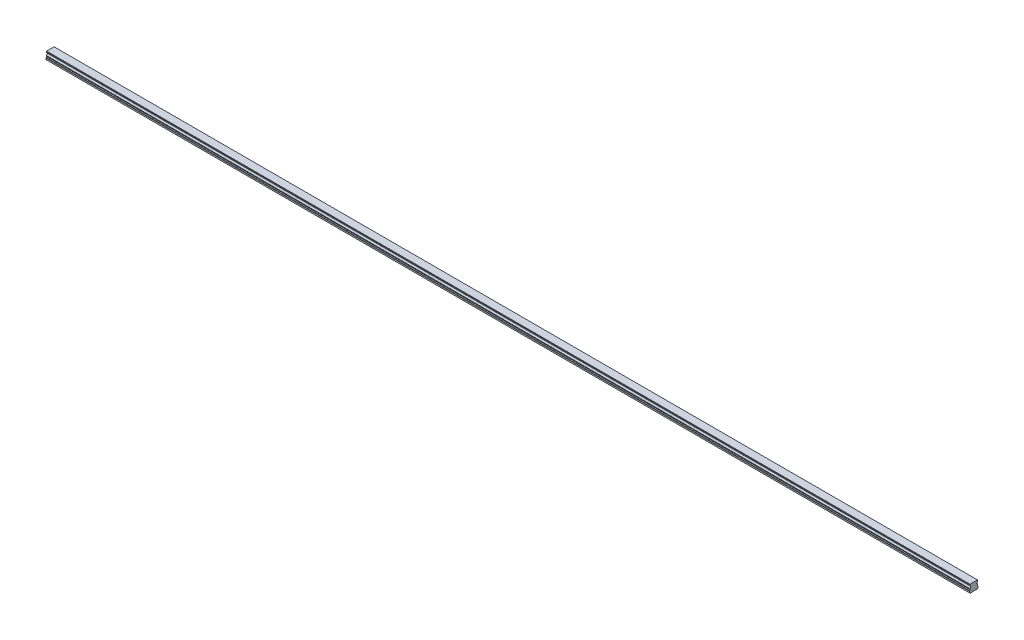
ISO-10303-21;
HEADER;
FILE_DESCRIPTION(('STEP AP214'),'2;1');
FILE_NAME('part.step','',(''),(''),'','','');
FILE_SCHEMA(('AUTOMOTIVE_DESIGN { 1 0 10303 214 1 1 1 1 }'));
ENDSEC;
DATA;
#1=APPLICATION_CONTEXT('core data for automotive mechanical design processes');
#2=APPLICATION_PROTOCOL_DEFINITION('international standard','automotive_design',2000,#1);
#3=PRODUCT_CONTEXT('',#1,'mechanical');
#4=PRODUCT('Part','Part','',(#3));
#5=PRODUCT_RELATED_PRODUCT_CATEGORY('part','',(#4));
#6=PRODUCT_DEFINITION_FORMATION('','',#4);
#7=PRODUCT_DEFINITION_CONTEXT('part definition',#1,'design');
#8=PRODUCT_DEFINITION('design','',#6,#7);
#9=PRODUCT_DEFINITION_SHAPE('','',#8);
#10=(LENGTH_UNIT() NAMED_UNIT(*) SI_UNIT(.MILLI.,.METRE.));
#11=(NAMED_UNIT(*) PLANE_ANGLE_UNIT() SI_UNIT($,.RADIAN.));
#12=(NAMED_UNIT(*) SI_UNIT($,.STERADIAN.) SOLID_ANGLE_UNIT());
#13=UNCERTAINTY_MEASURE_WITH_UNIT(LENGTH_MEASURE(1.E-05),#10,'distance_accuracy_value','');
#14=(GEOMETRIC_REPRESENTATION_CONTEXT(3) GLOBAL_UNCERTAINTY_ASSIGNED_CONTEXT((#13)) GLOBAL_UNIT_ASSIGNED_CONTEXT((#10,
#11,#12)) REPRESENTATION_CONTEXT('',''));
#15=CARTESIAN_POINT('',(0.,0.,0.));
#16=DIRECTION('',(0.,0.,1.));
#17=DIRECTION('',(1.,0.,0.));
#18=AXIS2_PLACEMENT_3D('',#15,#16,#17);
#19=CARTESIAN_POINT('',(1590.,0.399999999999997,0.));
#20=DIRECTION('',(0.,-1.,0.));
#21=DIRECTION('',(0.,0.,-1.));
#22=AXIS2_PLACEMENT_3D('',#19,#20,#21);
#23=CONICAL_SURFACE('',#22,2.8999999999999,0.785398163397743);
#24=CARTESIAN_POINT('',(1590.,0.799999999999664,0.));
#25=DIRECTION('',(0.,1.,0.));
#26=DIRECTION('',(0.,0.,1.));
#27=AXIS2_PLACEMENT_3D('',#24,#25,#26);
#28=CIRCLE('',#27,2.5);
#29=CARTESIAN_POINT('',(1590.,0.799999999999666,2.5));
#30=VERTEX_POINT('',#29);
#31=EDGE_CURVE('E11',#30,#30,#28,.F.);
#32=ORIENTED_EDGE('',*,*,#31,.F.);
#33=EDGE_LOOP('',(#32));
#34=FACE_BOUND('',#33,.T.);
#35=CARTESIAN_POINT('',(1590.,0.399999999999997,0.));
#36=DIRECTION('',(0.,1.,0.));
#37=DIRECTION('',(0.,0.,1.));
#38=AXIS2_PLACEMENT_3D('',#35,#36,#37);
#39=CIRCLE('',#38,2.89999999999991);
#40=CARTESIAN_POINT('',(1590.,0.399999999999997,2.89999999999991));
#41=VERTEX_POINT('',#40);
#42=EDGE_CURVE('E722',#41,#41,#39,.T.);
#43=ORIENTED_EDGE('',*,*,#42,.F.);
#44=EDGE_LOOP('',(#43));
#45=FACE_BOUND('',#44,.T.);
#46=ADVANCED_FACE('F39',(#34,#45),#23,.F.);
#47=CARTESIAN_POINT('',(1590.,7.,0.));
#48=DIRECTION('',(0.,-1.,0.));
#49=DIRECTION('',(0.,0.,-1.));
#50=AXIS2_PLACEMENT_3D('',#47,#48,#49);
#51=CYLINDRICAL_SURFACE('',#50,2.5);
#52=ORIENTED_EDGE('',*,*,#31,.T.);
#53=EDGE_LOOP('',(#52));
#54=FACE_BOUND('',#53,.T.);
#55=CARTESIAN_POINT('',(1590.,7.,0.));
#56=DIRECTION('',(0.,-1.,0.));
#57=DIRECTION('',(0.,0.,-1.));
#58=AXIS2_PLACEMENT_3D('',#55,#56,#57);
#59=CIRCLE('',#58,2.5);
#60=CARTESIAN_POINT('',(1590.,7.,-2.50000000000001));
#61=VERTEX_POINT('',#60);
#62=EDGE_CURVE('E49',#61,#61,#59,.T.);
#63=ORIENTED_EDGE('',*,*,#62,.F.);
#64=EDGE_LOOP('',(#63));
#65=FACE_BOUND('',#64,.T.);
#66=ADVANCED_FACE('F1043',(#54,#65),#51,.F.);
#67=CARTESIAN_POINT('',(1590.,7.,0.));
#68=DIRECTION('',(0.,-1.,0.));
#69=DIRECTION('',(0.,0.,-1.));
#70=AXIS2_PLACEMENT_3D('',#67,#68,#69);
#71=PLANE('',#70);
#72=CARTESIAN_POINT('',(1590.,7.,0.));
#73=DIRECTION('',(0.,-1.,0.));
#74=DIRECTION('',(0.,0.,-1.));
#75=AXIS2_PLACEMENT_3D('',#72,#73,#74);
#76=CIRCLE('',#75,2.1);
#77=CARTESIAN_POINT('',(1590.,7.,-2.1));
#78=VERTEX_POINT('',#77);
#79=EDGE_CURVE('E42',#78,#78,#76,.T.);
#80=ORIENTED_EDGE('',*,*,#79,.F.);
#81=EDGE_LOOP('',(#80));
#82=FACE_BOUND('',#81,.T.);
#83=ORIENTED_EDGE('',*,*,#62,.T.);
#84=EDGE_LOOP('',(#83));
#85=FACE_BOUND('',#84,.T.);
#86=ADVANCED_FACE('F1048',(#82,#85),#71,.T.);
#87=CARTESIAN_POINT('',(1530.,0.399999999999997,0.));
#88=DIRECTION('',(0.,-1.,0.));
#89=DIRECTION('',(0.,0.,-1.));
#90=AXIS2_PLACEMENT_3D('',#87,#88,#89);
#91=CONICAL_SURFACE('',#90,2.8999999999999,0.785398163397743);
#92=CARTESIAN_POINT('',(1530.,0.799999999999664,0.));
#93=DIRECTION('',(0.,1.,0.));
#94=DIRECTION('',(0.,0.,1.));
#95=AXIS2_PLACEMENT_3D('',#92,#93,#94);
#96=CIRCLE('',#95,2.5);
#97=CARTESIAN_POINT('',(1530.,0.799999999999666,2.5));
#98=VERTEX_POINT('',#97);
#99=EDGE_CURVE('E718',#98,#98,#96,.F.);
#100=ORIENTED_EDGE('',*,*,#99,.F.);
#101=EDGE_LOOP('',(#100));
#102=FACE_BOUND('',#101,.T.);
#103=CARTESIAN_POINT('',(1530.,0.399999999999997,0.));
#104=DIRECTION('',(0.,1.,0.));
#105=DIRECTION('',(0.,0.,1.));
#106=AXIS2_PLACEMENT_3D('',#103,#104,#105);
#107=CIRCLE('',#106,2.89999999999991);
#108=CARTESIAN_POINT('',(1530.,0.399999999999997,2.89999999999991));
#109=VERTEX_POINT('',#108);
#110=EDGE_CURVE('E710',#109,#109,#107,.T.);
#111=ORIENTED_EDGE('',*,*,#110,.F.);
#112=EDGE_LOOP('',(#111));
#113=FACE_BOUND('',#112,.T.);
#114=ADVANCED_FACE('F1411',(#102,#113),#91,.F.);
#115=CARTESIAN_POINT('',(1530.,7.,0.));
#116=DIRECTION('',(0.,-1.,0.));
#117=DIRECTION('',(0.,0.,-1.));
#118=AXIS2_PLACEMENT_3D('',#115,#116,#117);
#119=CYLINDRICAL_SURFACE('',#118,2.5);
#120=ORIENTED_EDGE('',*,*,#99,.T.);
#121=EDGE_LOOP('',(#120));
#122=FACE_BOUND('',#121,.T.);
#123=CARTESIAN_POINT('',(1530.,7.,0.));
#124=DIRECTION('',(0.,-1.,0.));
#125=DIRECTION('',(0.,0.,-1.));
#126=AXIS2_PLACEMENT_3D('',#123,#124,#125);
#127=CIRCLE('',#126,2.5);
#128=CARTESIAN_POINT('',(1530.,7.,-2.50000000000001));
#129=VERTEX_POINT('',#128);
#130=EDGE_CURVE('E714',#129,#129,#127,.T.);
#131=ORIENTED_EDGE('',*,*,#130,.F.);
#132=EDGE_LOOP('',(#131));
#133=FACE_BOUND('',#132,.T.);
#134=ADVANCED_FACE('F1407',(#122,#133),#119,.F.);
#135=CARTESIAN_POINT('',(1530.,7.,0.));
#136=DIRECTION('',(0.,-1.,0.));
#137=DIRECTION('',(0.,0.,-1.));
#138=AXIS2_PLACEMENT_3D('',#135,#136,#137);
#139=PLANE('',#138);
#140=CARTESIAN_POINT('',(1530.,7.,0.));
#141=DIRECTION('',(0.,-1.,0.));
#142=DIRECTION('',(0.,0.,-1.));
#143=AXIS2_PLACEMENT_3D('',#140,#141,#142);
#144=CIRCLE('',#143,2.1);
#145=CARTESIAN_POINT('',(1530.,7.,-2.1));
#146=VERTEX_POINT('',#145);
#147=EDGE_CURVE('E825',#146,#146,#144,.T.);
#148=ORIENTED_EDGE('',*,*,#147,.F.);
#149=EDGE_LOOP('',(#148));
#150=FACE_BOUND('',#149,.T.);
#151=ORIENTED_EDGE('',*,*,#130,.T.);
#152=EDGE_LOOP('',(#151));
#153=FACE_BOUND('',#152,.T.);
#154=ADVANCED_FACE('F1403',(#150,#153),#139,.T.);
#155=CARTESIAN_POINT('',(1470.,0.399999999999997,0.));
#156=DIRECTION('',(0.,-1.,0.));
#157=DIRECTION('',(0.,0.,-1.));
#158=AXIS2_PLACEMENT_3D('',#155,#156,#157);
#159=CONICAL_SURFACE('',#158,2.8999999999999,0.785398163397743);
#160=CARTESIAN_POINT('',(1470.,0.799999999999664,0.));
#161=DIRECTION('',(0.,1.,0.));
#162=DIRECTION('',(0.,0.,1.));
#163=AXIS2_PLACEMENT_3D('',#160,#161,#162);
#164=CIRCLE('',#163,2.5);
#165=CARTESIAN_POINT('',(1470.,0.799999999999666,2.5));
#166=VERTEX_POINT('',#165);
#167=EDGE_CURVE('E706',#166,#166,#164,.F.);
#168=ORIENTED_EDGE('',*,*,#167,.F.);
#169=EDGE_LOOP('',(#168));
#170=FACE_BOUND('',#169,.T.);
#171=CARTESIAN_POINT('',(1470.,0.399999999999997,0.));
#172=DIRECTION('',(0.,1.,0.));
#173=DIRECTION('',(0.,0.,1.));
#174=AXIS2_PLACEMENT_3D('',#171,#172,#173);
#175=CIRCLE('',#174,2.89999999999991);
#176=CARTESIAN_POINT('',(1470.,0.399999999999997,2.89999999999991));
#177=VERTEX_POINT('',#176);
#178=EDGE_CURVE('E698',#177,#177,#175,.T.);
#179=ORIENTED_EDGE('',*,*,#178,.F.);
#180=EDGE_LOOP('',(#179));
#181=FACE_BOUND('',#180,.T.);
#182=ADVANCED_FACE('F1399',(#170,#181),#159,.F.);
#183=CARTESIAN_POINT('',(1470.,7.,0.));
#184=DIRECTION('',(0.,-1.,0.));
#185=DIRECTION('',(0.,0.,-1.));
#186=AXIS2_PLACEMENT_3D('',#183,#184,#185);
#187=CYLINDRICAL_SURFACE('',#186,2.5);
#188=ORIENTED_EDGE('',*,*,#167,.T.);
#189=EDGE_LOOP('',(#188));
#190=FACE_BOUND('',#189,.T.);
#191=CARTESIAN_POINT('',(1470.,7.,0.));
#192=DIRECTION('',(0.,-1.,0.));
#193=DIRECTION('',(0.,0.,-1.));
#194=AXIS2_PLACEMENT_3D('',#191,#192,#193);
#195=CIRCLE('',#194,2.5);
#196=CARTESIAN_POINT('',(1470.,7.,-2.50000000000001));
#197=VERTEX_POINT('',#196);
#198=EDGE_CURVE('E702',#197,#197,#195,.T.);
#199=ORIENTED_EDGE('',*,*,#198,.F.);
#200=EDGE_LOOP('',(#199));
#201=FACE_BOUND('',#200,.T.);
#202=ADVANCED_FACE('F1395',(#190,#201),#187,.F.);
#203=CARTESIAN_POINT('',(1470.,7.,0.));
#204=DIRECTION('',(0.,-1.,0.));
#205=DIRECTION('',(0.,0.,-1.));
#206=AXIS2_PLACEMENT_3D('',#203,#204,#205);
#207=PLANE('',#206);
#208=CARTESIAN_POINT('',(1470.,7.,0.));
#209=DIRECTION('',(0.,-1.,0.));
#210=DIRECTION('',(0.,0.,-1.));
#211=AXIS2_PLACEMENT_3D('',#208,#209,#210);
#212=CIRCLE('',#211,2.1);
#213=CARTESIAN_POINT('',(1470.,7.,-2.1));
#214=VERTEX_POINT('',#213);
#215=EDGE_CURVE('E822',#214,#214,#212,.T.);
#216=ORIENTED_EDGE('',*,*,#215,.F.);
#217=EDGE_LOOP('',(#216));
#218=FACE_BOUND('',#217,.T.);
#219=ORIENTED_EDGE('',*,*,#198,.T.);
#220=EDGE_LOOP('',(#219));
#221=FACE_BOUND('',#220,.T.);
#222=ADVANCED_FACE('F1391',(#218,#221),#207,.T.);
#223=CARTESIAN_POINT('',(1410.,0.399999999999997,0.));
#224=DIRECTION('',(0.,-1.,0.));
#225=DIRECTION('',(0.,0.,-1.));
#226=AXIS2_PLACEMENT_3D('',#223,#224,#225);
#227=CONICAL_SURFACE('',#226,2.8999999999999,0.785398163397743);
#228=CARTESIAN_POINT('',(1410.,0.799999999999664,0.));
#229=DIRECTION('',(0.,1.,0.));
#230=DIRECTION('',(0.,0.,1.));
#231=AXIS2_PLACEMENT_3D('',#228,#229,#230);
#232=CIRCLE('',#231,2.5);
#233=CARTESIAN_POINT('',(1410.,0.799999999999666,2.5));
#234=VERTEX_POINT('',#233);
#235=EDGE_CURVE('E694',#234,#234,#232,.F.);
#236=ORIENTED_EDGE('',*,*,#235,.F.);
#237=EDGE_LOOP('',(#236));
#238=FACE_BOUND('',#237,.T.);
#239=CARTESIAN_POINT('',(1410.,0.399999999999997,0.));
#240=DIRECTION('',(0.,1.,0.));
#241=DIRECTION('',(0.,0.,1.));
#242=AXIS2_PLACEMENT_3D('',#239,#240,#241);
#243=CIRCLE('',#242,2.89999999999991);
#244=CARTESIAN_POINT('',(1410.,0.399999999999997,2.89999999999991));
#245=VERTEX_POINT('',#244);
#246=EDGE_CURVE('E686',#245,#245,#243,.T.);
#247=ORIENTED_EDGE('',*,*,#246,.F.);
#248=EDGE_LOOP('',(#247));
#249=FACE_BOUND('',#248,.T.);
#250=ADVANCED_FACE('F1387',(#238,#249),#227,.F.);
#251=CARTESIAN_POINT('',(1410.,7.,0.));
#252=DIRECTION('',(0.,-1.,0.));
#253=DIRECTION('',(0.,0.,-1.));
#254=AXIS2_PLACEMENT_3D('',#251,#252,#253);
#255=CYLINDRICAL_SURFACE('',#254,2.5);
#256=ORIENTED_EDGE('',*,*,#235,.T.);
#257=EDGE_LOOP('',(#256));
#258=FACE_BOUND('',#257,.T.);
#259=CARTESIAN_POINT('',(1410.,7.,0.));
#260=DIRECTION('',(0.,-1.,0.));
#261=DIRECTION('',(0.,0.,-1.));
#262=AXIS2_PLACEMENT_3D('',#259,#260,#261);
#263=CIRCLE('',#262,2.5);
#264=CARTESIAN_POINT('',(1410.,7.,-2.50000000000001));
#265=VERTEX_POINT('',#264);
#266=EDGE_CURVE('E690',#265,#265,#263,.T.);
#267=ORIENTED_EDGE('',*,*,#266,.F.);
#268=EDGE_LOOP('',(#267));
#269=FACE_BOUND('',#268,.T.);
#270=ADVANCED_FACE('F1383',(#258,#269),#255,.F.);
#271=CARTESIAN_POINT('',(1410.,7.,0.));
#272=DIRECTION('',(0.,-1.,0.));
#273=DIRECTION('',(0.,0.,-1.));
#274=AXIS2_PLACEMENT_3D('',#271,#272,#273);
#275=PLANE('',#274);
#276=CARTESIAN_POINT('',(1410.,7.,0.));
#277=DIRECTION('',(0.,-1.,0.));
#278=DIRECTION('',(0.,0.,-1.));
#279=AXIS2_PLACEMENT_3D('',#276,#277,#278);
#280=CIRCLE('',#279,2.1);
#281=CARTESIAN_POINT('',(1410.,7.,-2.1));
#282=VERTEX_POINT('',#281);
#283=EDGE_CURVE('E818',#282,#282,#280,.T.);
#284=ORIENTED_EDGE('',*,*,#283,.F.);
#285=EDGE_LOOP('',(#284));
#286=FACE_BOUND('',#285,.T.);
#287=ORIENTED_EDGE('',*,*,#266,.T.);
#288=EDGE_LOOP('',(#287));
#289=FACE_BOUND('',#288,.T.);
#290=ADVANCED_FACE('F1379',(#286,#289),#275,.T.);
#291=CARTESIAN_POINT('',(1350.,0.399999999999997,0.));
#292=DIRECTION('',(0.,-1.,0.));
#293=DIRECTION('',(0.,0.,-1.));
#294=AXIS2_PLACEMENT_3D('',#291,#292,#293);
#295=CONICAL_SURFACE('',#294,2.8999999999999,0.785398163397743);
#296=CARTESIAN_POINT('',(1350.,0.799999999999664,0.));
#297=DIRECTION('',(0.,1.,0.));
#298=DIRECTION('',(0.,0.,1.));
#299=AXIS2_PLACEMENT_3D('',#296,#297,#298);
#300=CIRCLE('',#299,2.5);
#301=CARTESIAN_POINT('',(1350.,0.799999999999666,2.5));
#302=VERTEX_POINT('',#301);
#303=EDGE_CURVE('E682',#302,#302,#300,.F.);
#304=ORIENTED_EDGE('',*,*,#303,.F.);
#305=EDGE_LOOP('',(#304));
#306=FACE_BOUND('',#305,.T.);
#307=CARTESIAN_POINT('',(1350.,0.399999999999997,0.));
#308=DIRECTION('',(0.,1.,0.));
#309=DIRECTION('',(0.,0.,1.));
#310=AXIS2_PLACEMENT_3D('',#307,#308,#309);
#311=CIRCLE('',#310,2.89999999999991);
#312=CARTESIAN_POINT('',(1350.,0.399999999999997,2.89999999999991));
#313=VERTEX_POINT('',#312);
#314=EDGE_CURVE('E674',#313,#313,#311,.T.);
#315=ORIENTED_EDGE('',*,*,#314,.F.);
#316=EDGE_LOOP('',(#315));
#317=FACE_BOUND('',#316,.T.);
#318=ADVANCED_FACE('F1375',(#306,#317),#295,.F.);
#319=CARTESIAN_POINT('',(1350.,7.,0.));
#320=DIRECTION('',(0.,-1.,0.));
#321=DIRECTION('',(0.,0.,-1.));
#322=AXIS2_PLACEMENT_3D('',#319,#320,#321);
#323=CYLINDRICAL_SURFACE('',#322,2.5);
#324=ORIENTED_EDGE('',*,*,#303,.T.);
#325=EDGE_LOOP('',(#324));
#326=FACE_BOUND('',#325,.T.);
#327=CARTESIAN_POINT('',(1350.,7.,0.));
#328=DIRECTION('',(0.,-1.,0.));
#329=DIRECTION('',(0.,0.,-1.));
#330=AXIS2_PLACEMENT_3D('',#327,#328,#329);
#331=CIRCLE('',#330,2.5);
#332=CARTESIAN_POINT('',(1350.,7.,-2.50000000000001));
#333=VERTEX_POINT('',#332);
#334=EDGE_CURVE('E678',#333,#333,#331,.T.);
#335=ORIENTED_EDGE('',*,*,#334,.F.);
#336=EDGE_LOOP('',(#335));
#337=FACE_BOUND('',#336,.T.);
#338=ADVANCED_FACE('F1371',(#326,#337),#323,.F.);
#339=CARTESIAN_POINT('',(1350.,7.,0.));
#340=DIRECTION('',(0.,-1.,0.));
#341=DIRECTION('',(0.,0.,-1.));
#342=AXIS2_PLACEMENT_3D('',#339,#340,#341);
#343=PLANE('',#342);
#344=CARTESIAN_POINT('',(1350.,7.,0.));
#345=DIRECTION('',(0.,-1.,0.));
#346=DIRECTION('',(0.,0.,-1.));
#347=AXIS2_PLACEMENT_3D('',#344,#345,#346);
#348=CIRCLE('',#347,2.1);
#349=CARTESIAN_POINT('',(1350.,7.,-2.1));
#350=VERTEX_POINT('',#349);
#351=EDGE_CURVE('E814',#350,#350,#348,.T.);
#352=ORIENTED_EDGE('',*,*,#351,.F.);
#353=EDGE_LOOP('',(#352));
#354=FACE_BOUND('',#353,.T.);
#355=ORIENTED_EDGE('',*,*,#334,.T.);
#356=EDGE_LOOP('',(#355));
#357=FACE_BOUND('',#356,.T.);
#358=ADVANCED_FACE('F1367',(#354,#357),#343,.T.);
#359=CARTESIAN_POINT('',(1290.,0.399999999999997,0.));
#360=DIRECTION('',(0.,-1.,0.));
#361=DIRECTION('',(0.,0.,-1.));
#362=AXIS2_PLACEMENT_3D('',#359,#360,#361);
#363=CONICAL_SURFACE('',#362,2.8999999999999,0.785398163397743);
#364=CARTESIAN_POINT('',(1290.,0.799999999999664,0.));
#365=DIRECTION('',(0.,1.,0.));
#366=DIRECTION('',(0.,0.,1.));
#367=AXIS2_PLACEMENT_3D('',#364,#365,#366);
#368=CIRCLE('',#367,2.5);
#369=CARTESIAN_POINT('',(1290.,0.799999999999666,2.5));
#370=VERTEX_POINT('',#369);
#371=EDGE_CURVE('E670',#370,#370,#368,.F.);
#372=ORIENTED_EDGE('',*,*,#371,.F.);
#373=EDGE_LOOP('',(#372));
#374=FACE_BOUND('',#373,.T.);
#375=CARTESIAN_POINT('',(1290.,0.399999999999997,0.));
#376=DIRECTION('',(0.,1.,0.));
#377=DIRECTION('',(0.,0.,1.));
#378=AXIS2_PLACEMENT_3D('',#375,#376,#377);
#379=CIRCLE('',#378,2.89999999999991);
#380=CARTESIAN_POINT('',(1290.,0.399999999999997,2.89999999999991));
#381=VERTEX_POINT('',#380);
#382=EDGE_CURVE('E662',#381,#381,#379,.T.);
#383=ORIENTED_EDGE('',*,*,#382,.F.);
#384=EDGE_LOOP('',(#383));
#385=FACE_BOUND('',#384,.T.);
#386=ADVANCED_FACE('F1363',(#374,#385),#363,.F.);
#387=CARTESIAN_POINT('',(1290.,7.,0.));
#388=DIRECTION('',(0.,-1.,0.));
#389=DIRECTION('',(0.,0.,-1.));
#390=AXIS2_PLACEMENT_3D('',#387,#388,#389);
#391=CYLINDRICAL_SURFACE('',#390,2.5);
#392=ORIENTED_EDGE('',*,*,#371,.T.);
#393=EDGE_LOOP('',(#392));
#394=FACE_BOUND('',#393,.T.);
#395=CARTESIAN_POINT('',(1290.,7.,0.));
#396=DIRECTION('',(0.,-1.,0.));
#397=DIRECTION('',(0.,0.,-1.));
#398=AXIS2_PLACEMENT_3D('',#395,#396,#397);
#399=CIRCLE('',#398,2.5);
#400=CARTESIAN_POINT('',(1290.,7.,-2.50000000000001));
#401=VERTEX_POINT('',#400);
#402=EDGE_CURVE('E666',#401,#401,#399,.T.);
#403=ORIENTED_EDGE('',*,*,#402,.F.);
#404=EDGE_LOOP('',(#403));
#405=FACE_BOUND('',#404,.T.);
#406=ADVANCED_FACE('F1359',(#394,#405),#391,.F.);
#407=CARTESIAN_POINT('',(1290.,7.,0.));
#408=DIRECTION('',(0.,-1.,0.));
#409=DIRECTION('',(0.,0.,-1.));
#410=AXIS2_PLACEMENT_3D('',#407,#408,#409);
#411=PLANE('',#410);
#412=CARTESIAN_POINT('',(1290.,7.,0.));
#413=DIRECTION('',(0.,-1.,0.));
#414=DIRECTION('',(0.,0.,-1.));
#415=AXIS2_PLACEMENT_3D('',#412,#413,#414);
#416=CIRCLE('',#415,2.1);
#417=CARTESIAN_POINT('',(1290.,7.,-2.1));
#418=VERTEX_POINT('',#417);
#419=EDGE_CURVE('E810',#418,#418,#416,.T.);
#420=ORIENTED_EDGE('',*,*,#419,.F.);
#421=EDGE_LOOP('',(#420));
#422=FACE_BOUND('',#421,.T.);
#423=ORIENTED_EDGE('',*,*,#402,.T.);
#424=EDGE_LOOP('',(#423));
#425=FACE_BOUND('',#424,.T.);
#426=ADVANCED_FACE('F1355',(#422,#425),#411,.T.);
#427=CARTESIAN_POINT('',(1230.,0.399999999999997,0.));
#428=DIRECTION('',(0.,-1.,0.));
#429=DIRECTION('',(0.,0.,-1.));
#430=AXIS2_PLACEMENT_3D('',#427,#428,#429);
#431=CONICAL_SURFACE('',#430,2.8999999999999,0.785398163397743);
#432=CARTESIAN_POINT('',(1230.,0.799999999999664,0.));
#433=DIRECTION('',(0.,1.,0.));
#434=DIRECTION('',(0.,0.,1.));
#435=AXIS2_PLACEMENT_3D('',#432,#433,#434);
#436=CIRCLE('',#435,2.5);
#437=CARTESIAN_POINT('',(1230.,0.799999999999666,2.5));
#438=VERTEX_POINT('',#437);
#439=EDGE_CURVE('E658',#438,#438,#436,.F.);
#440=ORIENTED_EDGE('',*,*,#439,.F.);
#441=EDGE_LOOP('',(#440));
#442=FACE_BOUND('',#441,.T.);
#443=CARTESIAN_POINT('',(1230.,0.399999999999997,0.));
#444=DIRECTION('',(0.,1.,0.));
#445=DIRECTION('',(0.,0.,1.));
#446=AXIS2_PLACEMENT_3D('',#443,#444,#445);
#447=CIRCLE('',#446,2.89999999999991);
#448=CARTESIAN_POINT('',(1230.,0.399999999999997,2.89999999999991));
#449=VERTEX_POINT('',#448);
#450=EDGE_CURVE('E650',#449,#449,#447,.T.);
#451=ORIENTED_EDGE('',*,*,#450,.F.);
#452=EDGE_LOOP('',(#451));
#453=FACE_BOUND('',#452,.T.);
#454=ADVANCED_FACE('F1351',(#442,#453),#431,.F.);
#455=CARTESIAN_POINT('',(1230.,7.,0.));
#456=DIRECTION('',(0.,-1.,0.));
#457=DIRECTION('',(0.,0.,-1.));
#458=AXIS2_PLACEMENT_3D('',#455,#456,#457);
#459=CYLINDRICAL_SURFACE('',#458,2.5);
#460=ORIENTED_EDGE('',*,*,#439,.T.);
#461=EDGE_LOOP('',(#460));
#462=FACE_BOUND('',#461,.T.);
#463=CARTESIAN_POINT('',(1230.,7.,0.));
#464=DIRECTION('',(0.,-1.,0.));
#465=DIRECTION('',(0.,0.,-1.));
#466=AXIS2_PLACEMENT_3D('',#463,#464,#465);
#467=CIRCLE('',#466,2.5);
#468=CARTESIAN_POINT('',(1230.,7.,-2.50000000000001));
#469=VERTEX_POINT('',#468);
#470=EDGE_CURVE('E654',#469,#469,#467,.T.);
#471=ORIENTED_EDGE('',*,*,#470,.F.);
#472=EDGE_LOOP('',(#471));
#473=FACE_BOUND('',#472,.T.);
#474=ADVANCED_FACE('F1347',(#462,#473),#459,.F.);
#475=CARTESIAN_POINT('',(1230.,7.,0.));
#476=DIRECTION('',(0.,-1.,0.));
#477=DIRECTION('',(0.,0.,-1.));
#478=AXIS2_PLACEMENT_3D('',#475,#476,#477);
#479=PLANE('',#478);
#480=CARTESIAN_POINT('',(1230.,7.,0.));
#481=DIRECTION('',(0.,-1.,0.));
#482=DIRECTION('',(0.,0.,-1.));
#483=AXIS2_PLACEMENT_3D('',#480,#481,#482);
#484=CIRCLE('',#483,2.1);
#485=CARTESIAN_POINT('',(1230.,7.,-2.1));
#486=VERTEX_POINT('',#485);
#487=EDGE_CURVE('E806',#486,#486,#484,.T.);
#488=ORIENTED_EDGE('',*,*,#487,.F.);
#489=EDGE_LOOP('',(#488));
#490=FACE_BOUND('',#489,.T.);
#491=ORIENTED_EDGE('',*,*,#470,.T.);
#492=EDGE_LOOP('',(#491));
#493=FACE_BOUND('',#492,.T.);
#494=ADVANCED_FACE('F1343',(#490,#493),#479,.T.);
#495=CARTESIAN_POINT('',(1170.,0.399999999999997,0.));
#496=DIRECTION('',(0.,-1.,0.));
#497=DIRECTION('',(0.,0.,-1.));
#498=AXIS2_PLACEMENT_3D('',#495,#496,#497);
#499=CONICAL_SURFACE('',#498,2.8999999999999,0.785398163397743);
#500=CARTESIAN_POINT('',(1170.,0.799999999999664,0.));
#501=DIRECTION('',(0.,1.,0.));
#502=DIRECTION('',(0.,0.,1.));
#503=AXIS2_PLACEMENT_3D('',#500,#501,#502);
#504=CIRCLE('',#503,2.5);
#505=CARTESIAN_POINT('',(1170.,0.799999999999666,2.5));
#506=VERTEX_POINT('',#505);
#507=EDGE_CURVE('E646',#506,#506,#504,.F.);
#508=ORIENTED_EDGE('',*,*,#507,.F.);
#509=EDGE_LOOP('',(#508));
#510=FACE_BOUND('',#509,.T.);
#511=CARTESIAN_POINT('',(1170.,0.399999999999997,0.));
#512=DIRECTION('',(0.,1.,0.));
#513=DIRECTION('',(0.,0.,1.));
#514=AXIS2_PLACEMENT_3D('',#511,#512,#513);
#515=CIRCLE('',#514,2.89999999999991);
#516=CARTESIAN_POINT('',(1170.,0.399999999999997,2.89999999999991));
#517=VERTEX_POINT('',#516);
#518=EDGE_CURVE('E638',#517,#517,#515,.T.);
#519=ORIENTED_EDGE('',*,*,#518,.F.);
#520=EDGE_LOOP('',(#519));
#521=FACE_BOUND('',#520,.T.);
#522=ADVANCED_FACE('F1339',(#510,#521),#499,.F.);
#523=CARTESIAN_POINT('',(1170.,7.,0.));
#524=DIRECTION('',(0.,-1.,0.));
#525=DIRECTION('',(0.,0.,-1.));
#526=AXIS2_PLACEMENT_3D('',#523,#524,#525);
#527=CYLINDRICAL_SURFACE('',#526,2.5);
#528=ORIENTED_EDGE('',*,*,#507,.T.);
#529=EDGE_LOOP('',(#528));
#530=FACE_BOUND('',#529,.T.);
#531=CARTESIAN_POINT('',(1170.,7.,0.));
#532=DIRECTION('',(0.,-1.,0.));
#533=DIRECTION('',(0.,0.,-1.));
#534=AXIS2_PLACEMENT_3D('',#531,#532,#533);
#535=CIRCLE('',#534,2.5);
#536=CARTESIAN_POINT('',(1170.,7.,-2.50000000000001));
#537=VERTEX_POINT('',#536);
#538=EDGE_CURVE('E642',#537,#537,#535,.T.);
#539=ORIENTED_EDGE('',*,*,#538,.F.);
#540=EDGE_LOOP('',(#539));
#541=FACE_BOUND('',#540,.T.);
#542=ADVANCED_FACE('F1335',(#530,#541),#527,.F.);
#543=CARTESIAN_POINT('',(1170.,7.,0.));
#544=DIRECTION('',(0.,-1.,0.));
#545=DIRECTION('',(0.,0.,-1.));
#546=AXIS2_PLACEMENT_3D('',#543,#544,#545);
#547=PLANE('',#546);
#548=CARTESIAN_POINT('',(1170.,7.,0.));
#549=DIRECTION('',(0.,-1.,0.));
#550=DIRECTION('',(0.,0.,-1.));
#551=AXIS2_PLACEMENT_3D('',#548,#549,#550);
#552=CIRCLE('',#551,2.1);
#553=CARTESIAN_POINT('',(1170.,7.,-2.1));
#554=VERTEX_POINT('',#553);
#555=EDGE_CURVE('E802',#554,#554,#552,.T.);
#556=ORIENTED_EDGE('',*,*,#555,.F.);
#557=EDGE_LOOP('',(#556));
#558=FACE_BOUND('',#557,.T.);
#559=ORIENTED_EDGE('',*,*,#538,.T.);
#560=EDGE_LOOP('',(#559));
#561=FACE_BOUND('',#560,.T.);
#562=ADVANCED_FACE('F1331',(#558,#561),#547,.T.);
#563=CARTESIAN_POINT('',(1110.,0.399999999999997,0.));
#564=DIRECTION('',(0.,-1.,0.));
#565=DIRECTION('',(0.,0.,-1.));
#566=AXIS2_PLACEMENT_3D('',#563,#564,#565);
#567=CONICAL_SURFACE('',#566,2.8999999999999,0.785398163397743);
#568=CARTESIAN_POINT('',(1110.,0.799999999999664,0.));
#569=DIRECTION('',(0.,1.,0.));
#570=DIRECTION('',(0.,0.,1.));
#571=AXIS2_PLACEMENT_3D('',#568,#569,#570);
#572=CIRCLE('',#571,2.5);
#573=CARTESIAN_POINT('',(1110.,0.799999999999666,2.5));
#574=VERTEX_POINT('',#573);
#575=EDGE_CURVE('E634',#574,#574,#572,.F.);
#576=ORIENTED_EDGE('',*,*,#575,.F.);
#577=EDGE_LOOP('',(#576));
#578=FACE_BOUND('',#577,.T.);
#579=CARTESIAN_POINT('',(1110.,0.399999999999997,0.));
#580=DIRECTION('',(0.,1.,0.));
#581=DIRECTION('',(0.,0.,1.));
#582=AXIS2_PLACEMENT_3D('',#579,#580,#581);
#583=CIRCLE('',#582,2.89999999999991);
#584=CARTESIAN_POINT('',(1110.,0.399999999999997,2.89999999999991));
#585=VERTEX_POINT('',#584);
#586=EDGE_CURVE('E626',#585,#585,#583,.T.);
#587=ORIENTED_EDGE('',*,*,#586,.F.);
#588=EDGE_LOOP('',(#587));
#589=FACE_BOUND('',#588,.T.);
#590=ADVANCED_FACE('F1327',(#578,#589),#567,.F.);
#591=CARTESIAN_POINT('',(1110.,7.,0.));
#592=DIRECTION('',(0.,-1.,0.));
#593=DIRECTION('',(0.,0.,-1.));
#594=AXIS2_PLACEMENT_3D('',#591,#592,#593);
#595=CYLINDRICAL_SURFACE('',#594,2.5);
#596=ORIENTED_EDGE('',*,*,#575,.T.);
#597=EDGE_LOOP('',(#596));
#598=FACE_BOUND('',#597,.T.);
#599=CARTESIAN_POINT('',(1110.,7.,0.));
#600=DIRECTION('',(0.,-1.,0.));
#601=DIRECTION('',(0.,0.,-1.));
#602=AXIS2_PLACEMENT_3D('',#599,#600,#601);
#603=CIRCLE('',#602,2.5);
#604=CARTESIAN_POINT('',(1110.,7.,-2.50000000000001));
#605=VERTEX_POINT('',#604);
#606=EDGE_CURVE('E630',#605,#605,#603,.T.);
#607=ORIENTED_EDGE('',*,*,#606,.F.);
#608=EDGE_LOOP('',(#607));
#609=FACE_BOUND('',#608,.T.);
#610=ADVANCED_FACE('F1323',(#598,#609),#595,.F.);
#611=CARTESIAN_POINT('',(1110.,7.,0.));
#612=DIRECTION('',(0.,-1.,0.));
#613=DIRECTION('',(0.,0.,-1.));
#614=AXIS2_PLACEMENT_3D('',#611,#612,#613);
#615=PLANE('',#614);
#616=CARTESIAN_POINT('',(1110.,7.,0.));
#617=DIRECTION('',(0.,-1.,0.));
#618=DIRECTION('',(0.,0.,-1.));
#619=AXIS2_PLACEMENT_3D('',#616,#617,#618);
#620=CIRCLE('',#619,2.1);
#621=CARTESIAN_POINT('',(1110.,7.,-2.1));
#622=VERTEX_POINT('',#621);
#623=EDGE_CURVE('E798',#622,#622,#620,.T.);
#624=ORIENTED_EDGE('',*,*,#623,.F.);
#625=EDGE_LOOP('',(#624));
#626=FACE_BOUND('',#625,.T.);
#627=ORIENTED_EDGE('',*,*,#606,.T.);
#628=EDGE_LOOP('',(#627));
#629=FACE_BOUND('',#628,.T.);
#630=ADVANCED_FACE('F1319',(#626,#629),#615,.T.);
#631=CARTESIAN_POINT('',(1050.,0.399999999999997,0.));
#632=DIRECTION('',(0.,-1.,0.));
#633=DIRECTION('',(0.,0.,-1.));
#634=AXIS2_PLACEMENT_3D('',#631,#632,#633);
#635=CONICAL_SURFACE('',#634,2.8999999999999,0.785398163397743);
#636=CARTESIAN_POINT('',(1050.,0.799999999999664,0.));
#637=DIRECTION('',(0.,1.,0.));
#638=DIRECTION('',(0.,0.,1.));
#639=AXIS2_PLACEMENT_3D('',#636,#637,#638);
#640=CIRCLE('',#639,2.5);
#641=CARTESIAN_POINT('',(1050.,0.799999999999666,2.5));
#642=VERTEX_POINT('',#641);
#643=EDGE_CURVE('E622',#642,#642,#640,.F.);
#644=ORIENTED_EDGE('',*,*,#643,.F.);
#645=EDGE_LOOP('',(#644));
#646=FACE_BOUND('',#645,.T.);
#647=CARTESIAN_POINT('',(1050.,0.399999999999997,0.));
#648=DIRECTION('',(0.,1.,0.));
#649=DIRECTION('',(0.,0.,1.));
#650=AXIS2_PLACEMENT_3D('',#647,#648,#649);
#651=CIRCLE('',#650,2.89999999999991);
#652=CARTESIAN_POINT('',(1050.,0.399999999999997,2.89999999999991));
#653=VERTEX_POINT('',#652);
#654=EDGE_CURVE('E614',#653,#653,#651,.T.);
#655=ORIENTED_EDGE('',*,*,#654,.F.);
#656=EDGE_LOOP('',(#655));
#657=FACE_BOUND('',#656,.T.);
#658=ADVANCED_FACE('F1315',(#646,#657),#635,.F.);
#659=CARTESIAN_POINT('',(1050.,7.,0.));
#660=DIRECTION('',(0.,-1.,0.));
#661=DIRECTION('',(0.,0.,-1.));
#662=AXIS2_PLACEMENT_3D('',#659,#660,#661);
#663=CYLINDRICAL_SURFACE('',#662,2.5);
#664=ORIENTED_EDGE('',*,*,#643,.T.);
#665=EDGE_LOOP('',(#664));
#666=FACE_BOUND('',#665,.T.);
#667=CARTESIAN_POINT('',(1050.,7.,0.));
#668=DIRECTION('',(0.,-1.,0.));
#669=DIRECTION('',(0.,0.,-1.));
#670=AXIS2_PLACEMENT_3D('',#667,#668,#669);
#671=CIRCLE('',#670,2.5);
#672=CARTESIAN_POINT('',(1050.,7.,-2.50000000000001));
#673=VERTEX_POINT('',#672);
#674=EDGE_CURVE('E618',#673,#673,#671,.T.);
#675=ORIENTED_EDGE('',*,*,#674,.F.);
#676=EDGE_LOOP('',(#675));
#677=FACE_BOUND('',#676,.T.);
#678=ADVANCED_FACE('F1311',(#666,#677),#663,.F.);
#679=CARTESIAN_POINT('',(1050.,7.,0.));
#680=DIRECTION('',(0.,-1.,0.));
#681=DIRECTION('',(0.,0.,-1.));
#682=AXIS2_PLACEMENT_3D('',#679,#680,#681);
#683=PLANE('',#682);
#684=CARTESIAN_POINT('',(1050.,7.,0.));
#685=DIRECTION('',(0.,-1.,0.));
#686=DIRECTION('',(0.,0.,-1.));
#687=AXIS2_PLACEMENT_3D('',#684,#685,#686);
#688=CIRCLE('',#687,2.1);
#689=CARTESIAN_POINT('',(1050.,7.,-2.1));
#690=VERTEX_POINT('',#689);
#691=EDGE_CURVE('E794',#690,#690,#688,.T.);
#692=ORIENTED_EDGE('',*,*,#691,.F.);
#693=EDGE_LOOP('',(#692));
#694=FACE_BOUND('',#693,.T.);
#695=ORIENTED_EDGE('',*,*,#674,.T.);
#696=EDGE_LOOP('',(#695));
#697=FACE_BOUND('',#696,.T.);
#698=ADVANCED_FACE('F1307',(#694,#697),#683,.T.);
#699=CARTESIAN_POINT('',(990.,0.399999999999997,0.));
#700=DIRECTION('',(0.,-1.,0.));
#701=DIRECTION('',(0.,0.,-1.));
#702=AXIS2_PLACEMENT_3D('',#699,#700,#701);
#703=CONICAL_SURFACE('',#702,2.8999999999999,0.785398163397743);
#704=CARTESIAN_POINT('',(990.,0.799999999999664,0.));
#705=DIRECTION('',(0.,1.,0.));
#706=DIRECTION('',(0.,0.,1.));
#707=AXIS2_PLACEMENT_3D('',#704,#705,#706);
#708=CIRCLE('',#707,2.5);
#709=CARTESIAN_POINT('',(990.,0.799999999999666,2.5));
#710=VERTEX_POINT('',#709);
#711=EDGE_CURVE('E610',#710,#710,#708,.F.);
#712=ORIENTED_EDGE('',*,*,#711,.F.);
#713=EDGE_LOOP('',(#712));
#714=FACE_BOUND('',#713,.T.);
#715=CARTESIAN_POINT('',(990.,0.399999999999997,0.));
#716=DIRECTION('',(0.,1.,0.));
#717=DIRECTION('',(0.,0.,1.));
#718=AXIS2_PLACEMENT_3D('',#715,#716,#717);
#719=CIRCLE('',#718,2.89999999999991);
#720=CARTESIAN_POINT('',(990.,0.399999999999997,2.89999999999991));
#721=VERTEX_POINT('',#720);
#722=EDGE_CURVE('E602',#721,#721,#719,.T.);
#723=ORIENTED_EDGE('',*,*,#722,.F.);
#724=EDGE_LOOP('',(#723));
#725=FACE_BOUND('',#724,.T.);
#726=ADVANCED_FACE('F1303',(#714,#725),#703,.F.);
#727=CARTESIAN_POINT('',(990.,7.,0.));
#728=DIRECTION('',(0.,-1.,0.));
#729=DIRECTION('',(0.,0.,-1.));
#730=AXIS2_PLACEMENT_3D('',#727,#728,#729);
#731=CYLINDRICAL_SURFACE('',#730,2.5);
#732=ORIENTED_EDGE('',*,*,#711,.T.);
#733=EDGE_LOOP('',(#732));
#734=FACE_BOUND('',#733,.T.);
#735=CARTESIAN_POINT('',(990.,7.,0.));
#736=DIRECTION('',(0.,-1.,0.));
#737=DIRECTION('',(0.,0.,-1.));
#738=AXIS2_PLACEMENT_3D('',#735,#736,#737);
#739=CIRCLE('',#738,2.5);
#740=CARTESIAN_POINT('',(990.,7.,-2.50000000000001));
#741=VERTEX_POINT('',#740);
#742=EDGE_CURVE('E606',#741,#741,#739,.T.);
#743=ORIENTED_EDGE('',*,*,#742,.F.);
#744=EDGE_LOOP('',(#743));
#745=FACE_BOUND('',#744,.T.);
#746=ADVANCED_FACE('F1299',(#734,#745),#731,.F.);
#747=CARTESIAN_POINT('',(990.,7.,0.));
#748=DIRECTION('',(0.,-1.,0.));
#749=DIRECTION('',(0.,0.,-1.));
#750=AXIS2_PLACEMENT_3D('',#747,#748,#749);
#751=PLANE('',#750);
#752=CARTESIAN_POINT('',(990.,7.,0.));
#753=DIRECTION('',(0.,-1.,0.));
#754=DIRECTION('',(0.,0.,-1.));
#755=AXIS2_PLACEMENT_3D('',#752,#753,#754);
#756=CIRCLE('',#755,2.1);
#757=CARTESIAN_POINT('',(990.,7.,-2.1));
#758=VERTEX_POINT('',#757);
#759=EDGE_CURVE('E790',#758,#758,#756,.T.);
#760=ORIENTED_EDGE('',*,*,#759,.F.);
#761=EDGE_LOOP('',(#760));
#762=FACE_BOUND('',#761,.T.);
#763=ORIENTED_EDGE('',*,*,#742,.T.);
#764=EDGE_LOOP('',(#763));
#765=FACE_BOUND('',#764,.T.);
#766=ADVANCED_FACE('F1295',(#762,#765),#751,.T.);
#767=CARTESIAN_POINT('',(930.,0.399999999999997,0.));
#768=DIRECTION('',(0.,-1.,0.));
#769=DIRECTION('',(0.,0.,-1.));
#770=AXIS2_PLACEMENT_3D('',#767,#768,#769);
#771=CONICAL_SURFACE('',#770,2.8999999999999,0.785398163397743);
#772=CARTESIAN_POINT('',(930.,0.799999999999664,0.));
#773=DIRECTION('',(0.,1.,0.));
#774=DIRECTION('',(0.,0.,1.));
#775=AXIS2_PLACEMENT_3D('',#772,#773,#774);
#776=CIRCLE('',#775,2.5);
#777=CARTESIAN_POINT('',(930.,0.799999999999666,2.5));
#778=VERTEX_POINT('',#777);
#779=EDGE_CURVE('E598',#778,#778,#776,.F.);
#780=ORIENTED_EDGE('',*,*,#779,.F.);
#781=EDGE_LOOP('',(#780));
#782=FACE_BOUND('',#781,.T.);
#783=CARTESIAN_POINT('',(930.,0.399999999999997,0.));
#784=DIRECTION('',(0.,1.,0.));
#785=DIRECTION('',(0.,0.,1.));
#786=AXIS2_PLACEMENT_3D('',#783,#784,#785);
#787=CIRCLE('',#786,2.89999999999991);
#788=CARTESIAN_POINT('',(930.,0.399999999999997,2.89999999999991));
#789=VERTEX_POINT('',#788);
#790=EDGE_CURVE('E590',#789,#789,#787,.T.);
#791=ORIENTED_EDGE('',*,*,#790,.F.);
#792=EDGE_LOOP('',(#791));
#793=FACE_BOUND('',#792,.T.);
#794=ADVANCED_FACE('F1291',(#782,#793),#771,.F.);
#795=CARTESIAN_POINT('',(930.,7.,0.));
#796=DIRECTION('',(0.,-1.,0.));
#797=DIRECTION('',(0.,0.,-1.));
#798=AXIS2_PLACEMENT_3D('',#795,#796,#797);
#799=CYLINDRICAL_SURFACE('',#798,2.5);
#800=ORIENTED_EDGE('',*,*,#779,.T.);
#801=EDGE_LOOP('',(#800));
#802=FACE_BOUND('',#801,.T.);
#803=CARTESIAN_POINT('',(930.,7.,0.));
#804=DIRECTION('',(0.,-1.,0.));
#805=DIRECTION('',(0.,0.,-1.));
#806=AXIS2_PLACEMENT_3D('',#803,#804,#805);
#807=CIRCLE('',#806,2.5);
#808=CARTESIAN_POINT('',(930.,7.,-2.50000000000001));
#809=VERTEX_POINT('',#808);
#810=EDGE_CURVE('E594',#809,#809,#807,.T.);
#811=ORIENTED_EDGE('',*,*,#810,.F.);
#812=EDGE_LOOP('',(#811));
#813=FACE_BOUND('',#812,.T.);
#814=ADVANCED_FACE('F1287',(#802,#813),#799,.F.);
#815=CARTESIAN_POINT('',(930.,7.,0.));
#816=DIRECTION('',(0.,-1.,0.));
#817=DIRECTION('',(0.,0.,-1.));
#818=AXIS2_PLACEMENT_3D('',#815,#816,#817);
#819=PLANE('',#818);
#820=CARTESIAN_POINT('',(930.,7.,0.));
#821=DIRECTION('',(0.,-1.,0.));
#822=DIRECTION('',(0.,0.,-1.));
#823=AXIS2_PLACEMENT_3D('',#820,#821,#822);
#824=CIRCLE('',#823,2.1);
#825=CARTESIAN_POINT('',(930.,7.,-2.1));
#826=VERTEX_POINT('',#825);
#827=EDGE_CURVE('E786',#826,#826,#824,.T.);
#828=ORIENTED_EDGE('',*,*,#827,.F.);
#829=EDGE_LOOP('',(#828));
#830=FACE_BOUND('',#829,.T.);
#831=ORIENTED_EDGE('',*,*,#810,.T.);
#832=EDGE_LOOP('',(#831));
#833=FACE_BOUND('',#832,.T.);
#834=ADVANCED_FACE('F1283',(#830,#833),#819,.T.);
#835=CARTESIAN_POINT('',(870.,0.399999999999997,0.));
#836=DIRECTION('',(0.,-1.,0.));
#837=DIRECTION('',(0.,0.,-1.));
#838=AXIS2_PLACEMENT_3D('',#835,#836,#837);
#839=CONICAL_SURFACE('',#838,2.8999999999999,0.785398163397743);
#840=CARTESIAN_POINT('',(870.,0.799999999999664,0.));
#841=DIRECTION('',(0.,1.,0.));
#842=DIRECTION('',(0.,0.,1.));
#843=AXIS2_PLACEMENT_3D('',#840,#841,#842);
#844=CIRCLE('',#843,2.5);
#845=CARTESIAN_POINT('',(870.,0.799999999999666,2.5));
#846=VERTEX_POINT('',#845);
#847=EDGE_CURVE('E586',#846,#846,#844,.F.);
#848=ORIENTED_EDGE('',*,*,#847,.F.);
#849=EDGE_LOOP('',(#848));
#850=FACE_BOUND('',#849,.T.);
#851=CARTESIAN_POINT('',(870.,0.399999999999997,0.));
#852=DIRECTION('',(0.,1.,0.));
#853=DIRECTION('',(0.,0.,1.));
#854=AXIS2_PLACEMENT_3D('',#851,#852,#853);
#855=CIRCLE('',#854,2.89999999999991);
#856=CARTESIAN_POINT('',(870.,0.399999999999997,2.89999999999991));
#857=VERTEX_POINT('',#856);
#858=EDGE_CURVE('E578',#857,#857,#855,.T.);
#859=ORIENTED_EDGE('',*,*,#858,.F.);
#860=EDGE_LOOP('',(#859));
#861=FACE_BOUND('',#860,.T.);
#862=ADVANCED_FACE('F1279',(#850,#861),#839,.F.);
#863=CARTESIAN_POINT('',(870.,7.,0.));
#864=DIRECTION('',(0.,-1.,0.));
#865=DIRECTION('',(0.,0.,-1.));
#866=AXIS2_PLACEMENT_3D('',#863,#864,#865);
#867=CYLINDRICAL_SURFACE('',#866,2.5);
#868=ORIENTED_EDGE('',*,*,#847,.T.);
#869=EDGE_LOOP('',(#868));
#870=FACE_BOUND('',#869,.T.);
#871=CARTESIAN_POINT('',(870.,7.,0.));
#872=DIRECTION('',(0.,-1.,0.));
#873=DIRECTION('',(0.,0.,-1.));
#874=AXIS2_PLACEMENT_3D('',#871,#872,#873);
#875=CIRCLE('',#874,2.5);
#876=CARTESIAN_POINT('',(870.,7.,-2.50000000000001));
#877=VERTEX_POINT('',#876);
#878=EDGE_CURVE('E582',#877,#877,#875,.T.);
#879=ORIENTED_EDGE('',*,*,#878,.F.);
#880=EDGE_LOOP('',(#879));
#881=FACE_BOUND('',#880,.T.);
#882=ADVANCED_FACE('F1275',(#870,#881),#867,.F.);
#883=CARTESIAN_POINT('',(870.,7.,0.));
#884=DIRECTION('',(0.,-1.,0.));
#885=DIRECTION('',(0.,0.,-1.));
#886=AXIS2_PLACEMENT_3D('',#883,#884,#885);
#887=PLANE('',#886);
#888=CARTESIAN_POINT('',(870.,7.,0.));
#889=DIRECTION('',(0.,-1.,0.));
#890=DIRECTION('',(0.,0.,-1.));
#891=AXIS2_PLACEMENT_3D('',#888,#889,#890);
#892=CIRCLE('',#891,2.1);
#893=CARTESIAN_POINT('',(870.,7.,-2.1));
#894=VERTEX_POINT('',#893);
#895=EDGE_CURVE('E782',#894,#894,#892,.T.);
#896=ORIENTED_EDGE('',*,*,#895,.F.);
#897=EDGE_LOOP('',(#896));
#898=FACE_BOUND('',#897,.T.);
#899=ORIENTED_EDGE('',*,*,#878,.T.);
#900=EDGE_LOOP('',(#899));
#901=FACE_BOUND('',#900,.T.);
#902=ADVANCED_FACE('F1271',(#898,#901),#887,.T.);
#903=CARTESIAN_POINT('',(810.,0.399999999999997,0.));
#904=DIRECTION('',(0.,-1.,0.));
#905=DIRECTION('',(0.,0.,-1.));
#906=AXIS2_PLACEMENT_3D('',#903,#904,#905);
#907=CONICAL_SURFACE('',#906,2.8999999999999,0.785398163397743);
#908=CARTESIAN_POINT('',(810.,0.799999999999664,0.));
#909=DIRECTION('',(0.,1.,0.));
#910=DIRECTION('',(0.,0.,1.));
#911=AXIS2_PLACEMENT_3D('',#908,#909,#910);
#912=CIRCLE('',#911,2.5);
#913=CARTESIAN_POINT('',(810.,0.799999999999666,2.5));
#914=VERTEX_POINT('',#913);
#915=EDGE_CURVE('E574',#914,#914,#912,.F.);
#916=ORIENTED_EDGE('',*,*,#915,.F.);
#917=EDGE_LOOP('',(#916));
#918=FACE_BOUND('',#917,.T.);
#919=CARTESIAN_POINT('',(810.,0.399999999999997,0.));
#920=DIRECTION('',(0.,1.,0.));
#921=DIRECTION('',(0.,0.,1.));
#922=AXIS2_PLACEMENT_3D('',#919,#920,#921);
#923=CIRCLE('',#922,2.89999999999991);
#924=CARTESIAN_POINT('',(810.,0.399999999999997,2.89999999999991));
#925=VERTEX_POINT('',#924);
#926=EDGE_CURVE('E566',#925,#925,#923,.T.);
#927=ORIENTED_EDGE('',*,*,#926,.F.);
#928=EDGE_LOOP('',(#927));
#929=FACE_BOUND('',#928,.T.);
#930=ADVANCED_FACE('F1267',(#918,#929),#907,.F.);
#931=CARTESIAN_POINT('',(810.,7.,0.));
#932=DIRECTION('',(0.,-1.,0.));
#933=DIRECTION('',(0.,0.,-1.));
#934=AXIS2_PLACEMENT_3D('',#931,#932,#933);
#935=CYLINDRICAL_SURFACE('',#934,2.5);
#936=ORIENTED_EDGE('',*,*,#915,.T.);
#937=EDGE_LOOP('',(#936));
#938=FACE_BOUND('',#937,.T.);
#939=CARTESIAN_POINT('',(810.,7.,0.));
#940=DIRECTION('',(0.,-1.,0.));
#941=DIRECTION('',(0.,0.,-1.));
#942=AXIS2_PLACEMENT_3D('',#939,#940,#941);
#943=CIRCLE('',#942,2.5);
#944=CARTESIAN_POINT('',(810.,7.,-2.50000000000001));
#945=VERTEX_POINT('',#944);
#946=EDGE_CURVE('E570',#945,#945,#943,.T.);
#947=ORIENTED_EDGE('',*,*,#946,.F.);
#948=EDGE_LOOP('',(#947));
#949=FACE_BOUND('',#948,.T.);
#950=ADVANCED_FACE('F1263',(#938,#949),#935,.F.);
#951=CARTESIAN_POINT('',(810.,7.,0.));
#952=DIRECTION('',(0.,-1.,0.));
#953=DIRECTION('',(0.,0.,-1.));
#954=AXIS2_PLACEMENT_3D('',#951,#952,#953);
#955=PLANE('',#954);
#956=CARTESIAN_POINT('',(810.,7.,0.));
#957=DIRECTION('',(0.,-1.,0.));
#958=DIRECTION('',(0.,0.,-1.));
#959=AXIS2_PLACEMENT_3D('',#956,#957,#958);
#960=CIRCLE('',#959,2.1);
#961=CARTESIAN_POINT('',(810.,7.,-2.1));
#962=VERTEX_POINT('',#961);
#963=EDGE_CURVE('E778',#962,#962,#960,.T.);
#964=ORIENTED_EDGE('',*,*,#963,.F.);
#965=EDGE_LOOP('',(#964));
#966=FACE_BOUND('',#965,.T.);
#967=ORIENTED_EDGE('',*,*,#946,.T.);
#968=EDGE_LOOP('',(#967));
#969=FACE_BOUND('',#968,.T.);
#970=ADVANCED_FACE('F1259',(#966,#969),#955,.T.);
#971=CARTESIAN_POINT('',(750.,0.399999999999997,0.));
#972=DIRECTION('',(0.,-1.,0.));
#973=DIRECTION('',(0.,0.,-1.));
#974=AXIS2_PLACEMENT_3D('',#971,#972,#973);
#975=CONICAL_SURFACE('',#974,2.8999999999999,0.785398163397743);
#976=CARTESIAN_POINT('',(750.,0.799999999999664,0.));
#977=DIRECTION('',(0.,1.,0.));
#978=DIRECTION('',(0.,0.,1.));
#979=AXIS2_PLACEMENT_3D('',#976,#977,#978);
#980=CIRCLE('',#979,2.5);
#981=CARTESIAN_POINT('',(750.,0.799999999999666,2.5));
#982=VERTEX_POINT('',#981);
#983=EDGE_CURVE('E562',#982,#982,#980,.F.);
#984=ORIENTED_EDGE('',*,*,#983,.F.);
#985=EDGE_LOOP('',(#984));
#986=FACE_BOUND('',#985,.T.);
#987=CARTESIAN_POINT('',(750.,0.399999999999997,0.));
#988=DIRECTION('',(0.,1.,0.));
#989=DIRECTION('',(0.,0.,1.));
#990=AXIS2_PLACEMENT_3D('',#987,#988,#989);
#991=CIRCLE('',#990,2.89999999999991);
#992=CARTESIAN_POINT('',(750.,0.399999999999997,2.89999999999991));
#993=VERTEX_POINT('',#992);
#994=EDGE_CURVE('E554',#993,#993,#991,.T.);
#995=ORIENTED_EDGE('',*,*,#994,.F.);
#996=EDGE_LOOP('',(#995));
#997=FACE_BOUND('',#996,.T.);
#998=ADVANCED_FACE('F1255',(#986,#997),#975,.F.);
#999=CARTESIAN_POINT('',(750.,7.,0.));
#1000=DIRECTION('',(0.,-1.,0.));
#1001=DIRECTION('',(0.,0.,-1.));
#1002=AXIS2_PLACEMENT_3D('',#999,#1000,#1001);
#1003=CYLINDRICAL_SURFACE('',#1002,2.5);
#1004=ORIENTED_EDGE('',*,*,#983,.T.);
#1005=EDGE_LOOP('',(#1004));
#1006=FACE_BOUND('',#1005,.T.);
#1007=CARTESIAN_POINT('',(750.,7.,0.));
#1008=DIRECTION('',(0.,-1.,0.));
#1009=DIRECTION('',(0.,0.,-1.));
#1010=AXIS2_PLACEMENT_3D('',#1007,#1008,#1009);
#1011=CIRCLE('',#1010,2.5);
#1012=CARTESIAN_POINT('',(750.,7.,-2.50000000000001));
#1013=VERTEX_POINT('',#1012);
#1014=EDGE_CURVE('E558',#1013,#1013,#1011,.T.);
#1015=ORIENTED_EDGE('',*,*,#1014,.F.);
#1016=EDGE_LOOP('',(#1015));
#1017=FACE_BOUND('',#1016,.T.);
#1018=ADVANCED_FACE('F1251',(#1006,#1017),#1003,.F.);
#1019=CARTESIAN_POINT('',(750.,7.,0.));
#1020=DIRECTION('',(0.,-1.,0.));
#1021=DIRECTION('',(0.,0.,-1.));
#1022=AXIS2_PLACEMENT_3D('',#1019,#1020,#1021);
#1023=PLANE('',#1022);
#1024=CARTESIAN_POINT('',(750.,7.,0.));
#1025=DIRECTION('',(0.,-1.,0.));
#1026=DIRECTION('',(0.,0.,-1.));
#1027=AXIS2_PLACEMENT_3D('',#1024,#1025,#1026);
#1028=CIRCLE('',#1027,2.1);
#1029=CARTESIAN_POINT('',(750.,7.,-2.1));
#1030=VERTEX_POINT('',#1029);
#1031=EDGE_CURVE('E774',#1030,#1030,#1028,.T.);
#1032=ORIENTED_EDGE('',*,*,#1031,.F.);
#1033=EDGE_LOOP('',(#1032));
#1034=FACE_BOUND('',#1033,.T.);
#1035=ORIENTED_EDGE('',*,*,#1014,.T.);
#1036=EDGE_LOOP('',(#1035));
#1037=FACE_BOUND('',#1036,.T.);
#1038=ADVANCED_FACE('F1247',(#1034,#1037),#1023,.T.);
#1039=CARTESIAN_POINT('',(690.,0.399999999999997,0.));
#1040=DIRECTION('',(0.,-1.,0.));
#1041=DIRECTION('',(0.,0.,-1.));
#1042=AXIS2_PLACEMENT_3D('',#1039,#1040,#1041);
#1043=CONICAL_SURFACE('',#1042,2.8999999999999,0.785398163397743);
#1044=CARTESIAN_POINT('',(690.,0.799999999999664,0.));
#1045=DIRECTION('',(0.,1.,0.));
#1046=DIRECTION('',(0.,0.,1.));
#1047=AXIS2_PLACEMENT_3D('',#1044,#1045,#1046);
#1048=CIRCLE('',#1047,2.5);
#1049=CARTESIAN_POINT('',(690.,0.799999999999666,2.5));
#1050=VERTEX_POINT('',#1049);
#1051=EDGE_CURVE('E550',#1050,#1050,#1048,.F.);
#1052=ORIENTED_EDGE('',*,*,#1051,.F.);
#1053=EDGE_LOOP('',(#1052));
#1054=FACE_BOUND('',#1053,.T.);
#1055=CARTESIAN_POINT('',(690.,0.399999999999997,0.));
#1056=DIRECTION('',(0.,1.,0.));
#1057=DIRECTION('',(0.,0.,1.));
#1058=AXIS2_PLACEMENT_3D('',#1055,#1056,#1057);
#1059=CIRCLE('',#1058,2.89999999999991);
#1060=CARTESIAN_POINT('',(690.,0.399999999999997,2.89999999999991));
#1061=VERTEX_POINT('',#1060);
#1062=EDGE_CURVE('E542',#1061,#1061,#1059,.T.);
#1063=ORIENTED_EDGE('',*,*,#1062,.F.);
#1064=EDGE_LOOP('',(#1063));
#1065=FACE_BOUND('',#1064,.T.);
#1066=ADVANCED_FACE('F1243',(#1054,#1065),#1043,.F.);
#1067=CARTESIAN_POINT('',(690.,7.,0.));
#1068=DIRECTION('',(0.,-1.,0.));
#1069=DIRECTION('',(0.,0.,-1.));
#1070=AXIS2_PLACEMENT_3D('',#1067,#1068,#1069);
#1071=CYLINDRICAL_SURFACE('',#1070,2.5);
#1072=ORIENTED_EDGE('',*,*,#1051,.T.);
#1073=EDGE_LOOP('',(#1072));
#1074=FACE_BOUND('',#1073,.T.);
#1075=CARTESIAN_POINT('',(690.,7.,0.));
#1076=DIRECTION('',(0.,-1.,0.));
#1077=DIRECTION('',(0.,0.,-1.));
#1078=AXIS2_PLACEMENT_3D('',#1075,#1076,#1077);
#1079=CIRCLE('',#1078,2.5);
#1080=CARTESIAN_POINT('',(690.,7.,-2.50000000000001));
#1081=VERTEX_POINT('',#1080);
#1082=EDGE_CURVE('E546',#1081,#1081,#1079,.T.);
#1083=ORIENTED_EDGE('',*,*,#1082,.F.);
#1084=EDGE_LOOP('',(#1083));
#1085=FACE_BOUND('',#1084,.T.);
#1086=ADVANCED_FACE('F1239',(#1074,#1085),#1071,.F.);
#1087=CARTESIAN_POINT('',(690.,7.,0.));
#1088=DIRECTION('',(0.,-1.,0.));
#1089=DIRECTION('',(0.,0.,-1.));
#1090=AXIS2_PLACEMENT_3D('',#1087,#1088,#1089);
#1091=PLANE('',#1090);
#1092=CARTESIAN_POINT('',(690.,7.,0.));
#1093=DIRECTION('',(0.,-1.,0.));
#1094=DIRECTION('',(0.,0.,-1.));
#1095=AXIS2_PLACEMENT_3D('',#1092,#1093,#1094);
#1096=CIRCLE('',#1095,2.1);
#1097=CARTESIAN_POINT('',(690.,7.,-2.1));
#1098=VERTEX_POINT('',#1097);
#1099=EDGE_CURVE('E770',#1098,#1098,#1096,.T.);
#1100=ORIENTED_EDGE('',*,*,#1099,.F.);
#1101=EDGE_LOOP('',(#1100));
#1102=FACE_BOUND('',#1101,.T.);
#1103=ORIENTED_EDGE('',*,*,#1082,.T.);
#1104=EDGE_LOOP('',(#1103));
#1105=FACE_BOUND('',#1104,.T.);
#1106=ADVANCED_FACE('F1235',(#1102,#1105),#1091,.T.);
#1107=CARTESIAN_POINT('',(630.,0.399999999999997,0.));
#1108=DIRECTION('',(0.,-1.,0.));
#1109=DIRECTION('',(0.,0.,-1.));
#1110=AXIS2_PLACEMENT_3D('',#1107,#1108,#1109);
#1111=CONICAL_SURFACE('',#1110,2.8999999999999,0.785398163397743);
#1112=CARTESIAN_POINT('',(630.,0.799999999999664,0.));
#1113=DIRECTION('',(0.,1.,0.));
#1114=DIRECTION('',(0.,0.,1.));
#1115=AXIS2_PLACEMENT_3D('',#1112,#1113,#1114);
#1116=CIRCLE('',#1115,2.5);
#1117=CARTESIAN_POINT('',(630.,0.799999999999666,2.5));
#1118=VERTEX_POINT('',#1117);
#1119=EDGE_CURVE('E538',#1118,#1118,#1116,.F.);
#1120=ORIENTED_EDGE('',*,*,#1119,.F.);
#1121=EDGE_LOOP('',(#1120));
#1122=FACE_BOUND('',#1121,.T.);
#1123=CARTESIAN_POINT('',(630.,0.399999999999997,0.));
#1124=DIRECTION('',(0.,1.,0.));
#1125=DIRECTION('',(0.,0.,1.));
#1126=AXIS2_PLACEMENT_3D('',#1123,#1124,#1125);
#1127=CIRCLE('',#1126,2.89999999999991);
#1128=CARTESIAN_POINT('',(630.,0.399999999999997,2.89999999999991));
#1129=VERTEX_POINT('',#1128);
#1130=EDGE_CURVE('E530',#1129,#1129,#1127,.T.);
#1131=ORIENTED_EDGE('',*,*,#1130,.F.);
#1132=EDGE_LOOP('',(#1131));
#1133=FACE_BOUND('',#1132,.T.);
#1134=ADVANCED_FACE('F1231',(#1122,#1133),#1111,.F.);
#1135=CARTESIAN_POINT('',(630.,7.,0.));
#1136=DIRECTION('',(0.,-1.,0.));
#1137=DIRECTION('',(0.,0.,-1.));
#1138=AXIS2_PLACEMENT_3D('',#1135,#1136,#1137);
#1139=CYLINDRICAL_SURFACE('',#1138,2.5);
#1140=ORIENTED_EDGE('',*,*,#1119,.T.);
#1141=EDGE_LOOP('',(#1140));
#1142=FACE_BOUND('',#1141,.T.);
#1143=CARTESIAN_POINT('',(630.,7.,0.));
#1144=DIRECTION('',(0.,-1.,0.));
#1145=DIRECTION('',(0.,0.,-1.));
#1146=AXIS2_PLACEMENT_3D('',#1143,#1144,#1145);
#1147=CIRCLE('',#1146,2.5);
#1148=CARTESIAN_POINT('',(630.,7.,-2.50000000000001));
#1149=VERTEX_POINT('',#1148);
#1150=EDGE_CURVE('E534',#1149,#1149,#1147,.T.);
#1151=ORIENTED_EDGE('',*,*,#1150,.F.);
#1152=EDGE_LOOP('',(#1151));
#1153=FACE_BOUND('',#1152,.T.);
#1154=ADVANCED_FACE('F1227',(#1142,#1153),#1139,.F.);
#1155=CARTESIAN_POINT('',(630.,7.,0.));
#1156=DIRECTION('',(0.,-1.,0.));
#1157=DIRECTION('',(0.,0.,-1.));
#1158=AXIS2_PLACEMENT_3D('',#1155,#1156,#1157);
#1159=PLANE('',#1158);
#1160=CARTESIAN_POINT('',(630.,7.,0.));
#1161=DIRECTION('',(0.,-1.,0.));
#1162=DIRECTION('',(0.,0.,-1.));
#1163=AXIS2_PLACEMENT_3D('',#1160,#1161,#1162);
#1164=CIRCLE('',#1163,2.1);
#1165=CARTESIAN_POINT('',(630.,7.,-2.1));
#1166=VERTEX_POINT('',#1165);
#1167=EDGE_CURVE('E766',#1166,#1166,#1164,.T.);
#1168=ORIENTED_EDGE('',*,*,#1167,.F.);
#1169=EDGE_LOOP('',(#1168));
#1170=FACE_BOUND('',#1169,.T.);
#1171=ORIENTED_EDGE('',*,*,#1150,.T.);
#1172=EDGE_LOOP('',(#1171));
#1173=FACE_BOUND('',#1172,.T.);
#1174=ADVANCED_FACE('F1223',(#1170,#1173),#1159,.T.);
#1175=CARTESIAN_POINT('',(570.,0.399999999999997,0.));
#1176=DIRECTION('',(0.,-1.,0.));
#1177=DIRECTION('',(0.,0.,-1.));
#1178=AXIS2_PLACEMENT_3D('',#1175,#1176,#1177);
#1179=CONICAL_SURFACE('',#1178,2.8999999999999,0.785398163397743);
#1180=CARTESIAN_POINT('',(570.,0.799999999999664,0.));
#1181=DIRECTION('',(0.,1.,0.));
#1182=DIRECTION('',(0.,0.,1.));
#1183=AXIS2_PLACEMENT_3D('',#1180,#1181,#1182);
#1184=CIRCLE('',#1183,2.5);
#1185=CARTESIAN_POINT('',(570.,0.799999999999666,2.5));
#1186=VERTEX_POINT('',#1185);
#1187=EDGE_CURVE('E526',#1186,#1186,#1184,.F.);
#1188=ORIENTED_EDGE('',*,*,#1187,.F.);
#1189=EDGE_LOOP('',(#1188));
#1190=FACE_BOUND('',#1189,.T.);
#1191=CARTESIAN_POINT('',(570.,0.399999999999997,0.));
#1192=DIRECTION('',(0.,1.,0.));
#1193=DIRECTION('',(0.,0.,1.));
#1194=AXIS2_PLACEMENT_3D('',#1191,#1192,#1193);
#1195=CIRCLE('',#1194,2.89999999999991);
#1196=CARTESIAN_POINT('',(570.,0.399999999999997,2.89999999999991));
#1197=VERTEX_POINT('',#1196);
#1198=EDGE_CURVE('E518',#1197,#1197,#1195,.T.);
#1199=ORIENTED_EDGE('',*,*,#1198,.F.);
#1200=EDGE_LOOP('',(#1199));
#1201=FACE_BOUND('',#1200,.T.);
#1202=ADVANCED_FACE('F1219',(#1190,#1201),#1179,.F.);
#1203=CARTESIAN_POINT('',(570.,7.,0.));
#1204=DIRECTION('',(0.,-1.,0.));
#1205=DIRECTION('',(0.,0.,-1.));
#1206=AXIS2_PLACEMENT_3D('',#1203,#1204,#1205);
#1207=CYLINDRICAL_SURFACE('',#1206,2.5);
#1208=ORIENTED_EDGE('',*,*,#1187,.T.);
#1209=EDGE_LOOP('',(#1208));
#1210=FACE_BOUND('',#1209,.T.);
#1211=CARTESIAN_POINT('',(570.,7.,0.));
#1212=DIRECTION('',(0.,-1.,0.));
#1213=DIRECTION('',(0.,0.,-1.));
#1214=AXIS2_PLACEMENT_3D('',#1211,#1212,#1213);
#1215=CIRCLE('',#1214,2.5);
#1216=CARTESIAN_POINT('',(570.,7.,-2.50000000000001));
#1217=VERTEX_POINT('',#1216);
#1218=EDGE_CURVE('E522',#1217,#1217,#1215,.T.);
#1219=ORIENTED_EDGE('',*,*,#1218,.F.);
#1220=EDGE_LOOP('',(#1219));
#1221=FACE_BOUND('',#1220,.T.);
#1222=ADVANCED_FACE('F1215',(#1210,#1221),#1207,.F.);
#1223=CARTESIAN_POINT('',(570.,7.,0.));
#1224=DIRECTION('',(0.,-1.,0.));
#1225=DIRECTION('',(0.,0.,-1.));
#1226=AXIS2_PLACEMENT_3D('',#1223,#1224,#1225);
#1227=PLANE('',#1226);
#1228=CARTESIAN_POINT('',(570.,7.,0.));
#1229=DIRECTION('',(0.,-1.,0.));
#1230=DIRECTION('',(0.,0.,-1.));
#1231=AXIS2_PLACEMENT_3D('',#1228,#1229,#1230);
#1232=CIRCLE('',#1231,2.1);
#1233=CARTESIAN_POINT('',(570.,7.,-2.1));
#1234=VERTEX_POINT('',#1233);
#1235=EDGE_CURVE('E762',#1234,#1234,#1232,.T.);
#1236=ORIENTED_EDGE('',*,*,#1235,.F.);
#1237=EDGE_LOOP('',(#1236));
#1238=FACE_BOUND('',#1237,.T.);
#1239=ORIENTED_EDGE('',*,*,#1218,.T.);
#1240=EDGE_LOOP('',(#1239));
#1241=FACE_BOUND('',#1240,.T.);
#1242=ADVANCED_FACE('F1211',(#1238,#1241),#1227,.T.);
#1243=CARTESIAN_POINT('',(510.,0.399999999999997,0.));
#1244=DIRECTION('',(0.,-1.,0.));
#1245=DIRECTION('',(0.,0.,-1.));
#1246=AXIS2_PLACEMENT_3D('',#1243,#1244,#1245);
#1247=CONICAL_SURFACE('',#1246,2.8999999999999,0.785398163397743);
#1248=CARTESIAN_POINT('',(510.,0.799999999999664,0.));
#1249=DIRECTION('',(0.,1.,0.));
#1250=DIRECTION('',(0.,0.,1.));
#1251=AXIS2_PLACEMENT_3D('',#1248,#1249,#1250);
#1252=CIRCLE('',#1251,2.5);
#1253=CARTESIAN_POINT('',(510.,0.799999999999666,2.5));
#1254=VERTEX_POINT('',#1253);
#1255=EDGE_CURVE('E514',#1254,#1254,#1252,.F.);
#1256=ORIENTED_EDGE('',*,*,#1255,.F.);
#1257=EDGE_LOOP('',(#1256));
#1258=FACE_BOUND('',#1257,.T.);
#1259=CARTESIAN_POINT('',(510.,0.399999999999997,0.));
#1260=DIRECTION('',(0.,1.,0.));
#1261=DIRECTION('',(0.,0.,1.));
#1262=AXIS2_PLACEMENT_3D('',#1259,#1260,#1261);
#1263=CIRCLE('',#1262,2.89999999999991);
#1264=CARTESIAN_POINT('',(510.,0.399999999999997,2.89999999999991));
#1265=VERTEX_POINT('',#1264);
#1266=EDGE_CURVE('E506',#1265,#1265,#1263,.T.);
#1267=ORIENTED_EDGE('',*,*,#1266,.F.);
#1268=EDGE_LOOP('',(#1267));
#1269=FACE_BOUND('',#1268,.T.);
#1270=ADVANCED_FACE('F1207',(#1258,#1269),#1247,.F.);
#1271=CARTESIAN_POINT('',(510.,7.,0.));
#1272=DIRECTION('',(0.,-1.,0.));
#1273=DIRECTION('',(0.,0.,-1.));
#1274=AXIS2_PLACEMENT_3D('',#1271,#1272,#1273);
#1275=CYLINDRICAL_SURFACE('',#1274,2.5);
#1276=ORIENTED_EDGE('',*,*,#1255,.T.);
#1277=EDGE_LOOP('',(#1276));
#1278=FACE_BOUND('',#1277,.T.);
#1279=CARTESIAN_POINT('',(510.,7.,0.));
#1280=DIRECTION('',(0.,-1.,0.));
#1281=DIRECTION('',(0.,0.,-1.));
#1282=AXIS2_PLACEMENT_3D('',#1279,#1280,#1281);
#1283=CIRCLE('',#1282,2.5);
#1284=CARTESIAN_POINT('',(510.,7.,-2.50000000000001));
#1285=VERTEX_POINT('',#1284);
#1286=EDGE_CURVE('E510',#1285,#1285,#1283,.T.);
#1287=ORIENTED_EDGE('',*,*,#1286,.F.);
#1288=EDGE_LOOP('',(#1287));
#1289=FACE_BOUND('',#1288,.T.);
#1290=ADVANCED_FACE('F1203',(#1278,#1289),#1275,.F.);
#1291=CARTESIAN_POINT('',(510.,7.,0.));
#1292=DIRECTION('',(0.,-1.,0.));
#1293=DIRECTION('',(0.,0.,-1.));
#1294=AXIS2_PLACEMENT_3D('',#1291,#1292,#1293);
#1295=PLANE('',#1294);
#1296=CARTESIAN_POINT('',(510.,7.,0.));
#1297=DIRECTION('',(0.,-1.,0.));
#1298=DIRECTION('',(0.,0.,-1.));
#1299=AXIS2_PLACEMENT_3D('',#1296,#1297,#1298);
#1300=CIRCLE('',#1299,2.1);
#1301=CARTESIAN_POINT('',(510.,7.,-2.1));
#1302=VERTEX_POINT('',#1301);
#1303=EDGE_CURVE('E758',#1302,#1302,#1300,.T.);
#1304=ORIENTED_EDGE('',*,*,#1303,.F.);
#1305=EDGE_LOOP('',(#1304));
#1306=FACE_BOUND('',#1305,.T.);
#1307=ORIENTED_EDGE('',*,*,#1286,.T.);
#1308=EDGE_LOOP('',(#1307));
#1309=FACE_BOUND('',#1308,.T.);
#1310=ADVANCED_FACE('F1199',(#1306,#1309),#1295,.T.);
#1311=CARTESIAN_POINT('',(450.,0.399999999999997,0.));
#1312=DIRECTION('',(0.,-1.,0.));
#1313=DIRECTION('',(0.,0.,-1.));
#1314=AXIS2_PLACEMENT_3D('',#1311,#1312,#1313);
#1315=CONICAL_SURFACE('',#1314,2.8999999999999,0.785398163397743);
#1316=CARTESIAN_POINT('',(450.,0.799999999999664,0.));
#1317=DIRECTION('',(0.,1.,0.));
#1318=DIRECTION('',(0.,0.,1.));
#1319=AXIS2_PLACEMENT_3D('',#1316,#1317,#1318);
#1320=CIRCLE('',#1319,2.5);
#1321=CARTESIAN_POINT('',(450.,0.799999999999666,2.5));
#1322=VERTEX_POINT('',#1321);
#1323=EDGE_CURVE('E502',#1322,#1322,#1320,.F.);
#1324=ORIENTED_EDGE('',*,*,#1323,.F.);
#1325=EDGE_LOOP('',(#1324));
#1326=FACE_BOUND('',#1325,.T.);
#1327=CARTESIAN_POINT('',(450.,0.399999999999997,0.));
#1328=DIRECTION('',(0.,1.,0.));
#1329=DIRECTION('',(0.,0.,1.));
#1330=AXIS2_PLACEMENT_3D('',#1327,#1328,#1329);
#1331=CIRCLE('',#1330,2.89999999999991);
#1332=CARTESIAN_POINT('',(450.,0.399999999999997,2.89999999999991));
#1333=VERTEX_POINT('',#1332);
#1334=EDGE_CURVE('E494',#1333,#1333,#1331,.T.);
#1335=ORIENTED_EDGE('',*,*,#1334,.F.);
#1336=EDGE_LOOP('',(#1335));
#1337=FACE_BOUND('',#1336,.T.);
#1338=ADVANCED_FACE('F1195',(#1326,#1337),#1315,.F.);
#1339=CARTESIAN_POINT('',(450.,7.,0.));
#1340=DIRECTION('',(0.,-1.,0.));
#1341=DIRECTION('',(0.,0.,-1.));
#1342=AXIS2_PLACEMENT_3D('',#1339,#1340,#1341);
#1343=CYLINDRICAL_SURFACE('',#1342,2.5);
#1344=ORIENTED_EDGE('',*,*,#1323,.T.);
#1345=EDGE_LOOP('',(#1344));
#1346=FACE_BOUND('',#1345,.T.);
#1347=CARTESIAN_POINT('',(450.,7.,0.));
#1348=DIRECTION('',(0.,-1.,0.));
#1349=DIRECTION('',(0.,0.,-1.));
#1350=AXIS2_PLACEMENT_3D('',#1347,#1348,#1349);
#1351=CIRCLE('',#1350,2.5);
#1352=CARTESIAN_POINT('',(450.,7.,-2.50000000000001));
#1353=VERTEX_POINT('',#1352);
#1354=EDGE_CURVE('E498',#1353,#1353,#1351,.T.);
#1355=ORIENTED_EDGE('',*,*,#1354,.F.);
#1356=EDGE_LOOP('',(#1355));
#1357=FACE_BOUND('',#1356,.T.);
#1358=ADVANCED_FACE('F1191',(#1346,#1357),#1343,.F.);
#1359=CARTESIAN_POINT('',(450.,7.,0.));
#1360=DIRECTION('',(0.,-1.,0.));
#1361=DIRECTION('',(0.,0.,-1.));
#1362=AXIS2_PLACEMENT_3D('',#1359,#1360,#1361);
#1363=PLANE('',#1362);
#1364=CARTESIAN_POINT('',(450.,7.,0.));
#1365=DIRECTION('',(0.,-1.,0.));
#1366=DIRECTION('',(0.,0.,-1.));
#1367=AXIS2_PLACEMENT_3D('',#1364,#1365,#1366);
#1368=CIRCLE('',#1367,2.1);
#1369=CARTESIAN_POINT('',(450.,7.,-2.1));
#1370=VERTEX_POINT('',#1369);
#1371=EDGE_CURVE('E754',#1370,#1370,#1368,.T.);
#1372=ORIENTED_EDGE('',*,*,#1371,.F.);
#1373=EDGE_LOOP('',(#1372));
#1374=FACE_BOUND('',#1373,.T.);
#1375=ORIENTED_EDGE('',*,*,#1354,.T.);
#1376=EDGE_LOOP('',(#1375));
#1377=FACE_BOUND('',#1376,.T.);
#1378=ADVANCED_FACE('F1187',(#1374,#1377),#1363,.T.);
#1379=CARTESIAN_POINT('',(390.,0.399999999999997,0.));
#1380=DIRECTION('',(0.,-1.,0.));
#1381=DIRECTION('',(0.,0.,-1.));
#1382=AXIS2_PLACEMENT_3D('',#1379,#1380,#1381);
#1383=CONICAL_SURFACE('',#1382,2.8999999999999,0.785398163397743);
#1384=CARTESIAN_POINT('',(390.,0.799999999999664,0.));
#1385=DIRECTION('',(0.,1.,0.));
#1386=DIRECTION('',(0.,0.,1.));
#1387=AXIS2_PLACEMENT_3D('',#1384,#1385,#1386);
#1388=CIRCLE('',#1387,2.5);
#1389=CARTESIAN_POINT('',(390.,0.799999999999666,2.5));
#1390=VERTEX_POINT('',#1389);
#1391=EDGE_CURVE('E490',#1390,#1390,#1388,.F.);
#1392=ORIENTED_EDGE('',*,*,#1391,.F.);
#1393=EDGE_LOOP('',(#1392));
#1394=FACE_BOUND('',#1393,.T.);
#1395=CARTESIAN_POINT('',(390.,0.399999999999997,0.));
#1396=DIRECTION('',(0.,1.,0.));
#1397=DIRECTION('',(0.,0.,1.));
#1398=AXIS2_PLACEMENT_3D('',#1395,#1396,#1397);
#1399=CIRCLE('',#1398,2.89999999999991);
#1400=CARTESIAN_POINT('',(390.,0.399999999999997,2.89999999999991));
#1401=VERTEX_POINT('',#1400);
#1402=EDGE_CURVE('E482',#1401,#1401,#1399,.T.);
#1403=ORIENTED_EDGE('',*,*,#1402,.F.);
#1404=EDGE_LOOP('',(#1403));
#1405=FACE_BOUND('',#1404,.T.);
#1406=ADVANCED_FACE('F1183',(#1394,#1405),#1383,.F.);
#1407=CARTESIAN_POINT('',(390.,7.,0.));
#1408=DIRECTION('',(0.,-1.,0.));
#1409=DIRECTION('',(0.,0.,-1.));
#1410=AXIS2_PLACEMENT_3D('',#1407,#1408,#1409);
#1411=CYLINDRICAL_SURFACE('',#1410,2.5);
#1412=ORIENTED_EDGE('',*,*,#1391,.T.);
#1413=EDGE_LOOP('',(#1412));
#1414=FACE_BOUND('',#1413,.T.);
#1415=CARTESIAN_POINT('',(390.,7.,0.));
#1416=DIRECTION('',(0.,-1.,0.));
#1417=DIRECTION('',(0.,0.,-1.));
#1418=AXIS2_PLACEMENT_3D('',#1415,#1416,#1417);
#1419=CIRCLE('',#1418,2.5);
#1420=CARTESIAN_POINT('',(390.,7.,-2.50000000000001));
#1421=VERTEX_POINT('',#1420);
#1422=EDGE_CURVE('E486',#1421,#1421,#1419,.T.);
#1423=ORIENTED_EDGE('',*,*,#1422,.F.);
#1424=EDGE_LOOP('',(#1423));
#1425=FACE_BOUND('',#1424,.T.);
#1426=ADVANCED_FACE('F1179',(#1414,#1425),#1411,.F.);
#1427=CARTESIAN_POINT('',(390.,7.,0.));
#1428=DIRECTION('',(0.,-1.,0.));
#1429=DIRECTION('',(0.,0.,-1.));
#1430=AXIS2_PLACEMENT_3D('',#1427,#1428,#1429);
#1431=PLANE('',#1430);
#1432=CARTESIAN_POINT('',(390.,7.,0.));
#1433=DIRECTION('',(0.,-1.,0.));
#1434=DIRECTION('',(0.,0.,-1.));
#1435=AXIS2_PLACEMENT_3D('',#1432,#1433,#1434);
#1436=CIRCLE('',#1435,2.1);
#1437=CARTESIAN_POINT('',(390.,7.,-2.1));
#1438=VERTEX_POINT('',#1437);
#1439=EDGE_CURVE('E750',#1438,#1438,#1436,.T.);
#1440=ORIENTED_EDGE('',*,*,#1439,.F.);
#1441=EDGE_LOOP('',(#1440));
#1442=FACE_BOUND('',#1441,.T.);
#1443=ORIENTED_EDGE('',*,*,#1422,.T.);
#1444=EDGE_LOOP('',(#1443));
#1445=FACE_BOUND('',#1444,.T.);
#1446=ADVANCED_FACE('F1175',(#1442,#1445),#1431,.T.);
#1447=CARTESIAN_POINT('',(330.,0.399999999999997,0.));
#1448=DIRECTION('',(0.,-1.,0.));
#1449=DIRECTION('',(0.,0.,-1.));
#1450=AXIS2_PLACEMENT_3D('',#1447,#1448,#1449);
#1451=CONICAL_SURFACE('',#1450,2.8999999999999,0.785398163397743);
#1452=CARTESIAN_POINT('',(330.,0.799999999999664,0.));
#1453=DIRECTION('',(0.,1.,0.));
#1454=DIRECTION('',(0.,0.,1.));
#1455=AXIS2_PLACEMENT_3D('',#1452,#1453,#1454);
#1456=CIRCLE('',#1455,2.5);
#1457=CARTESIAN_POINT('',(330.,0.799999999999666,2.5));
#1458=VERTEX_POINT('',#1457);
#1459=EDGE_CURVE('E478',#1458,#1458,#1456,.F.);
#1460=ORIENTED_EDGE('',*,*,#1459,.F.);
#1461=EDGE_LOOP('',(#1460));
#1462=FACE_BOUND('',#1461,.T.);
#1463=CARTESIAN_POINT('',(330.,0.399999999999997,0.));
#1464=DIRECTION('',(0.,1.,0.));
#1465=DIRECTION('',(0.,0.,1.));
#1466=AXIS2_PLACEMENT_3D('',#1463,#1464,#1465);
#1467=CIRCLE('',#1466,2.89999999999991);
#1468=CARTESIAN_POINT('',(330.,0.399999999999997,2.89999999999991));
#1469=VERTEX_POINT('',#1468);
#1470=EDGE_CURVE('E470',#1469,#1469,#1467,.T.);
#1471=ORIENTED_EDGE('',*,*,#1470,.F.);
#1472=EDGE_LOOP('',(#1471));
#1473=FACE_BOUND('',#1472,.T.);
#1474=ADVANCED_FACE('F1171',(#1462,#1473),#1451,.F.);
#1475=CARTESIAN_POINT('',(330.,7.,0.));
#1476=DIRECTION('',(0.,-1.,0.));
#1477=DIRECTION('',(0.,0.,-1.));
#1478=AXIS2_PLACEMENT_3D('',#1475,#1476,#1477);
#1479=CYLINDRICAL_SURFACE('',#1478,2.5);
#1480=ORIENTED_EDGE('',*,*,#1459,.T.);
#1481=EDGE_LOOP('',(#1480));
#1482=FACE_BOUND('',#1481,.T.);
#1483=CARTESIAN_POINT('',(330.,7.,0.));
#1484=DIRECTION('',(0.,-1.,0.));
#1485=DIRECTION('',(0.,0.,-1.));
#1486=AXIS2_PLACEMENT_3D('',#1483,#1484,#1485);
#1487=CIRCLE('',#1486,2.5);
#1488=CARTESIAN_POINT('',(330.,7.,-2.50000000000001));
#1489=VERTEX_POINT('',#1488);
#1490=EDGE_CURVE('E474',#1489,#1489,#1487,.T.);
#1491=ORIENTED_EDGE('',*,*,#1490,.F.);
#1492=EDGE_LOOP('',(#1491));
#1493=FACE_BOUND('',#1492,.T.);
#1494=ADVANCED_FACE('F1167',(#1482,#1493),#1479,.F.);
#1495=CARTESIAN_POINT('',(330.,7.,0.));
#1496=DIRECTION('',(0.,-1.,0.));
#1497=DIRECTION('',(0.,0.,-1.));
#1498=AXIS2_PLACEMENT_3D('',#1495,#1496,#1497);
#1499=PLANE('',#1498);
#1500=CARTESIAN_POINT('',(330.,7.,0.));
#1501=DIRECTION('',(0.,-1.,0.));
#1502=DIRECTION('',(0.,0.,-1.));
#1503=AXIS2_PLACEMENT_3D('',#1500,#1501,#1502);
#1504=CIRCLE('',#1503,2.1);
#1505=CARTESIAN_POINT('',(330.,7.,-2.1));
#1506=VERTEX_POINT('',#1505);
#1507=EDGE_CURVE('E746',#1506,#1506,#1504,.T.);
#1508=ORIENTED_EDGE('',*,*,#1507,.F.);
#1509=EDGE_LOOP('',(#1508));
#1510=FACE_BOUND('',#1509,.T.);
#1511=ORIENTED_EDGE('',*,*,#1490,.T.);
#1512=EDGE_LOOP('',(#1511));
#1513=FACE_BOUND('',#1512,.T.);
#1514=ADVANCED_FACE('F1163',(#1510,#1513),#1499,.T.);
#1515=CARTESIAN_POINT('',(270.,0.399999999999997,0.));
#1516=DIRECTION('',(0.,-1.,0.));
#1517=DIRECTION('',(0.,0.,-1.));
#1518=AXIS2_PLACEMENT_3D('',#1515,#1516,#1517);
#1519=CONICAL_SURFACE('',#1518,2.8999999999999,0.785398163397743);
#1520=CARTESIAN_POINT('',(270.,0.799999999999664,0.));
#1521=DIRECTION('',(0.,1.,0.));
#1522=DIRECTION('',(0.,0.,1.));
#1523=AXIS2_PLACEMENT_3D('',#1520,#1521,#1522);
#1524=CIRCLE('',#1523,2.5);
#1525=CARTESIAN_POINT('',(270.,0.799999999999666,2.5));
#1526=VERTEX_POINT('',#1525);
#1527=EDGE_CURVE('E466',#1526,#1526,#1524,.F.);
#1528=ORIENTED_EDGE('',*,*,#1527,.F.);
#1529=EDGE_LOOP('',(#1528));
#1530=FACE_BOUND('',#1529,.T.);
#1531=CARTESIAN_POINT('',(270.,0.399999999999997,0.));
#1532=DIRECTION('',(0.,1.,0.));
#1533=DIRECTION('',(0.,0.,1.));
#1534=AXIS2_PLACEMENT_3D('',#1531,#1532,#1533);
#1535=CIRCLE('',#1534,2.89999999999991);
#1536=CARTESIAN_POINT('',(270.,0.399999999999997,2.89999999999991));
#1537=VERTEX_POINT('',#1536);
#1538=EDGE_CURVE('E458',#1537,#1537,#1535,.T.);
#1539=ORIENTED_EDGE('',*,*,#1538,.F.);
#1540=EDGE_LOOP('',(#1539));
#1541=FACE_BOUND('',#1540,.T.);
#1542=ADVANCED_FACE('F1159',(#1530,#1541),#1519,.F.);
#1543=CARTESIAN_POINT('',(270.,7.,0.));
#1544=DIRECTION('',(0.,-1.,0.));
#1545=DIRECTION('',(0.,0.,-1.));
#1546=AXIS2_PLACEMENT_3D('',#1543,#1544,#1545);
#1547=CYLINDRICAL_SURFACE('',#1546,2.5);
#1548=ORIENTED_EDGE('',*,*,#1527,.T.);
#1549=EDGE_LOOP('',(#1548));
#1550=FACE_BOUND('',#1549,.T.);
#1551=CARTESIAN_POINT('',(270.,7.,0.));
#1552=DIRECTION('',(0.,-1.,0.));
#1553=DIRECTION('',(0.,0.,-1.));
#1554=AXIS2_PLACEMENT_3D('',#1551,#1552,#1553);
#1555=CIRCLE('',#1554,2.5);
#1556=CARTESIAN_POINT('',(270.,7.,-2.50000000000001));
#1557=VERTEX_POINT('',#1556);
#1558=EDGE_CURVE('E462',#1557,#1557,#1555,.T.);
#1559=ORIENTED_EDGE('',*,*,#1558,.F.);
#1560=EDGE_LOOP('',(#1559));
#1561=FACE_BOUND('',#1560,.T.);
#1562=ADVANCED_FACE('F1155',(#1550,#1561),#1547,.F.);
#1563=CARTESIAN_POINT('',(270.,7.,0.));
#1564=DIRECTION('',(0.,-1.,0.));
#1565=DIRECTION('',(0.,0.,-1.));
#1566=AXIS2_PLACEMENT_3D('',#1563,#1564,#1565);
#1567=PLANE('',#1566);
#1568=CARTESIAN_POINT('',(270.,7.,0.));
#1569=DIRECTION('',(0.,-1.,0.));
#1570=DIRECTION('',(0.,0.,-1.));
#1571=AXIS2_PLACEMENT_3D('',#1568,#1569,#1570);
#1572=CIRCLE('',#1571,2.1);
#1573=CARTESIAN_POINT('',(270.,7.,-2.1));
#1574=VERTEX_POINT('',#1573);
#1575=EDGE_CURVE('E742',#1574,#1574,#1572,.T.);
#1576=ORIENTED_EDGE('',*,*,#1575,.F.);
#1577=EDGE_LOOP('',(#1576));
#1578=FACE_BOUND('',#1577,.T.);
#1579=ORIENTED_EDGE('',*,*,#1558,.T.);
#1580=EDGE_LOOP('',(#1579));
#1581=FACE_BOUND('',#1580,.T.);
#1582=ADVANCED_FACE('F1151',(#1578,#1581),#1567,.T.);
#1583=CARTESIAN_POINT('',(210.,0.399999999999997,0.));
#1584=DIRECTION('',(0.,-1.,0.));
#1585=DIRECTION('',(0.,0.,-1.));
#1586=AXIS2_PLACEMENT_3D('',#1583,#1584,#1585);
#1587=CONICAL_SURFACE('',#1586,2.8999999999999,0.785398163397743);
#1588=CARTESIAN_POINT('',(210.,0.799999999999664,0.));
#1589=DIRECTION('',(0.,1.,0.));
#1590=DIRECTION('',(0.,0.,1.));
#1591=AXIS2_PLACEMENT_3D('',#1588,#1589,#1590);
#1592=CIRCLE('',#1591,2.5);
#1593=CARTESIAN_POINT('',(210.,0.799999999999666,2.5));
#1594=VERTEX_POINT('',#1593);
#1595=EDGE_CURVE('E454',#1594,#1594,#1592,.F.);
#1596=ORIENTED_EDGE('',*,*,#1595,.F.);
#1597=EDGE_LOOP('',(#1596));
#1598=FACE_BOUND('',#1597,.T.);
#1599=CARTESIAN_POINT('',(210.,0.399999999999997,0.));
#1600=DIRECTION('',(0.,1.,0.));
#1601=DIRECTION('',(0.,0.,1.));
#1602=AXIS2_PLACEMENT_3D('',#1599,#1600,#1601);
#1603=CIRCLE('',#1602,2.89999999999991);
#1604=CARTESIAN_POINT('',(210.,0.399999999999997,2.89999999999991));
#1605=VERTEX_POINT('',#1604);
#1606=EDGE_CURVE('E446',#1605,#1605,#1603,.T.);
#1607=ORIENTED_EDGE('',*,*,#1606,.F.);
#1608=EDGE_LOOP('',(#1607));
#1609=FACE_BOUND('',#1608,.T.);
#1610=ADVANCED_FACE('F1147',(#1598,#1609),#1587,.F.);
#1611=CARTESIAN_POINT('',(210.,7.,0.));
#1612=DIRECTION('',(0.,-1.,0.));
#1613=DIRECTION('',(0.,0.,-1.));
#1614=AXIS2_PLACEMENT_3D('',#1611,#1612,#1613);
#1615=CYLINDRICAL_SURFACE('',#1614,2.5);
#1616=ORIENTED_EDGE('',*,*,#1595,.T.);
#1617=EDGE_LOOP('',(#1616));
#1618=FACE_BOUND('',#1617,.T.);
#1619=CARTESIAN_POINT('',(210.,7.,0.));
#1620=DIRECTION('',(0.,-1.,0.));
#1621=DIRECTION('',(0.,0.,-1.));
#1622=AXIS2_PLACEMENT_3D('',#1619,#1620,#1621);
#1623=CIRCLE('',#1622,2.5);
#1624=CARTESIAN_POINT('',(210.,7.,-2.50000000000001));
#1625=VERTEX_POINT('',#1624);
#1626=EDGE_CURVE('E450',#1625,#1625,#1623,.T.);
#1627=ORIENTED_EDGE('',*,*,#1626,.F.);
#1628=EDGE_LOOP('',(#1627));
#1629=FACE_BOUND('',#1628,.T.);
#1630=ADVANCED_FACE('F1143',(#1618,#1629),#1615,.F.);
#1631=CARTESIAN_POINT('',(210.,7.,0.));
#1632=DIRECTION('',(0.,-1.,0.));
#1633=DIRECTION('',(0.,0.,-1.));
#1634=AXIS2_PLACEMENT_3D('',#1631,#1632,#1633);
#1635=PLANE('',#1634);
#1636=CARTESIAN_POINT('',(210.,7.,0.));
#1637=DIRECTION('',(0.,-1.,0.));
#1638=DIRECTION('',(0.,0.,-1.));
#1639=AXIS2_PLACEMENT_3D('',#1636,#1637,#1638);
#1640=CIRCLE('',#1639,2.1);
#1641=CARTESIAN_POINT('',(210.,7.,-2.1));
#1642=VERTEX_POINT('',#1641);
#1643=EDGE_CURVE('E738',#1642,#1642,#1640,.T.);
#1644=ORIENTED_EDGE('',*,*,#1643,.F.);
#1645=EDGE_LOOP('',(#1644));
#1646=FACE_BOUND('',#1645,.T.);
#1647=ORIENTED_EDGE('',*,*,#1626,.T.);
#1648=EDGE_LOOP('',(#1647));
#1649=FACE_BOUND('',#1648,.T.);
#1650=ADVANCED_FACE('F1139',(#1646,#1649),#1635,.T.);
#1651=CARTESIAN_POINT('',(150.,0.399999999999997,0.));
#1652=DIRECTION('',(0.,-1.,0.));
#1653=DIRECTION('',(0.,0.,-1.));
#1654=AXIS2_PLACEMENT_3D('',#1651,#1652,#1653);
#1655=CONICAL_SURFACE('',#1654,2.8999999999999,0.785398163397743);
#1656=CARTESIAN_POINT('',(150.,0.799999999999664,0.));
#1657=DIRECTION('',(0.,1.,0.));
#1658=DIRECTION('',(0.,0.,1.));
#1659=AXIS2_PLACEMENT_3D('',#1656,#1657,#1658);
#1660=CIRCLE('',#1659,2.5);
#1661=CARTESIAN_POINT('',(150.,0.799999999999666,2.5));
#1662=VERTEX_POINT('',#1661);
#1663=EDGE_CURVE('E442',#1662,#1662,#1660,.F.);
#1664=ORIENTED_EDGE('',*,*,#1663,.F.);
#1665=EDGE_LOOP('',(#1664));
#1666=FACE_BOUND('',#1665,.T.);
#1667=CARTESIAN_POINT('',(150.,0.399999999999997,0.));
#1668=DIRECTION('',(0.,1.,0.));
#1669=DIRECTION('',(0.,0.,1.));
#1670=AXIS2_PLACEMENT_3D('',#1667,#1668,#1669);
#1671=CIRCLE('',#1670,2.89999999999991);
#1672=CARTESIAN_POINT('',(150.,0.399999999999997,2.89999999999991));
#1673=VERTEX_POINT('',#1672);
#1674=EDGE_CURVE('E434',#1673,#1673,#1671,.T.);
#1675=ORIENTED_EDGE('',*,*,#1674,.F.);
#1676=EDGE_LOOP('',(#1675));
#1677=FACE_BOUND('',#1676,.T.);
#1678=ADVANCED_FACE('F1135',(#1666,#1677),#1655,.F.);
#1679=CARTESIAN_POINT('',(150.,7.,0.));
#1680=DIRECTION('',(0.,-1.,0.));
#1681=DIRECTION('',(0.,0.,-1.));
#1682=AXIS2_PLACEMENT_3D('',#1679,#1680,#1681);
#1683=CYLINDRICAL_SURFACE('',#1682,2.5);
#1684=ORIENTED_EDGE('',*,*,#1663,.T.);
#1685=EDGE_LOOP('',(#1684));
#1686=FACE_BOUND('',#1685,.T.);
#1687=CARTESIAN_POINT('',(150.,7.,0.));
#1688=DIRECTION('',(0.,-1.,0.));
#1689=DIRECTION('',(0.,0.,-1.));
#1690=AXIS2_PLACEMENT_3D('',#1687,#1688,#1689);
#1691=CIRCLE('',#1690,2.5);
#1692=CARTESIAN_POINT('',(150.,7.,-2.50000000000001));
#1693=VERTEX_POINT('',#1692);
#1694=EDGE_CURVE('E438',#1693,#1693,#1691,.T.);
#1695=ORIENTED_EDGE('',*,*,#1694,.F.);
#1696=EDGE_LOOP('',(#1695));
#1697=FACE_BOUND('',#1696,.T.);
#1698=ADVANCED_FACE('F1131',(#1686,#1697),#1683,.F.);
#1699=CARTESIAN_POINT('',(150.,7.,0.));
#1700=DIRECTION('',(0.,-1.,0.));
#1701=DIRECTION('',(0.,0.,-1.));
#1702=AXIS2_PLACEMENT_3D('',#1699,#1700,#1701);
#1703=PLANE('',#1702);
#1704=CARTESIAN_POINT('',(150.,7.,0.));
#1705=DIRECTION('',(0.,-1.,0.));
#1706=DIRECTION('',(0.,0.,-1.));
#1707=AXIS2_PLACEMENT_3D('',#1704,#1705,#1706);
#1708=CIRCLE('',#1707,2.1);
#1709=CARTESIAN_POINT('',(150.,7.,-2.1));
#1710=VERTEX_POINT('',#1709);
#1711=EDGE_CURVE('E733',#1710,#1710,#1708,.T.);
#1712=ORIENTED_EDGE('',*,*,#1711,.F.);
#1713=EDGE_LOOP('',(#1712));
#1714=FACE_BOUND('',#1713,.T.);
#1715=ORIENTED_EDGE('',*,*,#1694,.T.);
#1716=EDGE_LOOP('',(#1715));
#1717=FACE_BOUND('',#1716,.T.);
#1718=ADVANCED_FACE('F1121',(#1714,#1717),#1703,.T.);
#1719=CARTESIAN_POINT('',(1620.,14.,-6.59000000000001));
#1720=DIRECTION('',(0.,0.,1.));
#1721=DIRECTION('',(0.,-1.,0.));
#1722=AXIS2_PLACEMENT_3D('',#1719,#1720,#1721);
#1723=PLANE('',#1722);
#1724=DIRECTION('',(0.,1.,0.));
#1725=VECTOR('',#1724,1.);
#1726=CARTESIAN_POINT('',(0.,14.,-6.59000000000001));
#1727=LINE('',#1726,#1725);
#1728=CARTESIAN_POINT('',(0.,13.15,-6.59));
#1729=VERTEX_POINT('',#1728);
#1730=CARTESIAN_POINT('',(0.,14.,-6.59000000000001));
#1731=VERTEX_POINT('',#1730);
#1732=EDGE_CURVE('E255',#1729,#1731,#1727,.T.);
#1733=ORIENTED_EDGE('',*,*,#1732,.T.);
#1734=DIRECTION('',(-1.,0.,0.));
#1735=VECTOR('',#1734,1.);
#1736=CARTESIAN_POINT('',(1620.,14.,-6.59000000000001));
#1737=LINE('',#1736,#1735);
#1738=CARTESIAN_POINT('',(1620.,14.,-6.59000000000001));
#1739=VERTEX_POINT('',#1738);
#1740=EDGE_CURVE('E423',#1739,#1731,#1737,.T.);
#1741=ORIENTED_EDGE('',*,*,#1740,.F.);
#1742=DIRECTION('',(0.,1.,0.));
#1743=VECTOR('',#1742,1.);
#1744=CARTESIAN_POINT('',(1620.,14.,-6.59000000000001));
#1745=LINE('',#1744,#1743);
#1746=CARTESIAN_POINT('',(1620.,13.15,-6.59));
#1747=VERTEX_POINT('',#1746);
#1748=EDGE_CURVE('E332',#1747,#1739,#1745,.T.);
#1749=ORIENTED_EDGE('',*,*,#1748,.F.);
#1750=DIRECTION('',(-1.,0.,0.));
#1751=VECTOR('',#1750,1.);
#1752=CARTESIAN_POINT('',(1620.,13.15,-6.59));
#1753=LINE('',#1752,#1751);
#1754=EDGE_CURVE('E251',#1747,#1729,#1753,.T.);
#1755=ORIENTED_EDGE('',*,*,#1754,.T.);
#1756=EDGE_LOOP('',(#1733,#1741,#1749,#1755));
#1757=FACE_BOUND('',#1756,.T.);
#1758=ADVANCED_FACE('F1118',(#1757),#1723,.F.);
#1759=CARTESIAN_POINT('',(1620.,14.,-6.59000000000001));
#1760=DIRECTION('',(0.,-1.,0.));
#1761=DIRECTION('',(0.,0.,-1.));
#1762=AXIS2_PLACEMENT_3D('',#1759,#1760,#1761);
#1763=PLANE('',#1762);
#1764=DIRECTION('',(0.,0.,1.));
#1765=VECTOR('',#1764,1.);
#1766=CARTESIAN_POINT('',(0.,14.,-6.59000000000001));
#1767=LINE('',#1766,#1765);
#1768=CARTESIAN_POINT('',(0.,14.,6.59));
#1769=VERTEX_POINT('',#1768);
#1770=EDGE_CURVE('E259',#1731,#1769,#1767,.T.);
#1771=ORIENTED_EDGE('',*,*,#1770,.T.);
#1772=DIRECTION('',(-1.,0.,0.));
#1773=VECTOR('',#1772,1.);
#1774=CARTESIAN_POINT('',(1620.,14.,6.59));
#1775=LINE('',#1774,#1773);
#1776=CARTESIAN_POINT('',(1620.,14.,6.59));
#1777=VERTEX_POINT('',#1776);
#1778=EDGE_CURVE('E419',#1777,#1769,#1775,.T.);
#1779=ORIENTED_EDGE('',*,*,#1778,.F.);
#1780=DIRECTION('',(0.,0.,1.));
#1781=VECTOR('',#1780,1.);
#1782=CARTESIAN_POINT('',(1620.,14.,-6.59000000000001));
#1783=LINE('',#1782,#1781);
#1784=EDGE_CURVE('E157',#1739,#1777,#1783,.T.);
#1785=ORIENTED_EDGE('',*,*,#1784,.F.);
#1786=ORIENTED_EDGE('',*,*,#1740,.T.);
#1787=EDGE_LOOP('',(#1771,#1779,#1785,#1786));
#1788=FACE_BOUND('',#1787,.T.);
#1789=ADVANCED_FACE('F1114',(#1788),#1763,.F.);
#1790=CARTESIAN_POINT('',(1620.,14.,6.59));
#1791=DIRECTION('',(0.,0.,-1.));
#1792=DIRECTION('',(0.,1.,0.));
#1793=AXIS2_PLACEMENT_3D('',#1790,#1791,#1792);
#1794=PLANE('',#1793);
#1795=DIRECTION('',(0.,-1.,0.));
#1796=VECTOR('',#1795,1.);
#1797=CARTESIAN_POINT('',(0.,14.,6.59));
#1798=LINE('',#1797,#1796);
#1799=CARTESIAN_POINT('',(0.,13.15,6.59));
#1800=VERTEX_POINT('',#1799);
#1801=EDGE_CURVE('E263',#1769,#1800,#1798,.T.);
#1802=ORIENTED_EDGE('',*,*,#1801,.T.);
#1803=DIRECTION('',(-1.,0.,0.));
#1804=VECTOR('',#1803,1.);
#1805=CARTESIAN_POINT('',(1620.,13.15,6.59));
#1806=LINE('',#1805,#1804);
#1807=CARTESIAN_POINT('',(1620.,13.15,6.59));
#1808=VERTEX_POINT('',#1807);
#1809=EDGE_CURVE('E415',#1808,#1800,#1806,.T.);
#1810=ORIENTED_EDGE('',*,*,#1809,.F.);
#1811=DIRECTION('',(0.,-1.,0.));
#1812=VECTOR('',#1811,1.);
#1813=CARTESIAN_POINT('',(1620.,14.,6.59));
#1814=LINE('',#1813,#1812);
#1815=EDGE_CURVE('E870',#1777,#1808,#1814,.T.);
#1816=ORIENTED_EDGE('',*,*,#1815,.F.);
#1817=ORIENTED_EDGE('',*,*,#1778,.T.);
#1818=EDGE_LOOP('',(#1802,#1810,#1816,#1817));
#1819=FACE_BOUND('',#1818,.T.);
#1820=ADVANCED_FACE('F1110',(#1819),#1794,.F.);
#1821=CARTESIAN_POINT('',(1620.,13.15,6.59));
#1822=DIRECTION('',(0.,-0.422618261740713,-0.906307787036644));
#1823=DIRECTION('',(0.,0.906307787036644,-0.422618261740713));
#1824=AXIS2_PLACEMENT_3D('',#1821,#1822,#1823);
#1825=PLANE('',#1824);
#1826=DIRECTION('',(0.,-0.906307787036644,0.422618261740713));
#1827=VECTOR('',#1826,1.);
#1828=CARTESIAN_POINT('',(0.,13.15,6.59));
#1829=LINE('',#1828,#1827);
#1830=CARTESIAN_POINT('',(0.,12.3565324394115,6.96));
#1831=VERTEX_POINT('',#1830);
#1832=EDGE_CURVE('E266',#1800,#1831,#1829,.T.);
#1833=ORIENTED_EDGE('',*,*,#1832,.T.);
#1834=DIRECTION('',(-1.,0.,0.));
#1835=VECTOR('',#1834,1.);
#1836=CARTESIAN_POINT('',(1620.,12.3565324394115,6.96));
#1837=LINE('',#1836,#1835);
#1838=CARTESIAN_POINT('',(1620.,12.3565324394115,6.96));
#1839=VERTEX_POINT('',#1838);
#1840=EDGE_CURVE('E411',#1839,#1831,#1837,.T.);
#1841=ORIENTED_EDGE('',*,*,#1840,.F.);
#1842=DIRECTION('',(0.,-0.906307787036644,0.422618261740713));
#1843=VECTOR('',#1842,1.);
#1844=CARTESIAN_POINT('',(1620.,13.15,6.59));
#1845=LINE('',#1844,#1843);
#1846=EDGE_CURVE('E873',#1808,#1839,#1845,.T.);
#1847=ORIENTED_EDGE('',*,*,#1846,.F.);
#1848=ORIENTED_EDGE('',*,*,#1809,.T.);
#1849=EDGE_LOOP('',(#1833,#1841,#1847,#1848));
#1850=FACE_BOUND('',#1849,.T.);
#1851=ADVANCED_FACE('F1106',(#1850),#1825,.F.);
#1852=CARTESIAN_POINT('',(1620.,12.3565324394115,6.96));
#1853=DIRECTION('',(0.,0.,-1.));
#1854=DIRECTION('',(0.,1.,0.));
#1855=AXIS2_PLACEMENT_3D('',#1852,#1853,#1854);
#1856=PLANE('',#1855);
#1857=DIRECTION('',(0.,-1.,0.));
#1858=VECTOR('',#1857,1.);
#1859=CARTESIAN_POINT('',(0.,12.3565324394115,6.96));
#1860=LINE('',#1859,#1858);
#1861=CARTESIAN_POINT('',(0.,11.4351744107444,6.96));
#1862=VERTEX_POINT('',#1861);
#1863=EDGE_CURVE('E269',#1831,#1862,#1860,.T.);
#1864=ORIENTED_EDGE('',*,*,#1863,.T.);
#1865=DIRECTION('',(-1.,0.,0.));
#1866=VECTOR('',#1865,1.);
#1867=CARTESIAN_POINT('',(1620.,11.4351744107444,6.96));
#1868=LINE('',#1867,#1866);
#1869=CARTESIAN_POINT('',(1620.,11.4351744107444,6.96));
#1870=VERTEX_POINT('',#1869);
#1871=EDGE_CURVE('E407',#1870,#1862,#1868,.T.);
#1872=ORIENTED_EDGE('',*,*,#1871,.F.);
#1873=DIRECTION('',(0.,-1.,0.));
#1874=VECTOR('',#1873,1.);
#1875=CARTESIAN_POINT('',(1620.,12.3565324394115,6.96));
#1876=LINE('',#1875,#1874);
#1877=EDGE_CURVE('E876',#1839,#1870,#1876,.T.);
#1878=ORIENTED_EDGE('',*,*,#1877,.F.);
#1879=ORIENTED_EDGE('',*,*,#1840,.T.);
#1880=EDGE_LOOP('',(#1864,#1872,#1878,#1879));
#1881=FACE_BOUND('',#1880,.T.);
#1882=ADVANCED_FACE('F1102',(#1881),#1856,.F.);
#1883=CARTESIAN_POINT('',(1620.,9.5,7.2));
#1884=DIRECTION('',(-1.,0.,0.));
#1885=DIRECTION('',(0.,0.,1.));
#1886=AXIS2_PLACEMENT_3D('',#1883,#1884,#1885);
#1887=CYLINDRICAL_SURFACE('',#1886,1.95);
#1888=CARTESIAN_POINT('',(0.,9.5,7.2));
#1889=DIRECTION('',(-1.,0.,0.));
#1890=DIRECTION('',(0.,0.,-1.));
#1891=AXIS2_PLACEMENT_3D('',#1888,#1889,#1890);
#1892=CIRCLE('',#1891,1.95);
#1893=CARTESIAN_POINT('',(0.,7.56482558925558,6.96));
#1894=VERTEX_POINT('',#1893);
#1895=EDGE_CURVE('E272',#1862,#1894,#1892,.T.);
#1896=ORIENTED_EDGE('',*,*,#1895,.T.);
#1897=DIRECTION('',(-1.,0.,0.));
#1898=VECTOR('',#1897,1.);
#1899=CARTESIAN_POINT('',(1620.,7.56482558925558,6.96));
#1900=LINE('',#1899,#1898);
#1901=CARTESIAN_POINT('',(1620.,7.56482558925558,6.96));
#1902=VERTEX_POINT('',#1901);
#1903=EDGE_CURVE('E403',#1902,#1894,#1900,.T.);
#1904=ORIENTED_EDGE('',*,*,#1903,.F.);
#1905=CARTESIAN_POINT('',(1620.,9.5,7.2));
#1906=DIRECTION('',(-1.,0.,0.));
#1907=DIRECTION('',(0.,0.,-1.));
#1908=AXIS2_PLACEMENT_3D('',#1905,#1906,#1907);
#1909=CIRCLE('',#1908,1.95);
#1910=EDGE_CURVE('E879',#1870,#1902,#1909,.T.);
#1911=ORIENTED_EDGE('',*,*,#1910,.F.);
#1912=ORIENTED_EDGE('',*,*,#1871,.T.);
#1913=EDGE_LOOP('',(#1896,#1904,#1911,#1912));
#1914=FACE_BOUND('',#1913,.T.);
#1915=ADVANCED_FACE('F1098',(#1914),#1887,.F.);
#1916=CARTESIAN_POINT('',(1620.,7.56482558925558,6.96));
#1917=DIRECTION('',(0.,0.,-1.));
#1918=DIRECTION('',(0.,1.,0.));
#1919=AXIS2_PLACEMENT_3D('',#1916,#1917,#1918);
#1920=PLANE('',#1919);
#1921=DIRECTION('',(0.,-1.,0.));
#1922=VECTOR('',#1921,1.);
#1923=CARTESIAN_POINT('',(0.,7.56482558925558,6.96));
#1924=LINE('',#1923,#1922);
#1925=CARTESIAN_POINT('',(0.,6.64346756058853,6.96));
#1926=VERTEX_POINT('',#1925);
#1927=EDGE_CURVE('E275',#1894,#1926,#1924,.T.);
#1928=ORIENTED_EDGE('',*,*,#1927,.T.);
#1929=DIRECTION('',(-1.,0.,0.));
#1930=VECTOR('',#1929,1.);
#1931=CARTESIAN_POINT('',(1620.,6.64346756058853,6.96));
#1932=LINE('',#1931,#1930);
#1933=CARTESIAN_POINT('',(1620.,6.64346756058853,6.96));
#1934=VERTEX_POINT('',#1933);
#1935=EDGE_CURVE('E399',#1934,#1926,#1932,.T.);
#1936=ORIENTED_EDGE('',*,*,#1935,.F.);
#1937=DIRECTION('',(0.,-1.,0.));
#1938=VECTOR('',#1937,1.);
#1939=CARTESIAN_POINT('',(1620.,7.56482558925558,6.96));
#1940=LINE('',#1939,#1938);
#1941=EDGE_CURVE('E882',#1902,#1934,#1940,.T.);
#1942=ORIENTED_EDGE('',*,*,#1941,.F.);
#1943=ORIENTED_EDGE('',*,*,#1903,.T.);
#1944=EDGE_LOOP('',(#1928,#1936,#1942,#1943));
#1945=FACE_BOUND('',#1944,.T.);
#1946=ADVANCED_FACE('F1094',(#1945),#1920,.F.);
#1947=CARTESIAN_POINT('',(1620.,6.64346756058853,6.96));
#1948=DIRECTION('',(0.,0.422618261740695,-0.906307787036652));
#1949=DIRECTION('',(0.,0.906307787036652,0.422618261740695));
#1950=AXIS2_PLACEMENT_3D('',#1947,#1948,#1949);
#1951=PLANE('',#1950);
#1952=DIRECTION('',(0.,-0.906307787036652,-0.422618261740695));
#1953=VECTOR('',#1952,1.);
#1954=CARTESIAN_POINT('',(0.,6.64346756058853,6.96));
#1955=LINE('',#1954,#1953);
#1956=CARTESIAN_POINT('',(0.,5.85,6.59000000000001));
#1957=VERTEX_POINT('',#1956);
#1958=EDGE_CURVE('E278',#1926,#1957,#1955,.T.);
#1959=ORIENTED_EDGE('',*,*,#1958,.T.);
#1960=DIRECTION('',(-1.,0.,0.));
#1961=VECTOR('',#1960,1.);
#1962=CARTESIAN_POINT('',(1620.,5.85,6.59000000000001));
#1963=LINE('',#1962,#1961);
#1964=CARTESIAN_POINT('',(1620.,5.85,6.59000000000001));
#1965=VERTEX_POINT('',#1964);
#1966=EDGE_CURVE('E395',#1965,#1957,#1963,.T.);
#1967=ORIENTED_EDGE('',*,*,#1966,.F.);
#1968=DIRECTION('',(0.,-0.906307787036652,-0.422618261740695));
#1969=VECTOR('',#1968,1.);
#1970=CARTESIAN_POINT('',(1620.,6.64346756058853,6.96));
#1971=LINE('',#1970,#1969);
#1972=EDGE_CURVE('E885',#1934,#1965,#1971,.T.);
#1973=ORIENTED_EDGE('',*,*,#1972,.F.);
#1974=ORIENTED_EDGE('',*,*,#1935,.T.);
#1975=EDGE_LOOP('',(#1959,#1967,#1973,#1974));
#1976=FACE_BOUND('',#1975,.T.);
#1977=ADVANCED_FACE('F1090',(#1976),#1951,.F.);
#1978=CARTESIAN_POINT('',(1620.,5.85,6.59000000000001));
#1979=DIRECTION('',(0.,-0.25881904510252,-0.965925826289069));
#1980=DIRECTION('',(0.,0.965925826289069,-0.25881904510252));
#1981=AXIS2_PLACEMENT_3D('',#1978,#1979,#1980);
#1982=PLANE('',#1981);
#1983=DIRECTION('',(0.,-0.965925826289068,0.25881904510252));
#1984=VECTOR('',#1983,1.);
#1985=CARTESIAN_POINT('',(0.,5.85,6.59000000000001));
#1986=LINE('',#1985,#1984);
#1987=CARTESIAN_POINT('',(0.,4.2,7.03211616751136));
#1988=VERTEX_POINT('',#1987);
#1989=EDGE_CURVE('E281',#1957,#1988,#1986,.T.);
#1990=ORIENTED_EDGE('',*,*,#1989,.T.);
#1991=DIRECTION('',(-1.,0.,0.));
#1992=VECTOR('',#1991,1.);
#1993=CARTESIAN_POINT('',(1620.,4.2,7.03211616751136));
#1994=LINE('',#1993,#1992);
#1995=CARTESIAN_POINT('',(1620.,4.2,7.03211616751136));
#1996=VERTEX_POINT('',#1995);
#1997=EDGE_CURVE('E391',#1996,#1988,#1994,.T.);
#1998=ORIENTED_EDGE('',*,*,#1997,.F.);
#1999=DIRECTION('',(0.,-0.965925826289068,0.25881904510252));
#2000=VECTOR('',#1999,1.);
#2001=CARTESIAN_POINT('',(1620.,5.85,6.59000000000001));
#2002=LINE('',#2001,#2000);
#2003=EDGE_CURVE('E888',#1965,#1996,#2002,.T.);
#2004=ORIENTED_EDGE('',*,*,#2003,.F.);
#2005=ORIENTED_EDGE('',*,*,#1966,.T.);
#2006=EDGE_LOOP('',(#1990,#1998,#2004,#2005));
#2007=FACE_BOUND('',#2006,.T.);
#2008=ADVANCED_FACE('F1086',(#2007),#1982,.F.);
#2009=CARTESIAN_POINT('',(1620.,4.2,7.03211616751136));
#2010=DIRECTION('',(0.,-0.866025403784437,-0.500000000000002));
#2011=DIRECTION('',(0.,0.500000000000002,-0.866025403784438));
#2012=AXIS2_PLACEMENT_3D('',#2009,#2010,#2011);
#2013=PLANE('',#2012);
#2014=DIRECTION('',(0.,-0.500000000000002,0.866025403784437));
#2015=VECTOR('',#2014,1.);
#2016=CARTESIAN_POINT('',(0.,4.2,7.03211616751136));
#2017=LINE('',#2016,#2015);
#2018=CARTESIAN_POINT('',(0.,3.92986714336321,7.5));
#2019=VERTEX_POINT('',#2018);
#2020=EDGE_CURVE('E284',#1988,#2019,#2017,.T.);
#2021=ORIENTED_EDGE('',*,*,#2020,.T.);
#2022=DIRECTION('',(-1.,0.,0.));
#2023=VECTOR('',#2022,1.);
#2024=CARTESIAN_POINT('',(1620.,3.92986714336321,7.5));
#2025=LINE('',#2024,#2023);
#2026=CARTESIAN_POINT('',(1620.,3.92986714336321,7.5));
#2027=VERTEX_POINT('',#2026);
#2028=EDGE_CURVE('E387',#2027,#2019,#2025,.T.);
#2029=ORIENTED_EDGE('',*,*,#2028,.F.);
#2030=DIRECTION('',(0.,-0.500000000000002,0.866025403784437));
#2031=VECTOR('',#2030,1.);
#2032=CARTESIAN_POINT('',(1620.,4.2,7.03211616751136));
#2033=LINE('',#2032,#2031);
#2034=EDGE_CURVE('E891',#1996,#2027,#2033,.T.);
#2035=ORIENTED_EDGE('',*,*,#2034,.F.);
#2036=ORIENTED_EDGE('',*,*,#1997,.T.);
#2037=EDGE_LOOP('',(#2021,#2029,#2035,#2036));
#2038=FACE_BOUND('',#2037,.T.);
#2039=ADVANCED_FACE('F1082',(#2038),#2013,.F.);
#2040=CARTESIAN_POINT('',(1620.,3.92986714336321,7.5));
#2041=DIRECTION('',(0.,0.,-1.));
#2042=DIRECTION('',(0.,1.,0.));
#2043=AXIS2_PLACEMENT_3D('',#2040,#2041,#2042);
#2044=PLANE('',#2043);
#2045=DIRECTION('',(0.,-1.,0.));
#2046=VECTOR('',#2045,1.);
#2047=CARTESIAN_POINT('',(0.,3.92986714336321,7.5));
#2048=LINE('',#2047,#2046);
#2049=CARTESIAN_POINT('',(0.,1.4,7.5));
#2050=VERTEX_POINT('',#2049);
#2051=EDGE_CURVE('E287',#2019,#2050,#2048,.T.);
#2052=ORIENTED_EDGE('',*,*,#2051,.T.);
#2053=DIRECTION('',(-1.,0.,0.));
#2054=VECTOR('',#2053,1.);
#2055=CARTESIAN_POINT('',(1620.,1.4,7.5));
#2056=LINE('',#2055,#2054);
#2057=CARTESIAN_POINT('',(1620.,1.4,7.5));
#2058=VERTEX_POINT('',#2057);
#2059=EDGE_CURVE('E383',#2058,#2050,#2056,.T.);
#2060=ORIENTED_EDGE('',*,*,#2059,.F.);
#2061=DIRECTION('',(0.,-1.,0.));
#2062=VECTOR('',#2061,1.);
#2063=CARTESIAN_POINT('',(1620.,3.92986714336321,7.5));
#2064=LINE('',#2063,#2062);
#2065=EDGE_CURVE('E894',#2027,#2058,#2064,.T.);
#2066=ORIENTED_EDGE('',*,*,#2065,.F.);
#2067=ORIENTED_EDGE('',*,*,#2028,.T.);
#2068=EDGE_LOOP('',(#2052,#2060,#2066,#2067));
#2069=FACE_BOUND('',#2068,.T.);
#2070=ADVANCED_FACE('F1078',(#2069),#2044,.F.);
#2071=CARTESIAN_POINT('',(1620.,1.4,7.5));
#2072=DIRECTION('',(0.,0.70710678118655,-0.707106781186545));
#2073=DIRECTION('',(0.,0.707106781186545,0.70710678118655));
#2074=AXIS2_PLACEMENT_3D('',#2071,#2072,#2073);
#2075=PLANE('',#2074);
#2076=DIRECTION('',(0.,-0.707106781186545,-0.70710678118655));
#2077=VECTOR('',#2076,1.);
#2078=CARTESIAN_POINT('',(0.,1.4,7.5));
#2079=LINE('',#2078,#2077);
#2080=CARTESIAN_POINT('',(0.,0.,6.1));
#2081=VERTEX_POINT('',#2080);
#2082=EDGE_CURVE('E290',#2050,#2081,#2079,.T.);
#2083=ORIENTED_EDGE('',*,*,#2082,.T.);
#2084=DIRECTION('',(-1.,0.,0.));
#2085=VECTOR('',#2084,1.);
#2086=CARTESIAN_POINT('',(1620.,0.,6.1));
#2087=LINE('',#2086,#2085);
#2088=CARTESIAN_POINT('',(1620.,0.,6.1));
#2089=VERTEX_POINT('',#2088);
#2090=EDGE_CURVE('E379',#2089,#2081,#2087,.T.);
#2091=ORIENTED_EDGE('',*,*,#2090,.F.);
#2092=DIRECTION('',(0.,-0.707106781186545,-0.70710678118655));
#2093=VECTOR('',#2092,1.);
#2094=CARTESIAN_POINT('',(1620.,1.4,7.5));
#2095=LINE('',#2094,#2093);
#2096=EDGE_CURVE('E896',#2058,#2089,#2095,.T.);
#2097=ORIENTED_EDGE('',*,*,#2096,.F.);
#2098=ORIENTED_EDGE('',*,*,#2059,.T.);
#2099=EDGE_LOOP('',(#2083,#2091,#2097,#2098));
#2100=FACE_BOUND('',#2099,.T.);
#2101=ADVANCED_FACE('F1074',(#2100),#2075,.F.);
#2102=CARTESIAN_POINT('',(1620.,0.,6.1));
#2103=DIRECTION('',(0.,1.,0.));
#2104=DIRECTION('',(0.,0.,1.));
#2105=AXIS2_PLACEMENT_3D('',#2102,#2103,#2104);
#2106=PLANE('',#2105);
#2107=DIRECTION('',(0.,0.,-1.));
#2108=VECTOR('',#2107,1.);
#2109=CARTESIAN_POINT('',(0.,0.,6.1));
#2110=LINE('',#2109,#2108);
#2111=CARTESIAN_POINT('',(0.,0.,3.65));
#2112=VERTEX_POINT('',#2111);
#2113=EDGE_CURVE('E293',#2081,#2112,#2110,.T.);
#2114=ORIENTED_EDGE('',*,*,#2113,.T.);
#2115=DIRECTION('',(-1.,0.,0.));
#2116=VECTOR('',#2115,1.);
#2117=CARTESIAN_POINT('',(1620.,0.,3.65));
#2118=LINE('',#2117,#2116);
#2119=CARTESIAN_POINT('',(1620.,0.,3.65));
#2120=VERTEX_POINT('',#2119);
#2121=EDGE_CURVE('E375',#2120,#2112,#2118,.T.);
#2122=ORIENTED_EDGE('',*,*,#2121,.F.);
#2123=DIRECTION('',(0.,0.,-1.));
#2124=VECTOR('',#2123,1.);
#2125=CARTESIAN_POINT('',(1620.,0.,6.1));
#2126=LINE('',#2125,#2124);
#2127=EDGE_CURVE('E899',#2089,#2120,#2126,.T.);
#2128=ORIENTED_EDGE('',*,*,#2127,.F.);
#2129=ORIENTED_EDGE('',*,*,#2090,.T.);
#2130=EDGE_LOOP('',(#2114,#2122,#2128,#2129));
#2131=FACE_BOUND('',#2130,.T.);
#2132=ADVANCED_FACE('F1066',(#2131),#2106,.F.);
#2133=CARTESIAN_POINT('',(1620.,0.,3.65));
#2134=DIRECTION('',(0.,0.707106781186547,0.707106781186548));
#2135=DIRECTION('',(0.,-0.707106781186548,0.707106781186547));
#2136=AXIS2_PLACEMENT_3D('',#2133,#2134,#2135);
#2137=PLANE('',#2136);
#2138=DIRECTION('',(0.,0.707106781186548,-0.707106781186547));
#2139=VECTOR('',#2138,1.);
#2140=CARTESIAN_POINT('',(0.,0.,3.65));
#2141=LINE('',#2140,#2139);
#2142=CARTESIAN_POINT('',(0.,0.399999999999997,3.25));
#2143=VERTEX_POINT('',#2142);
#2144=EDGE_CURVE('E296',#2112,#2143,#2141,.T.);
#2145=ORIENTED_EDGE('',*,*,#2144,.T.);
#2146=DIRECTION('',(-1.,0.,0.));
#2147=VECTOR('',#2146,1.);
#2148=CARTESIAN_POINT('',(1620.,0.399999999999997,3.25));
#2149=LINE('',#2148,#2147);
#2150=CARTESIAN_POINT('',(1620.,0.399999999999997,3.25));
#2151=VERTEX_POINT('',#2150);
#2152=EDGE_CURVE('E371',#2151,#2143,#2149,.T.);
#2153=ORIENTED_EDGE('',*,*,#2152,.F.);
#2154=DIRECTION('',(0.,0.707106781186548,-0.707106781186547));
#2155=VECTOR('',#2154,1.);
#2156=CARTESIAN_POINT('',(1620.,0.,3.65));
#2157=LINE('',#2156,#2155);
#2158=EDGE_CURVE('E902',#2120,#2151,#2157,.T.);
#2159=ORIENTED_EDGE('',*,*,#2158,.F.);
#2160=ORIENTED_EDGE('',*,*,#2121,.T.);
#2161=EDGE_LOOP('',(#2145,#2153,#2159,#2160));
#2162=FACE_BOUND('',#2161,.T.);
#2163=ADVANCED_FACE('F1057',(#2162),#2137,.F.);
#2164=CARTESIAN_POINT('',(1620.,0.399999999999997,3.25));
#2165=DIRECTION('',(0.,1.,0.));
#2166=DIRECTION('',(0.,0.,1.));
#2167=AXIS2_PLACEMENT_3D('',#2164,#2165,#2166);
#2168=PLANE('',#2167);
#2169=CARTESIAN_POINT('',(90.,0.399999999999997,0.));
#2170=DIRECTION('',(0.,1.,0.));
#2171=DIRECTION('',(0.,0.,1.));
#2172=AXIS2_PLACEMENT_3D('',#2169,#2170,#2171);
#2173=CIRCLE('',#2172,2.89999999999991);
#2174=CARTESIAN_POINT('',(90.,0.399999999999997,2.89999999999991));
#2175=VERTEX_POINT('',#2174);
#2176=EDGE_CURVE('E833',#2175,#2175,#2173,.T.);
#2177=ORIENTED_EDGE('',*,*,#2176,.T.);
#2178=EDGE_LOOP('',(#2177));
#2179=FACE_BOUND('',#2178,.T.);
#2180=CARTESIAN_POINT('',(30.,0.399999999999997,0.));
#2181=DIRECTION('',(0.,1.,0.));
#2182=DIRECTION('',(0.,0.,1.));
#2183=AXIS2_PLACEMENT_3D('',#2180,#2181,#2182);
#2184=CIRCLE('',#2183,2.89999999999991);
#2185=CARTESIAN_POINT('',(30.,0.399999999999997,2.89999999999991));
#2186=VERTEX_POINT('',#2185);
#2187=EDGE_CURVE('E426',#2186,#2186,#2184,.T.);
#2188=ORIENTED_EDGE('',*,*,#2187,.T.);
#2189=EDGE_LOOP('',(#2188));
#2190=FACE_BOUND('',#2189,.T.);
#2191=DIRECTION('',(0.,0.,-1.));
#2192=VECTOR('',#2191,1.);
#2193=CARTESIAN_POINT('',(0.,0.399999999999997,3.25));
#2194=LINE('',#2193,#2192);
#2195=CARTESIAN_POINT('',(0.,0.399999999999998,-3.25));
#2196=VERTEX_POINT('',#2195);
#2197=EDGE_CURVE('E299',#2143,#2196,#2194,.T.);
#2198=ORIENTED_EDGE('',*,*,#2197,.T.);
#2199=DIRECTION('',(-1.,0.,0.));
#2200=VECTOR('',#2199,1.);
#2201=CARTESIAN_POINT('',(1620.,0.399999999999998,-3.25));
#2202=LINE('',#2201,#2200);
#2203=CARTESIAN_POINT('',(1620.,0.399999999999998,-3.25));
#2204=VERTEX_POINT('',#2203);
#2205=EDGE_CURVE('E367',#2204,#2196,#2202,.T.);
#2206=ORIENTED_EDGE('',*,*,#2205,.F.);
#2207=DIRECTION('',(0.,0.,-1.));
#2208=VECTOR('',#2207,1.);
#2209=CARTESIAN_POINT('',(1620.,0.399999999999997,3.25));
#2210=LINE('',#2209,#2208);
#2211=EDGE_CURVE('E905',#2151,#2204,#2210,.T.);
#2212=ORIENTED_EDGE('',*,*,#2211,.F.);
#2213=ORIENTED_EDGE('',*,*,#2152,.T.);
#2214=EDGE_LOOP('',(#2198,#2206,#2212,#2213));
#2215=FACE_BOUND('',#2214,.T.);
#2216=ORIENTED_EDGE('',*,*,#1674,.T.);
#2217=EDGE_LOOP('',(#2216));
#2218=FACE_BOUND('',#2217,.T.);
#2219=ORIENTED_EDGE('',*,*,#1606,.T.);
#2220=EDGE_LOOP('',(#2219));
#2221=FACE_BOUND('',#2220,.T.);
#2222=ORIENTED_EDGE('',*,*,#1538,.T.);
#2223=EDGE_LOOP('',(#2222));
#2224=FACE_BOUND('',#2223,.T.);
#2225=ORIENTED_EDGE('',*,*,#1470,.T.);
#2226=EDGE_LOOP('',(#2225));
#2227=FACE_BOUND('',#2226,.T.);
#2228=ORIENTED_EDGE('',*,*,#1402,.T.);
#2229=EDGE_LOOP('',(#2228));
#2230=FACE_BOUND('',#2229,.T.);
#2231=ORIENTED_EDGE('',*,*,#1334,.T.);
#2232=EDGE_LOOP('',(#2231));
#2233=FACE_BOUND('',#2232,.T.);
#2234=ORIENTED_EDGE('',*,*,#1266,.T.);
#2235=EDGE_LOOP('',(#2234));
#2236=FACE_BOUND('',#2235,.T.);
#2237=ORIENTED_EDGE('',*,*,#1198,.T.);
#2238=EDGE_LOOP('',(#2237));
#2239=FACE_BOUND('',#2238,.T.);
#2240=ORIENTED_EDGE('',*,*,#1130,.T.);
#2241=EDGE_LOOP('',(#2240));
#2242=FACE_BOUND('',#2241,.T.);
#2243=ORIENTED_EDGE('',*,*,#1062,.T.);
#2244=EDGE_LOOP('',(#2243));
#2245=FACE_BOUND('',#2244,.T.);
#2246=ORIENTED_EDGE('',*,*,#994,.T.);
#2247=EDGE_LOOP('',(#2246));
#2248=FACE_BOUND('',#2247,.T.);
#2249=ORIENTED_EDGE('',*,*,#926,.T.);
#2250=EDGE_LOOP('',(#2249));
#2251=FACE_BOUND('',#2250,.T.);
#2252=ORIENTED_EDGE('',*,*,#858,.T.);
#2253=EDGE_LOOP('',(#2252));
#2254=FACE_BOUND('',#2253,.T.);
#2255=ORIENTED_EDGE('',*,*,#790,.T.);
#2256=EDGE_LOOP('',(#2255));
#2257=FACE_BOUND('',#2256,.T.);
#2258=ORIENTED_EDGE('',*,*,#722,.T.);
#2259=EDGE_LOOP('',(#2258));
#2260=FACE_BOUND('',#2259,.T.);
#2261=ORIENTED_EDGE('',*,*,#654,.T.);
#2262=EDGE_LOOP('',(#2261));
#2263=FACE_BOUND('',#2262,.T.);
#2264=ORIENTED_EDGE('',*,*,#586,.T.);
#2265=EDGE_LOOP('',(#2264));
#2266=FACE_BOUND('',#2265,.T.);
#2267=ORIENTED_EDGE('',*,*,#518,.T.);
#2268=EDGE_LOOP('',(#2267));
#2269=FACE_BOUND('',#2268,.T.);
#2270=ORIENTED_EDGE('',*,*,#450,.T.);
#2271=EDGE_LOOP('',(#2270));
#2272=FACE_BOUND('',#2271,.T.);
#2273=ORIENTED_EDGE('',*,*,#382,.T.);
#2274=EDGE_LOOP('',(#2273));
#2275=FACE_BOUND('',#2274,.T.);
#2276=ORIENTED_EDGE('',*,*,#314,.T.);
#2277=EDGE_LOOP('',(#2276));
#2278=FACE_BOUND('',#2277,.T.);
#2279=ORIENTED_EDGE('',*,*,#246,.T.);
#2280=EDGE_LOOP('',(#2279));
#2281=FACE_BOUND('',#2280,.T.);
#2282=ORIENTED_EDGE('',*,*,#178,.T.);
#2283=EDGE_LOOP('',(#2282));
#2284=FACE_BOUND('',#2283,.T.);
#2285=ORIENTED_EDGE('',*,*,#110,.T.);
#2286=EDGE_LOOP('',(#2285));
#2287=FACE_BOUND('',#2286,.T.);
#2288=ORIENTED_EDGE('',*,*,#42,.T.);
#2289=EDGE_LOOP('',(#2288));
#2290=FACE_BOUND('',#2289,.T.);
#2291=ADVANCED_FACE('F1054',(#2179,#2190,#2215,#2218,#2221,#2224,#2227,#2230,#2233,#2236,#2239,
#2242,#2245,#2248,#2251,#2254,#2257,#2260,#2263,#2266,#2269,#2272,#2275,#2278,#2281,#2284,#2287,
#2290),#2168,.F.);
#2292=CARTESIAN_POINT('',(1620.,0.399999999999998,-3.25));
#2293=DIRECTION('',(0.,0.707106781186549,-0.707106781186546));
#2294=DIRECTION('',(0.,0.707106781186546,0.707106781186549));
#2295=AXIS2_PLACEMENT_3D('',#2292,#2293,#2294);
#2296=PLANE('',#2295);
#2297=DIRECTION('',(0.,-0.707106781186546,-0.707106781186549));
#2298=VECTOR('',#2297,1.);
#2299=CARTESIAN_POINT('',(0.,0.399999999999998,-3.25));
#2300=LINE('',#2299,#2298);
#2301=CARTESIAN_POINT('',(0.,0.,-3.65));
#2302=VERTEX_POINT('',#2301);
#2303=EDGE_CURVE('E302',#2196,#2302,#2300,.T.);
#2304=ORIENTED_EDGE('',*,*,#2303,.T.);
#2305=DIRECTION('',(-1.,0.,0.));
#2306=VECTOR('',#2305,1.);
#2307=CARTESIAN_POINT('',(1620.,0.,-3.65));
#2308=LINE('',#2307,#2306);
#2309=CARTESIAN_POINT('',(1620.,0.,-3.65));
#2310=VERTEX_POINT('',#2309);
#2311=EDGE_CURVE('E363',#2310,#2302,#2308,.T.);
#2312=ORIENTED_EDGE('',*,*,#2311,.F.);
#2313=DIRECTION('',(0.,-0.707106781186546,-0.707106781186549));
#2314=VECTOR('',#2313,1.);
#2315=CARTESIAN_POINT('',(1620.,0.399999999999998,-3.25));
#2316=LINE('',#2315,#2314);
#2317=EDGE_CURVE('E908',#2204,#2310,#2316,.T.);
#2318=ORIENTED_EDGE('',*,*,#2317,.F.);
#2319=ORIENTED_EDGE('',*,*,#2205,.T.);
#2320=EDGE_LOOP('',(#2304,#2312,#2318,#2319));
#2321=FACE_BOUND('',#2320,.T.);
#2322=ADVANCED_FACE('F1056',(#2321),#2296,.F.);
#2323=CARTESIAN_POINT('',(1620.,0.,-3.65));
#2324=DIRECTION('',(0.,1.,0.));
#2325=DIRECTION('',(0.,0.,1.));
#2326=AXIS2_PLACEMENT_3D('',#2323,#2324,#2325);
#2327=PLANE('',#2326);
#2328=DIRECTION('',(0.,0.,-1.));
#2329=VECTOR('',#2328,1.);
#2330=CARTESIAN_POINT('',(0.,0.,-3.65));
#2331=LINE('',#2330,#2329);
#2332=CARTESIAN_POINT('',(0.,0.,-6.1));
#2333=VERTEX_POINT('',#2332);
#2334=EDGE_CURVE('E305',#2302,#2333,#2331,.T.);
#2335=ORIENTED_EDGE('',*,*,#2334,.T.);
#2336=DIRECTION('',(-1.,0.,0.));
#2337=VECTOR('',#2336,1.);
#2338=CARTESIAN_POINT('',(1620.,0.,-6.1));
#2339=LINE('',#2338,#2337);
#2340=CARTESIAN_POINT('',(1620.,0.,-6.1));
#2341=VERTEX_POINT('',#2340);
#2342=EDGE_CURVE('E359',#2341,#2333,#2339,.T.);
#2343=ORIENTED_EDGE('',*,*,#2342,.F.);
#2344=DIRECTION('',(0.,0.,-1.));
#2345=VECTOR('',#2344,1.);
#2346=CARTESIAN_POINT('',(1620.,0.,-3.65));
#2347=LINE('',#2346,#2345);
#2348=EDGE_CURVE('E911',#2310,#2341,#2347,.T.);
#2349=ORIENTED_EDGE('',*,*,#2348,.F.);
#2350=ORIENTED_EDGE('',*,*,#2311,.T.);
#2351=EDGE_LOOP('',(#2335,#2343,#2349,#2350));
#2352=FACE_BOUND('',#2351,.T.);
#2353=ADVANCED_FACE('F1063',(#2352),#2327,.F.);
#2354=CARTESIAN_POINT('',(1620.,0.,-6.1));
#2355=DIRECTION('',(0.,0.707106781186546,0.707106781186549));
#2356=DIRECTION('',(0.,-0.707106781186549,0.707106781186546));
#2357=AXIS2_PLACEMENT_3D('',#2354,#2355,#2356);
#2358=PLANE('',#2357);
#2359=DIRECTION('',(0.,0.707106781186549,-0.707106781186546));
#2360=VECTOR('',#2359,1.);
#2361=CARTESIAN_POINT('',(0.,0.,-6.1));
#2362=LINE('',#2361,#2360);
#2363=CARTESIAN_POINT('',(0.,1.4,-7.5));
#2364=VERTEX_POINT('',#2363);
#2365=EDGE_CURVE('E308',#2333,#2364,#2362,.T.);
#2366=ORIENTED_EDGE('',*,*,#2365,.T.);
#2367=DIRECTION('',(-1.,0.,0.));
#2368=VECTOR('',#2367,1.);
#2369=CARTESIAN_POINT('',(1620.,1.4,-7.5));
#2370=LINE('',#2369,#2368);
#2371=CARTESIAN_POINT('',(1620.,1.4,-7.5));
#2372=VERTEX_POINT('',#2371);
#2373=EDGE_CURVE('E355',#2372,#2364,#2370,.T.);
#2374=ORIENTED_EDGE('',*,*,#2373,.F.);
#2375=DIRECTION('',(0.,0.707106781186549,-0.707106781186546));
#2376=VECTOR('',#2375,1.);
#2377=CARTESIAN_POINT('',(1620.,0.,-6.1));
#2378=LINE('',#2377,#2376);
#2379=EDGE_CURVE('E914',#2341,#2372,#2378,.T.);
#2380=ORIENTED_EDGE('',*,*,#2379,.F.);
#2381=ORIENTED_EDGE('',*,*,#2342,.T.);
#2382=EDGE_LOOP('',(#2366,#2374,#2380,#2381));
#2383=FACE_BOUND('',#2382,.T.);
#2384=ADVANCED_FACE('F1699',(#2383),#2358,.F.);
#2385=CARTESIAN_POINT('',(1620.,1.4,-7.5));
#2386=DIRECTION('',(0.,0.,1.));
#2387=DIRECTION('',(0.,-1.,0.));
#2388=AXIS2_PLACEMENT_3D('',#2385,#2386,#2387);
#2389=PLANE('',#2388);
#2390=DIRECTION('',(0.,1.,0.));
#2391=VECTOR('',#2390,1.);
#2392=CARTESIAN_POINT('',(0.,1.4,-7.5));
#2393=LINE('',#2392,#2391);
#2394=CARTESIAN_POINT('',(0.,3.92986714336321,-7.5));
#2395=VERTEX_POINT('',#2394);
#2396=EDGE_CURVE('E311',#2364,#2395,#2393,.T.);
#2397=ORIENTED_EDGE('',*,*,#2396,.T.);
#2398=DIRECTION('',(-1.,0.,0.));
#2399=VECTOR('',#2398,1.);
#2400=CARTESIAN_POINT('',(1620.,3.92986714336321,-7.5));
#2401=LINE('',#2400,#2399);
#2402=CARTESIAN_POINT('',(1620.,3.92986714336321,-7.5));
#2403=VERTEX_POINT('',#2402);
#2404=EDGE_CURVE('E351',#2403,#2395,#2401,.T.);
#2405=ORIENTED_EDGE('',*,*,#2404,.F.);
#2406=DIRECTION('',(0.,1.,0.));
#2407=VECTOR('',#2406,1.);
#2408=CARTESIAN_POINT('',(1620.,1.4,-7.5));
#2409=LINE('',#2408,#2407);
#2410=EDGE_CURVE('E916',#2372,#2403,#2409,.T.);
#2411=ORIENTED_EDGE('',*,*,#2410,.F.);
#2412=ORIENTED_EDGE('',*,*,#2373,.T.);
#2413=EDGE_LOOP('',(#2397,#2405,#2411,#2412));
#2414=FACE_BOUND('',#2413,.T.);
#2415=ADVANCED_FACE('F1707',(#2414),#2389,.F.);
#2416=CARTESIAN_POINT('',(1620.,3.92986714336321,-7.5));
#2417=DIRECTION('',(0.,-0.866025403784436,0.500000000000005));
#2418=DIRECTION('',(0.,-0.500000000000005,-0.866025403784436));
#2419=AXIS2_PLACEMENT_3D('',#2416,#2417,#2418);
#2420=PLANE('',#2419);
#2421=DIRECTION('',(0.,0.500000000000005,0.866025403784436));
#2422=VECTOR('',#2421,1.);
#2423=CARTESIAN_POINT('',(0.,3.92986714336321,-7.5));
#2424=LINE('',#2423,#2422);
#2425=CARTESIAN_POINT('',(0.,4.2,-7.03211616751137));
#2426=VERTEX_POINT('',#2425);
#2427=EDGE_CURVE('E314',#2395,#2426,#2424,.T.);
#2428=ORIENTED_EDGE('',*,*,#2427,.T.);
#2429=DIRECTION('',(-1.,0.,0.));
#2430=VECTOR('',#2429,1.);
#2431=CARTESIAN_POINT('',(1620.,4.2,-7.03211616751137));
#2432=LINE('',#2431,#2430);
#2433=CARTESIAN_POINT('',(1620.,4.2,-7.03211616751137));
#2434=VERTEX_POINT('',#2433);
#2435=EDGE_CURVE('E347',#2434,#2426,#2432,.T.);
#2436=ORIENTED_EDGE('',*,*,#2435,.F.);
#2437=DIRECTION('',(0.,0.500000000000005,0.866025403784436));
#2438=VECTOR('',#2437,1.);
#2439=CARTESIAN_POINT('',(1620.,3.92986714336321,-7.5));
#2440=LINE('',#2439,#2438);
#2441=EDGE_CURVE('E919',#2403,#2434,#2440,.T.);
#2442=ORIENTED_EDGE('',*,*,#2441,.F.);
#2443=ORIENTED_EDGE('',*,*,#2404,.T.);
#2444=EDGE_LOOP('',(#2428,#2436,#2442,#2443));
#2445=FACE_BOUND('',#2444,.T.);
#2446=ADVANCED_FACE('F1716',(#2445),#2420,.F.);
#2447=CARTESIAN_POINT('',(1620.,4.2,-7.03211616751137));
#2448=DIRECTION('',(0.,-0.258819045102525,0.965925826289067));
#2449=DIRECTION('',(0.,-0.965925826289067,-0.258819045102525));
#2450=AXIS2_PLACEMENT_3D('',#2447,#2448,#2449);
#2451=PLANE('',#2450);
#2452=DIRECTION('',(0.,0.965925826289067,0.258819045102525));
#2453=VECTOR('',#2452,1.);
#2454=CARTESIAN_POINT('',(0.,4.2,-7.03211616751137));
#2455=LINE('',#2454,#2453);
#2456=CARTESIAN_POINT('',(0.,5.85,-6.59000000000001));
#2457=VERTEX_POINT('',#2456);
#2458=EDGE_CURVE('E317',#2426,#2457,#2455,.T.);
#2459=ORIENTED_EDGE('',*,*,#2458,.T.);
#2460=DIRECTION('',(-1.,0.,0.));
#2461=VECTOR('',#2460,1.);
#2462=CARTESIAN_POINT('',(1620.,5.85,-6.59000000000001));
#2463=LINE('',#2462,#2461);
#2464=CARTESIAN_POINT('',(1620.,5.85,-6.59000000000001));
#2465=VERTEX_POINT('',#2464);
#2466=EDGE_CURVE('E343',#2465,#2457,#2463,.T.);
#2467=ORIENTED_EDGE('',*,*,#2466,.F.);
#2468=DIRECTION('',(0.,0.965925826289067,0.258819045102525));
#2469=VECTOR('',#2468,1.);
#2470=CARTESIAN_POINT('',(1620.,4.2,-7.03211616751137));
#2471=LINE('',#2470,#2469);
#2472=EDGE_CURVE('E922',#2434,#2465,#2471,.T.);
#2473=ORIENTED_EDGE('',*,*,#2472,.F.);
#2474=ORIENTED_EDGE('',*,*,#2435,.T.);
#2475=EDGE_LOOP('',(#2459,#2467,#2473,#2474));
#2476=FACE_BOUND('',#2475,.T.);
#2477=ADVANCED_FACE('F1725',(#2476),#2451,.F.);
#2478=CARTESIAN_POINT('',(1620.,5.85,-6.59000000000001));
#2479=DIRECTION('',(0.,0.422618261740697,0.906307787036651));
#2480=DIRECTION('',(0.,-0.906307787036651,0.422618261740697));
#2481=AXIS2_PLACEMENT_3D('',#2478,#2479,#2480);
#2482=PLANE('',#2481);
#2483=DIRECTION('',(0.,0.906307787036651,-0.422618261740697));
#2484=VECTOR('',#2483,1.);
#2485=CARTESIAN_POINT('',(0.,5.85,-6.59000000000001));
#2486=LINE('',#2485,#2484);
#2487=CARTESIAN_POINT('',(0.,6.64346756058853,-6.96));
#2488=VERTEX_POINT('',#2487);
#2489=EDGE_CURVE('E320',#2457,#2488,#2486,.T.);
#2490=ORIENTED_EDGE('',*,*,#2489,.T.);
#2491=DIRECTION('',(-1.,0.,0.));
#2492=VECTOR('',#2491,1.);
#2493=CARTESIAN_POINT('',(1620.,6.64346756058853,-6.96));
#2494=LINE('',#2493,#2492);
#2495=CARTESIAN_POINT('',(1620.,6.64346756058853,-6.96));
#2496=VERTEX_POINT('',#2495);
#2497=EDGE_CURVE('E339',#2496,#2488,#2494,.T.);
#2498=ORIENTED_EDGE('',*,*,#2497,.F.);
#2499=DIRECTION('',(0.,0.906307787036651,-0.422618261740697));
#2500=VECTOR('',#2499,1.);
#2501=CARTESIAN_POINT('',(1620.,5.85,-6.59000000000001));
#2502=LINE('',#2501,#2500);
#2503=EDGE_CURVE('E925',#2465,#2496,#2502,.T.);
#2504=ORIENTED_EDGE('',*,*,#2503,.F.);
#2505=ORIENTED_EDGE('',*,*,#2466,.T.);
#2506=EDGE_LOOP('',(#2490,#2498,#2504,#2505));
#2507=FACE_BOUND('',#2506,.T.);
#2508=ADVANCED_FACE('F1734',(#2507),#2482,.F.);
#2509=CARTESIAN_POINT('',(1620.,6.64346756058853,-6.96));
#2510=DIRECTION('',(0.,0.,1.));
#2511=DIRECTION('',(0.,-1.,0.));
#2512=AXIS2_PLACEMENT_3D('',#2509,#2510,#2511);
#2513=PLANE('',#2512);
#2514=DIRECTION('',(0.,1.,0.));
#2515=VECTOR('',#2514,1.);
#2516=CARTESIAN_POINT('',(0.,6.64346756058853,-6.96));
#2517=LINE('',#2516,#2515);
#2518=CARTESIAN_POINT('',(0.,7.56482558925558,-6.96));
#2519=VERTEX_POINT('',#2518);
#2520=EDGE_CURVE('E323',#2488,#2519,#2517,.T.);
#2521=ORIENTED_EDGE('',*,*,#2520,.T.);
#2522=DIRECTION('',(-1.,0.,0.));
#2523=VECTOR('',#2522,1.);
#2524=CARTESIAN_POINT('',(1620.,7.56482558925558,-6.96));
#2525=LINE('',#2524,#2523);
#2526=CARTESIAN_POINT('',(1620.,7.56482558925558,-6.96));
#2527=VERTEX_POINT('',#2526);
#2528=EDGE_CURVE('E242',#2527,#2519,#2525,.T.);
#2529=ORIENTED_EDGE('',*,*,#2528,.F.);
#2530=DIRECTION('',(0.,1.,0.));
#2531=VECTOR('',#2530,1.);
#2532=CARTESIAN_POINT('',(1620.,6.64346756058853,-6.96));
#2533=LINE('',#2532,#2531);
#2534=EDGE_CURVE('E231',#2496,#2527,#2533,.T.);
#2535=ORIENTED_EDGE('',*,*,#2534,.F.);
#2536=ORIENTED_EDGE('',*,*,#2497,.T.);
#2537=EDGE_LOOP('',(#2521,#2529,#2535,#2536));
#2538=FACE_BOUND('',#2537,.T.);
#2539=ADVANCED_FACE('F1743',(#2538),#2513,.F.);
#2540=CARTESIAN_POINT('',(1620.,9.5,-7.2));
#2541=DIRECTION('',(-1.,0.,0.));
#2542=DIRECTION('',(0.,0.,1.));
#2543=AXIS2_PLACEMENT_3D('',#2540,#2541,#2542);
#2544=CYLINDRICAL_SURFACE('',#2543,1.95);
#2545=CARTESIAN_POINT('',(0.,9.5,-7.2));
#2546=DIRECTION('',(-1.,0.,0.));
#2547=DIRECTION('',(0.,0.,-1.));
#2548=AXIS2_PLACEMENT_3D('',#2545,#2546,#2547);
#2549=CIRCLE('',#2548,1.95);
#2550=CARTESIAN_POINT('',(0.,11.4351744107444,-6.96));
#2551=VERTEX_POINT('',#2550);
#2552=EDGE_CURVE('E240',#2519,#2551,#2549,.T.);
#2553=ORIENTED_EDGE('',*,*,#2552,.T.);
#2554=DIRECTION('',(-1.,0.,0.));
#2555=VECTOR('',#2554,1.);
#2556=CARTESIAN_POINT('',(1620.,11.4351744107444,-6.96));
#2557=LINE('',#2556,#2555);
#2558=CARTESIAN_POINT('',(1620.,11.4351744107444,-6.96));
#2559=VERTEX_POINT('',#2558);
#2560=EDGE_CURVE('E237',#2559,#2551,#2557,.T.);
#2561=ORIENTED_EDGE('',*,*,#2560,.F.);
#2562=CARTESIAN_POINT('',(1620.,9.5,-7.2));
#2563=DIRECTION('',(-1.,0.,0.));
#2564=DIRECTION('',(0.,0.,-1.));
#2565=AXIS2_PLACEMENT_3D('',#2562,#2563,#2564);
#2566=CIRCLE('',#2565,1.95);
#2567=EDGE_CURVE('E225',#2527,#2559,#2566,.T.);
#2568=ORIENTED_EDGE('',*,*,#2567,.F.);
#2569=ORIENTED_EDGE('',*,*,#2528,.T.);
#2570=EDGE_LOOP('',(#2553,#2561,#2568,#2569));
#2571=FACE_BOUND('',#2570,.T.);
#2572=ADVANCED_FACE('F238',(#2571),#2544,.F.);
#2573=CARTESIAN_POINT('',(1620.,12.3565324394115,-6.96));
#2574=DIRECTION('',(0.,0.,1.));
#2575=DIRECTION('',(0.,-1.,0.));
#2576=AXIS2_PLACEMENT_3D('',#2573,#2574,#2575);
#2577=PLANE('',#2576);
#2578=DIRECTION('',(0.,1.,0.));
#2579=VECTOR('',#2578,1.);
#2580=CARTESIAN_POINT('',(0.,12.3565324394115,-6.96));
#2581=LINE('',#2580,#2579);
#2582=CARTESIAN_POINT('',(0.,12.3565324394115,-6.96));
#2583=VERTEX_POINT('',#2582);
#2584=EDGE_CURVE('E142',#2551,#2583,#2581,.T.);
#2585=ORIENTED_EDGE('',*,*,#2584,.T.);
#2586=DIRECTION('',(-1.,0.,0.));
#2587=VECTOR('',#2586,1.);
#2588=CARTESIAN_POINT('',(1620.,12.3565324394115,-6.96));
#2589=LINE('',#2588,#2587);
#2590=CARTESIAN_POINT('',(1620.,12.3565324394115,-6.96));
#2591=VERTEX_POINT('',#2590);
#2592=EDGE_CURVE('E243',#2591,#2583,#2589,.T.);
#2593=ORIENTED_EDGE('',*,*,#2592,.F.);
#2594=DIRECTION('',(0.,1.,0.));
#2595=VECTOR('',#2594,1.);
#2596=CARTESIAN_POINT('',(1620.,12.3565324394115,-6.96));
#2597=LINE('',#2596,#2595);
#2598=EDGE_CURVE('E229',#2559,#2591,#2597,.T.);
#2599=ORIENTED_EDGE('',*,*,#2598,.F.);
#2600=ORIENTED_EDGE('',*,*,#2560,.T.);
#2601=EDGE_LOOP('',(#2585,#2593,#2599,#2600));
#2602=FACE_BOUND('',#2601,.T.);
#2603=ADVANCED_FACE('F245',(#2602),#2577,.F.);
#2604=CARTESIAN_POINT('',(1620.,13.15,-6.59));
#2605=DIRECTION('',(0.,-0.422618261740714,0.906307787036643));
#2606=DIRECTION('',(0.,-0.906307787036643,-0.422618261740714));
#2607=AXIS2_PLACEMENT_3D('',#2604,#2605,#2606);
#2608=PLANE('',#2607);
#2609=DIRECTION('',(0.,0.906307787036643,0.422618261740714));
#2610=VECTOR('',#2609,1.);
#2611=CARTESIAN_POINT('',(0.,13.15,-6.59));
#2612=LINE('',#2611,#2610);
#2613=EDGE_CURVE('E148',#2583,#1729,#2612,.T.);
#2614=ORIENTED_EDGE('',*,*,#2613,.T.);
#2615=ORIENTED_EDGE('',*,*,#1754,.F.);
#2616=DIRECTION('',(0.,0.906307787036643,0.422618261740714));
#2617=VECTOR('',#2616,1.);
#2618=CARTESIAN_POINT('',(1620.,13.15,-6.59));
#2619=LINE('',#2618,#2617);
#2620=EDGE_CURVE('E58',#2591,#1747,#2619,.T.);
#2621=ORIENTED_EDGE('',*,*,#2620,.F.);
#2622=ORIENTED_EDGE('',*,*,#2592,.T.);
#2623=EDGE_LOOP('',(#2614,#2615,#2621,#2622));
#2624=FACE_BOUND('',#2623,.T.);
#2625=ADVANCED_FACE('F1767',(#2624),#2608,.F.);
#2626=CARTESIAN_POINT('',(1620.,9.5,-7.2));
#2627=DIRECTION('',(1.,0.,0.));
#2628=DIRECTION('',(0.,0.,-1.));
#2629=AXIS2_PLACEMENT_3D('',#2626,#2627,#2628);
#2630=PLANE('',#2629);
#2631=ORIENTED_EDGE('',*,*,#1748,.T.);
#2632=ORIENTED_EDGE('',*,*,#1784,.T.);
#2633=ORIENTED_EDGE('',*,*,#1815,.T.);
#2634=ORIENTED_EDGE('',*,*,#1846,.T.);
#2635=ORIENTED_EDGE('',*,*,#1877,.T.);
#2636=ORIENTED_EDGE('',*,*,#1910,.T.);
#2637=ORIENTED_EDGE('',*,*,#1941,.T.);
#2638=ORIENTED_EDGE('',*,*,#1972,.T.);
#2639=ORIENTED_EDGE('',*,*,#2003,.T.);
#2640=ORIENTED_EDGE('',*,*,#2034,.T.);
#2641=ORIENTED_EDGE('',*,*,#2065,.T.);
#2642=ORIENTED_EDGE('',*,*,#2096,.T.);
#2643=ORIENTED_EDGE('',*,*,#2127,.T.);
#2644=ORIENTED_EDGE('',*,*,#2158,.T.);
#2645=ORIENTED_EDGE('',*,*,#2211,.T.);
#2646=ORIENTED_EDGE('',*,*,#2317,.T.);
#2647=ORIENTED_EDGE('',*,*,#2348,.T.);
#2648=ORIENTED_EDGE('',*,*,#2379,.T.);
#2649=ORIENTED_EDGE('',*,*,#2410,.T.);
#2650=ORIENTED_EDGE('',*,*,#2441,.T.);
#2651=ORIENTED_EDGE('',*,*,#2472,.T.);
#2652=ORIENTED_EDGE('',*,*,#2503,.T.);
#2653=ORIENTED_EDGE('',*,*,#2534,.T.);
#2654=ORIENTED_EDGE('',*,*,#2567,.T.);
#2655=ORIENTED_EDGE('',*,*,#2598,.T.);
#2656=ORIENTED_EDGE('',*,*,#2620,.T.);
#2657=EDGE_LOOP('',(#2631,#2632,#2633,#2634,#2635,#2636,#2637,#2638,#2639,#2640,#2641,#2642,
#2643,#2644,#2645,#2646,#2647,#2648,#2649,#2650,#2651,#2652,#2653,#2654,#2655,#2656));
#2658=FACE_BOUND('',#2657,.T.);
#2659=ADVANCED_FACE('F227',(#2658),#2630,.T.);
#2660=CARTESIAN_POINT('',(0.,9.5,-7.2));
#2661=DIRECTION('',(1.,0.,0.));
#2662=DIRECTION('',(0.,0.,-1.));
#2663=AXIS2_PLACEMENT_3D('',#2660,#2661,#2662);
#2664=PLANE('',#2663);
#2665=ORIENTED_EDGE('',*,*,#1732,.F.);
#2666=ORIENTED_EDGE('',*,*,#2613,.F.);
#2667=ORIENTED_EDGE('',*,*,#2584,.F.);
#2668=ORIENTED_EDGE('',*,*,#2552,.F.);
#2669=ORIENTED_EDGE('',*,*,#2520,.F.);
#2670=ORIENTED_EDGE('',*,*,#2489,.F.);
#2671=ORIENTED_EDGE('',*,*,#2458,.F.);
#2672=ORIENTED_EDGE('',*,*,#2427,.F.);
#2673=ORIENTED_EDGE('',*,*,#2396,.F.);
#2674=ORIENTED_EDGE('',*,*,#2365,.F.);
#2675=ORIENTED_EDGE('',*,*,#2334,.F.);
#2676=ORIENTED_EDGE('',*,*,#2303,.F.);
#2677=ORIENTED_EDGE('',*,*,#2197,.F.);
#2678=ORIENTED_EDGE('',*,*,#2144,.F.);
#2679=ORIENTED_EDGE('',*,*,#2113,.F.);
#2680=ORIENTED_EDGE('',*,*,#2082,.F.);
#2681=ORIENTED_EDGE('',*,*,#2051,.F.);
#2682=ORIENTED_EDGE('',*,*,#2020,.F.);
#2683=ORIENTED_EDGE('',*,*,#1989,.F.);
#2684=ORIENTED_EDGE('',*,*,#1958,.F.);
#2685=ORIENTED_EDGE('',*,*,#1927,.F.);
#2686=ORIENTED_EDGE('',*,*,#1895,.F.);
#2687=ORIENTED_EDGE('',*,*,#1863,.F.);
#2688=ORIENTED_EDGE('',*,*,#1832,.F.);
#2689=ORIENTED_EDGE('',*,*,#1801,.F.);
#2690=ORIENTED_EDGE('',*,*,#1770,.F.);
#2691=EDGE_LOOP('',(#2665,#2666,#2667,#2668,#2669,#2670,#2671,#2672,#2673,#2674,#2675,#2676,
#2677,#2678,#2679,#2680,#2681,#2682,#2683,#2684,#2685,#2686,#2687,#2688,#2689,#2690));
#2692=FACE_BOUND('',#2691,.T.);
#2693=ADVANCED_FACE('F1782',(#2692),#2664,.F.);
#2694=CARTESIAN_POINT('',(30.,7.,0.));
#2695=DIRECTION('',(0.,-1.,0.));
#2696=DIRECTION('',(0.,0.,-1.));
#2697=AXIS2_PLACEMENT_3D('',#2694,#2695,#2696);
#2698=CYLINDRICAL_SURFACE('',#2697,2.5);
#2699=CARTESIAN_POINT('',(30.,0.799999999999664,0.));
#2700=DIRECTION('',(0.,1.,0.));
#2701=DIRECTION('',(0.,0.,1.));
#2702=AXIS2_PLACEMENT_3D('',#2699,#2700,#2701);
#2703=CIRCLE('',#2702,2.5);
#2704=CARTESIAN_POINT('',(30.,0.799999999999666,2.5));
#2705=VERTEX_POINT('',#2704);
#2706=EDGE_CURVE('E430',#2705,#2705,#2703,.F.);
#2707=ORIENTED_EDGE('',*,*,#2706,.T.);
#2708=EDGE_LOOP('',(#2707));
#2709=FACE_BOUND('',#2708,.T.);
#2710=CARTESIAN_POINT('',(30.,7.,0.));
#2711=DIRECTION('',(0.,-1.,0.));
#2712=DIRECTION('',(0.,0.,-1.));
#2713=AXIS2_PLACEMENT_3D('',#2710,#2711,#2712);
#2714=CIRCLE('',#2713,2.5);
#2715=CARTESIAN_POINT('',(30.,7.,-2.50000000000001));
#2716=VERTEX_POINT('',#2715);
#2717=EDGE_CURVE('E260',#2716,#2716,#2714,.T.);
#2718=ORIENTED_EDGE('',*,*,#2717,.F.);
#2719=EDGE_LOOP('',(#2718));
#2720=FACE_BOUND('',#2719,.T.);
#2721=ADVANCED_FACE('F1790',(#2709,#2720),#2698,.F.);
#2722=CARTESIAN_POINT('',(30.,7.,0.));
#2723=DIRECTION('',(0.,-1.,0.));
#2724=DIRECTION('',(0.,0.,-1.));
#2725=AXIS2_PLACEMENT_3D('',#2722,#2723,#2724);
#2726=PLANE('',#2725);
#2727=CARTESIAN_POINT('',(30.,7.,0.));
#2728=DIRECTION('',(0.,-1.,0.));
#2729=DIRECTION('',(0.,0.,-1.));
#2730=AXIS2_PLACEMENT_3D('',#2727,#2728,#2729);
#2731=CIRCLE('',#2730,2.1);
#2732=CARTESIAN_POINT('',(30.,7.,-2.1));
#2733=VERTEX_POINT('',#2732);
#2734=EDGE_CURVE('E860',#2733,#2733,#2731,.T.);
#2735=ORIENTED_EDGE('',*,*,#2734,.F.);
#2736=EDGE_LOOP('',(#2735));
#2737=FACE_BOUND('',#2736,.T.);
#2738=ORIENTED_EDGE('',*,*,#2717,.T.);
#2739=EDGE_LOOP('',(#2738));
#2740=FACE_BOUND('',#2739,.T.);
#2741=ADVANCED_FACE('F1800',(#2737,#2740),#2726,.T.);
#2742=CARTESIAN_POINT('',(30.,9.5,0.));
#2743=DIRECTION('',(0.,-1.,0.));
#2744=DIRECTION('',(0.,0.,-1.));
#2745=AXIS2_PLACEMENT_3D('',#2742,#2743,#2744);
#2746=CYLINDRICAL_SURFACE('',#2745,2.1);
#2747=ORIENTED_EDGE('',*,*,#2734,.T.);
#2748=EDGE_LOOP('',(#2747));
#2749=FACE_BOUND('',#2748,.T.);
#2750=CARTESIAN_POINT('',(30.,9.5,0.));
#2751=DIRECTION('',(0.,-1.,0.));
#2752=DIRECTION('',(0.,0.,-1.));
#2753=AXIS2_PLACEMENT_3D('',#2750,#2751,#2752);
#2754=CIRCLE('',#2753,2.1);
#2755=CARTESIAN_POINT('',(30.,9.5,-2.1));
#2756=VERTEX_POINT('',#2755);
#2757=EDGE_CURVE('E856',#2756,#2756,#2754,.T.);
#2758=ORIENTED_EDGE('',*,*,#2757,.F.);
#2759=EDGE_LOOP('',(#2758));
#2760=FACE_BOUND('',#2759,.T.);
#2761=ADVANCED_FACE('F1810',(#2749,#2760),#2746,.F.);
#2762=CARTESIAN_POINT('',(30.,9.5,0.));
#2763=DIRECTION('',(0.,-1.,0.));
#2764=DIRECTION('',(0.,0.,-1.));
#2765=AXIS2_PLACEMENT_3D('',#2762,#2763,#2764);
#2766=CONICAL_SURFACE('',#2765,2.1,1.0471975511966);
#2767=CARTESIAN_POINT('',(30.,10.7124355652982,0.));
#2768=VERTEX_POINT('',#2767);
#2769=VERTEX_LOOP('',#2768);
#2770=FACE_BOUND('',#2769,.T.);
#2771=ORIENTED_EDGE('',*,*,#2757,.T.);
#2772=EDGE_LOOP('',(#2771));
#2773=FACE_BOUND('',#2772,.T.);
#2774=ADVANCED_FACE('F1127',(#2770,#2773),#2766,.F.);
#2775=CARTESIAN_POINT('',(30.,0.399999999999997,0.));
#2776=DIRECTION('',(0.,-1.,0.));
#2777=DIRECTION('',(0.,0.,-1.));
#2778=AXIS2_PLACEMENT_3D('',#2775,#2776,#2777);
#2779=CONICAL_SURFACE('',#2778,2.8999999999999,0.785398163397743);
#2780=ORIENTED_EDGE('',*,*,#2706,.F.);
#2781=EDGE_LOOP('',(#2780));
#2782=FACE_BOUND('',#2781,.T.);
#2783=ORIENTED_EDGE('',*,*,#2187,.F.);
#2784=EDGE_LOOP('',(#2783));
#2785=FACE_BOUND('',#2784,.T.);
#2786=ADVANCED_FACE('F1123',(#2782,#2785),#2779,.F.);
#2787=CARTESIAN_POINT('',(90.,7.,0.));
#2788=DIRECTION('',(0.,-1.,0.));
#2789=DIRECTION('',(0.,0.,-1.));
#2790=AXIS2_PLACEMENT_3D('',#2787,#2788,#2789);
#2791=PLANE('',#2790);
#2792=CARTESIAN_POINT('',(90.,7.,0.));
#2793=DIRECTION('',(0.,-1.,0.));
#2794=DIRECTION('',(0.,0.,-1.));
#2795=AXIS2_PLACEMENT_3D('',#2792,#2793,#2794);
#2796=CIRCLE('',#2795,2.1);
#2797=CARTESIAN_POINT('',(90.,7.,-2.1));
#2798=VERTEX_POINT('',#2797);
#2799=EDGE_CURVE('E729',#2798,#2798,#2796,.T.);
#2800=ORIENTED_EDGE('',*,*,#2799,.F.);
#2801=EDGE_LOOP('',(#2800));
#2802=FACE_BOUND('',#2801,.T.);
#2803=CARTESIAN_POINT('',(90.,7.,0.));
#2804=DIRECTION('',(0.,-1.,0.));
#2805=DIRECTION('',(0.,0.,-1.));
#2806=AXIS2_PLACEMENT_3D('',#2803,#2804,#2805);
#2807=CIRCLE('',#2806,2.5);
#2808=CARTESIAN_POINT('',(90.,7.,-2.50000000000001));
#2809=VERTEX_POINT('',#2808);
#2810=EDGE_CURVE('E847',#2809,#2809,#2807,.T.);
#2811=ORIENTED_EDGE('',*,*,#2810,.T.);
#2812=EDGE_LOOP('',(#2811));
#2813=FACE_BOUND('',#2812,.T.);
#2814=ADVANCED_FACE('F1126',(#2802,#2813),#2791,.T.);
#2815=CARTESIAN_POINT('',(90.,7.,0.));
#2816=DIRECTION('',(0.,-1.,0.));
#2817=DIRECTION('',(0.,0.,-1.));
#2818=AXIS2_PLACEMENT_3D('',#2815,#2816,#2817);
#2819=CYLINDRICAL_SURFACE('',#2818,2.5);
#2820=CARTESIAN_POINT('',(90.,0.799999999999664,0.));
#2821=DIRECTION('',(0.,1.,0.));
#2822=DIRECTION('',(0.,0.,1.));
#2823=AXIS2_PLACEMENT_3D('',#2820,#2821,#2822);
#2824=CIRCLE('',#2823,2.5);
#2825=CARTESIAN_POINT('',(90.,0.799999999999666,2.5));
#2826=VERTEX_POINT('',#2825);
#2827=EDGE_CURVE('E839',#2826,#2826,#2824,.F.);
#2828=ORIENTED_EDGE('',*,*,#2827,.T.);
#2829=EDGE_LOOP('',(#2828));
#2830=FACE_BOUND('',#2829,.T.);
#2831=ORIENTED_EDGE('',*,*,#2810,.F.);
#2832=EDGE_LOOP('',(#2831));
#2833=FACE_BOUND('',#2832,.T.);
#2834=ADVANCED_FACE('F1838',(#2830,#2833),#2819,.F.);
#2835=CARTESIAN_POINT('',(90.,0.399999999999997,0.));
#2836=DIRECTION('',(0.,-1.,0.));
#2837=DIRECTION('',(0.,0.,-1.));
#2838=AXIS2_PLACEMENT_3D('',#2835,#2836,#2837);
#2839=CONICAL_SURFACE('',#2838,2.8999999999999,0.785398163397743);
#2840=ORIENTED_EDGE('',*,*,#2827,.F.);
#2841=EDGE_LOOP('',(#2840));
#2842=FACE_BOUND('',#2841,.T.);
#2843=ORIENTED_EDGE('',*,*,#2176,.F.);
#2844=EDGE_LOOP('',(#2843));
#2845=FACE_BOUND('',#2844,.T.);
#2846=ADVANCED_FACE('F1847',(#2842,#2845),#2839,.F.);
#2847=CARTESIAN_POINT('',(90.,9.5,0.));
#2848=DIRECTION('',(0.,-1.,0.));
#2849=DIRECTION('',(0.,0.,-1.));
#2850=AXIS2_PLACEMENT_3D('',#2847,#2848,#2849);
#2851=CYLINDRICAL_SURFACE('',#2850,2.1);
#2852=ORIENTED_EDGE('',*,*,#2799,.T.);
#2853=EDGE_LOOP('',(#2852));
#2854=FACE_BOUND('',#2853,.T.);
#2855=CARTESIAN_POINT('',(90.,9.5,0.));
#2856=DIRECTION('',(0.,-1.,0.));
#2857=DIRECTION('',(0.,0.,-1.));
#2858=AXIS2_PLACEMENT_3D('',#2855,#2856,#2857);
#2859=CIRCLE('',#2858,2.1);
#2860=CARTESIAN_POINT('',(90.,9.5,-2.1));
#2861=VERTEX_POINT('',#2860);
#2862=EDGE_CURVE('E734',#2861,#2861,#2859,.T.);
#2863=ORIENTED_EDGE('',*,*,#2862,.F.);
#2864=EDGE_LOOP('',(#2863));
#2865=FACE_BOUND('',#2864,.T.);
#2866=ADVANCED_FACE('F1856',(#2854,#2865),#2851,.F.);
#2867=CARTESIAN_POINT('',(60.,9.5,0.));
#2868=DIRECTION('',(0.,-1.,0.));
#2869=DIRECTION('',(0.,0.,-1.));
#2870=AXIS2_PLACEMENT_3D('',#2867,#2868,#2869);
#2871=PLANE('',#2870);
#2872=ORIENTED_EDGE('',*,*,#2862,.T.);
#2873=EDGE_LOOP('',(#2872));
#2874=FACE_BOUND('',#2873,.T.);
#2875=ADVANCED_FACE('F1864',(#2874),#2871,.T.);
#2876=CARTESIAN_POINT('',(150.,9.5,0.));
#2877=DIRECTION('',(0.,-1.,0.));
#2878=DIRECTION('',(0.,0.,-1.));
#2879=AXIS2_PLACEMENT_3D('',#2876,#2877,#2878);
#2880=CYLINDRICAL_SURFACE('',#2879,2.1);
#2881=ORIENTED_EDGE('',*,*,#1711,.T.);
#2882=EDGE_LOOP('',(#2881));
#2883=FACE_BOUND('',#2882,.T.);
#2884=CARTESIAN_POINT('',(150.,9.5,0.));
#2885=DIRECTION('',(0.,-1.,0.));
#2886=DIRECTION('',(0.,0.,-1.));
#2887=AXIS2_PLACEMENT_3D('',#2884,#2885,#2886);
#2888=CIRCLE('',#2887,2.1);
#2889=CARTESIAN_POINT('',(150.,9.5,-2.1));
#2890=VERTEX_POINT('',#2889);
#2891=EDGE_CURVE('E944',#2890,#2890,#2888,.T.);
#2892=ORIENTED_EDGE('',*,*,#2891,.F.);
#2893=EDGE_LOOP('',(#2892));
#2894=FACE_BOUND('',#2893,.T.);
#2895=ADVANCED_FACE('F1873',(#2883,#2894),#2880,.F.);
#2896=CARTESIAN_POINT('',(120.,9.5,0.));
#2897=DIRECTION('',(0.,-1.,0.));
#2898=DIRECTION('',(0.,0.,-1.));
#2899=AXIS2_PLACEMENT_3D('',#2896,#2897,#2898);
#2900=PLANE('',#2899);
#2901=ORIENTED_EDGE('',*,*,#2891,.T.);
#2902=EDGE_LOOP('',(#2901));
#2903=FACE_BOUND('',#2902,.T.);
#2904=ADVANCED_FACE('F1882',(#2903),#2900,.T.);
#2905=CARTESIAN_POINT('',(210.,9.5,0.));
#2906=DIRECTION('',(0.,-1.,0.));
#2907=DIRECTION('',(0.,0.,-1.));
#2908=AXIS2_PLACEMENT_3D('',#2905,#2906,#2907);
#2909=CYLINDRICAL_SURFACE('',#2908,2.1);
#2910=ORIENTED_EDGE('',*,*,#1643,.T.);
#2911=EDGE_LOOP('',(#2910));
#2912=FACE_BOUND('',#2911,.T.);
#2913=CARTESIAN_POINT('',(210.,9.5,0.));
#2914=DIRECTION('',(0.,-1.,0.));
#2915=DIRECTION('',(0.,0.,-1.));
#2916=AXIS2_PLACEMENT_3D('',#2913,#2914,#2915);
#2917=CIRCLE('',#2916,2.1);
#2918=CARTESIAN_POINT('',(210.,9.5,-2.1));
#2919=VERTEX_POINT('',#2918);
#2920=EDGE_CURVE('E946',#2919,#2919,#2917,.T.);
#2921=ORIENTED_EDGE('',*,*,#2920,.F.);
#2922=EDGE_LOOP('',(#2921));
#2923=FACE_BOUND('',#2922,.T.);
#2924=ADVANCED_FACE('F1891',(#2912,#2923),#2909,.F.);
#2925=CARTESIAN_POINT('',(180.,9.5,0.));
#2926=DIRECTION('',(0.,-1.,0.));
#2927=DIRECTION('',(0.,0.,-1.));
#2928=AXIS2_PLACEMENT_3D('',#2925,#2926,#2927);
#2929=PLANE('',#2928);
#2930=ORIENTED_EDGE('',*,*,#2920,.T.);
#2931=EDGE_LOOP('',(#2930));
#2932=FACE_BOUND('',#2931,.T.);
#2933=ADVANCED_FACE('F1900',(#2932),#2929,.T.);
#2934=CARTESIAN_POINT('',(270.,9.5,0.));
#2935=DIRECTION('',(0.,-1.,0.));
#2936=DIRECTION('',(0.,0.,-1.));
#2937=AXIS2_PLACEMENT_3D('',#2934,#2935,#2936);
#2938=CYLINDRICAL_SURFACE('',#2937,2.1);
#2939=ORIENTED_EDGE('',*,*,#1575,.T.);
#2940=EDGE_LOOP('',(#2939));
#2941=FACE_BOUND('',#2940,.T.);
#2942=CARTESIAN_POINT('',(270.,9.5,0.));
#2943=DIRECTION('',(0.,-1.,0.));
#2944=DIRECTION('',(0.,0.,-1.));
#2945=AXIS2_PLACEMENT_3D('',#2942,#2943,#2944);
#2946=CIRCLE('',#2945,2.1);
#2947=CARTESIAN_POINT('',(270.,9.5,-2.1));
#2948=VERTEX_POINT('',#2947);
#2949=EDGE_CURVE('E964',#2948,#2948,#2946,.T.);
#2950=ORIENTED_EDGE('',*,*,#2949,.F.);
#2951=EDGE_LOOP('',(#2950));
#2952=FACE_BOUND('',#2951,.T.);
#2953=ADVANCED_FACE('F1909',(#2941,#2952),#2938,.F.);
#2954=CARTESIAN_POINT('',(240.,9.5,0.));
#2955=DIRECTION('',(0.,-1.,0.));
#2956=DIRECTION('',(0.,0.,-1.));
#2957=AXIS2_PLACEMENT_3D('',#2954,#2955,#2956);
#2958=PLANE('',#2957);
#2959=ORIENTED_EDGE('',*,*,#2949,.T.);
#2960=EDGE_LOOP('',(#2959));
#2961=FACE_BOUND('',#2960,.T.);
#2962=ADVANCED_FACE('F1918',(#2961),#2958,.T.);
#2963=CARTESIAN_POINT('',(330.,9.5,0.));
#2964=DIRECTION('',(0.,-1.,0.));
#2965=DIRECTION('',(0.,0.,-1.));
#2966=AXIS2_PLACEMENT_3D('',#2963,#2964,#2965);
#2967=CYLINDRICAL_SURFACE('',#2966,2.1);
#2968=ORIENTED_EDGE('',*,*,#1507,.T.);
#2969=EDGE_LOOP('',(#2968));
#2970=FACE_BOUND('',#2969,.T.);
#2971=CARTESIAN_POINT('',(330.,9.5,0.));
#2972=DIRECTION('',(0.,-1.,0.));
#2973=DIRECTION('',(0.,0.,-1.));
#2974=AXIS2_PLACEMENT_3D('',#2971,#2972,#2973);
#2975=CIRCLE('',#2974,2.1);
#2976=CARTESIAN_POINT('',(330.,9.5,-2.1));
#2977=VERTEX_POINT('',#2976);
#2978=EDGE_CURVE('E960',#2977,#2977,#2975,.T.);
#2979=ORIENTED_EDGE('',*,*,#2978,.F.);
#2980=EDGE_LOOP('',(#2979));
#2981=FACE_BOUND('',#2980,.T.);
#2982=ADVANCED_FACE('F1927',(#2970,#2981),#2967,.F.);
#2983=CARTESIAN_POINT('',(300.,9.5,0.));
#2984=DIRECTION('',(0.,-1.,0.));
#2985=DIRECTION('',(0.,0.,-1.));
#2986=AXIS2_PLACEMENT_3D('',#2983,#2984,#2985);
#2987=PLANE('',#2986);
#2988=ORIENTED_EDGE('',*,*,#2978,.T.);
#2989=EDGE_LOOP('',(#2988));
#2990=FACE_BOUND('',#2989,.T.);
#2991=ADVANCED_FACE('F1935',(#2990),#2987,.T.);
#2992=CARTESIAN_POINT('',(390.,9.5,0.));
#2993=DIRECTION('',(0.,-1.,0.));
#2994=DIRECTION('',(0.,0.,-1.));
#2995=AXIS2_PLACEMENT_3D('',#2992,#2993,#2994);
#2996=CYLINDRICAL_SURFACE('',#2995,2.1);
#2997=ORIENTED_EDGE('',*,*,#1439,.T.);
#2998=EDGE_LOOP('',(#2997));
#2999=FACE_BOUND('',#2998,.T.);
#3000=CARTESIAN_POINT('',(390.,9.5,0.));
#3001=DIRECTION('',(0.,-1.,0.));
#3002=DIRECTION('',(0.,0.,-1.));
#3003=AXIS2_PLACEMENT_3D('',#3000,#3001,#3002);
#3004=CIRCLE('',#3003,2.1);
#3005=CARTESIAN_POINT('',(390.,9.5,-2.1));
#3006=VERTEX_POINT('',#3005);
#3007=EDGE_CURVE('E958',#3006,#3006,#3004,.T.);
#3008=ORIENTED_EDGE('',*,*,#3007,.F.);
#3009=EDGE_LOOP('',(#3008));
#3010=FACE_BOUND('',#3009,.T.);
#3011=ADVANCED_FACE('F1944',(#2999,#3010),#2996,.F.);
#3012=CARTESIAN_POINT('',(360.,9.5,0.));
#3013=DIRECTION('',(0.,-1.,0.));
#3014=DIRECTION('',(0.,0.,-1.));
#3015=AXIS2_PLACEMENT_3D('',#3012,#3013,#3014);
#3016=PLANE('',#3015);
#3017=ORIENTED_EDGE('',*,*,#3007,.T.);
#3018=EDGE_LOOP('',(#3017));
#3019=FACE_BOUND('',#3018,.T.);
#3020=ADVANCED_FACE('F1953',(#3019),#3016,.T.);
#3021=CARTESIAN_POINT('',(450.,9.5,0.));
#3022=DIRECTION('',(0.,-1.,0.));
#3023=DIRECTION('',(0.,0.,-1.));
#3024=AXIS2_PLACEMENT_3D('',#3021,#3022,#3023);
#3025=CYLINDRICAL_SURFACE('',#3024,2.1);
#3026=ORIENTED_EDGE('',*,*,#1371,.T.);
#3027=EDGE_LOOP('',(#3026));
#3028=FACE_BOUND('',#3027,.T.);
#3029=CARTESIAN_POINT('',(450.,9.5,0.));
#3030=DIRECTION('',(0.,-1.,0.));
#3031=DIRECTION('',(0.,0.,-1.));
#3032=AXIS2_PLACEMENT_3D('',#3029,#3030,#3031);
#3033=CIRCLE('',#3032,2.1);
#3034=CARTESIAN_POINT('',(450.,9.5,-2.1));
#3035=VERTEX_POINT('',#3034);
#3036=EDGE_CURVE('E961',#3035,#3035,#3033,.T.);
#3037=ORIENTED_EDGE('',*,*,#3036,.F.);
#3038=EDGE_LOOP('',(#3037));
#3039=FACE_BOUND('',#3038,.T.);
#3040=ADVANCED_FACE('F1962',(#3028,#3039),#3025,.F.);
#3041=CARTESIAN_POINT('',(420.,9.5,0.));
#3042=DIRECTION('',(0.,-1.,0.));
#3043=DIRECTION('',(0.,0.,-1.));
#3044=AXIS2_PLACEMENT_3D('',#3041,#3042,#3043);
#3045=PLANE('',#3044);
#3046=ORIENTED_EDGE('',*,*,#3036,.T.);
#3047=EDGE_LOOP('',(#3046));
#3048=FACE_BOUND('',#3047,.T.);
#3049=ADVANCED_FACE('F1971',(#3048),#3045,.T.);
#3050=CARTESIAN_POINT('',(510.,9.5,0.));
#3051=DIRECTION('',(0.,-1.,0.));
#3052=DIRECTION('',(0.,0.,-1.));
#3053=AXIS2_PLACEMENT_3D('',#3050,#3051,#3052);
#3054=CYLINDRICAL_SURFACE('',#3053,2.1);
#3055=ORIENTED_EDGE('',*,*,#1303,.T.);
#3056=EDGE_LOOP('',(#3055));
#3057=FACE_BOUND('',#3056,.T.);
#3058=CARTESIAN_POINT('',(510.,9.5,0.));
#3059=DIRECTION('',(0.,-1.,0.));
#3060=DIRECTION('',(0.,0.,-1.));
#3061=AXIS2_PLACEMENT_3D('',#3058,#3059,#3060);
#3062=CIRCLE('',#3061,2.1);
#3063=CARTESIAN_POINT('',(510.,9.5,-2.1));
#3064=VERTEX_POINT('',#3063);
#3065=EDGE_CURVE('E979',#3064,#3064,#3062,.T.);
#3066=ORIENTED_EDGE('',*,*,#3065,.F.);
#3067=EDGE_LOOP('',(#3066));
#3068=FACE_BOUND('',#3067,.T.);
#3069=ADVANCED_FACE('F1980',(#3057,#3068),#3054,.F.);
#3070=CARTESIAN_POINT('',(480.,9.5,0.));
#3071=DIRECTION('',(0.,-1.,0.));
#3072=DIRECTION('',(0.,0.,-1.));
#3073=AXIS2_PLACEMENT_3D('',#3070,#3071,#3072);
#3074=PLANE('',#3073);
#3075=ORIENTED_EDGE('',*,*,#3065,.T.);
#3076=EDGE_LOOP('',(#3075));
#3077=FACE_BOUND('',#3076,.T.);
#3078=ADVANCED_FACE('F1989',(#3077),#3074,.T.);
#3079=CARTESIAN_POINT('',(570.,9.5,0.));
#3080=DIRECTION('',(0.,-1.,0.));
#3081=DIRECTION('',(0.,0.,-1.));
#3082=AXIS2_PLACEMENT_3D('',#3079,#3080,#3081);
#3083=CYLINDRICAL_SURFACE('',#3082,2.1);
#3084=ORIENTED_EDGE('',*,*,#1235,.T.);
#3085=EDGE_LOOP('',(#3084));
#3086=FACE_BOUND('',#3085,.T.);
#3087=CARTESIAN_POINT('',(570.,9.5,0.));
#3088=DIRECTION('',(0.,-1.,0.));
#3089=DIRECTION('',(0.,0.,-1.));
#3090=AXIS2_PLACEMENT_3D('',#3087,#3088,#3089);
#3091=CIRCLE('',#3090,2.1);
#3092=CARTESIAN_POINT('',(570.,9.5,-2.1));
#3093=VERTEX_POINT('',#3092);
#3094=EDGE_CURVE('E983',#3093,#3093,#3091,.T.);
#3095=ORIENTED_EDGE('',*,*,#3094,.F.);
#3096=EDGE_LOOP('',(#3095));
#3097=FACE_BOUND('',#3096,.T.);
#3098=ADVANCED_FACE('F1998',(#3086,#3097),#3083,.F.);
#3099=CARTESIAN_POINT('',(540.,9.5,0.));
#3100=DIRECTION('',(0.,-1.,0.));
#3101=DIRECTION('',(0.,0.,-1.));
#3102=AXIS2_PLACEMENT_3D('',#3099,#3100,#3101);
#3103=PLANE('',#3102);
#3104=ORIENTED_EDGE('',*,*,#3094,.T.);
#3105=EDGE_LOOP('',(#3104));
#3106=FACE_BOUND('',#3105,.T.);
#3107=ADVANCED_FACE('F2007',(#3106),#3103,.T.);
#3108=CARTESIAN_POINT('',(630.,9.5,0.));
#3109=DIRECTION('',(0.,-1.,0.));
#3110=DIRECTION('',(0.,0.,-1.));
#3111=AXIS2_PLACEMENT_3D('',#3108,#3109,#3110);
#3112=CYLINDRICAL_SURFACE('',#3111,2.1);
#3113=ORIENTED_EDGE('',*,*,#1167,.T.);
#3114=EDGE_LOOP('',(#3113));
#3115=FACE_BOUND('',#3114,.T.);
#3116=CARTESIAN_POINT('',(630.,9.5,0.));
#3117=DIRECTION('',(0.,-1.,0.));
#3118=DIRECTION('',(0.,0.,-1.));
#3119=AXIS2_PLACEMENT_3D('',#3116,#3117,#3118);
#3120=CIRCLE('',#3119,2.1);
#3121=CARTESIAN_POINT('',(630.,9.5,-2.1));
#3122=VERTEX_POINT('',#3121);
#3123=EDGE_CURVE('E987',#3122,#3122,#3120,.T.);
#3124=ORIENTED_EDGE('',*,*,#3123,.F.);
#3125=EDGE_LOOP('',(#3124));
#3126=FACE_BOUND('',#3125,.T.);
#3127=ADVANCED_FACE('F2016',(#3115,#3126),#3112,.F.);
#3128=CARTESIAN_POINT('',(600.,9.5,0.));
#3129=DIRECTION('',(0.,-1.,0.));
#3130=DIRECTION('',(0.,0.,-1.));
#3131=AXIS2_PLACEMENT_3D('',#3128,#3129,#3130);
#3132=PLANE('',#3131);
#3133=ORIENTED_EDGE('',*,*,#3123,.T.);
#3134=EDGE_LOOP('',(#3133));
#3135=FACE_BOUND('',#3134,.T.);
#3136=ADVANCED_FACE('F2025',(#3135),#3132,.T.);
#3137=CARTESIAN_POINT('',(690.,9.5,0.));
#3138=DIRECTION('',(0.,-1.,0.));
#3139=DIRECTION('',(0.,0.,-1.));
#3140=AXIS2_PLACEMENT_3D('',#3137,#3138,#3139);
#3141=CYLINDRICAL_SURFACE('',#3140,2.1);
#3142=ORIENTED_EDGE('',*,*,#1099,.T.);
#3143=EDGE_LOOP('',(#3142));
#3144=FACE_BOUND('',#3143,.T.);
#3145=CARTESIAN_POINT('',(690.,9.5,0.));
#3146=DIRECTION('',(0.,-1.,0.));
#3147=DIRECTION('',(0.,0.,-1.));
#3148=AXIS2_PLACEMENT_3D('',#3145,#3146,#3147);
#3149=CIRCLE('',#3148,2.1);
#3150=CARTESIAN_POINT('',(690.,9.5,-2.1));
#3151=VERTEX_POINT('',#3150);
#3152=EDGE_CURVE('E936',#3151,#3151,#3149,.T.);
#3153=ORIENTED_EDGE('',*,*,#3152,.F.);
#3154=EDGE_LOOP('',(#3153));
#3155=FACE_BOUND('',#3154,.T.);
#3156=ADVANCED_FACE('F2034',(#3144,#3155),#3141,.F.);
#3157=CARTESIAN_POINT('',(660.,9.5,0.));
#3158=DIRECTION('',(0.,-1.,0.));
#3159=DIRECTION('',(0.,0.,-1.));
#3160=AXIS2_PLACEMENT_3D('',#3157,#3158,#3159);
#3161=PLANE('',#3160);
#3162=ORIENTED_EDGE('',*,*,#3152,.T.);
#3163=EDGE_LOOP('',(#3162));
#3164=FACE_BOUND('',#3163,.T.);
#3165=ADVANCED_FACE('F2043',(#3164),#3161,.T.);
#3166=CARTESIAN_POINT('',(750.,9.5,0.));
#3167=DIRECTION('',(0.,-1.,0.));
#3168=DIRECTION('',(0.,0.,-1.));
#3169=AXIS2_PLACEMENT_3D('',#3166,#3167,#3168);
#3170=CYLINDRICAL_SURFACE('',#3169,2.1);
#3171=ORIENTED_EDGE('',*,*,#1031,.T.);
#3172=EDGE_LOOP('',(#3171));
#3173=FACE_BOUND('',#3172,.T.);
#3174=CARTESIAN_POINT('',(750.,9.5,0.));
#3175=DIRECTION('',(0.,-1.,0.));
#3176=DIRECTION('',(0.,0.,-1.));
#3177=AXIS2_PLACEMENT_3D('',#3174,#3175,#3176);
#3178=CIRCLE('',#3177,2.1);
#3179=CARTESIAN_POINT('',(750.,9.5,-2.1));
#3180=VERTEX_POINT('',#3179);
#3181=EDGE_CURVE('E934',#3180,#3180,#3178,.T.);
#3182=ORIENTED_EDGE('',*,*,#3181,.F.);
#3183=EDGE_LOOP('',(#3182));
#3184=FACE_BOUND('',#3183,.T.);
#3185=ADVANCED_FACE('F2052',(#3173,#3184),#3170,.F.);
#3186=CARTESIAN_POINT('',(720.,9.5,0.));
#3187=DIRECTION('',(0.,-1.,0.));
#3188=DIRECTION('',(0.,0.,-1.));
#3189=AXIS2_PLACEMENT_3D('',#3186,#3187,#3188);
#3190=PLANE('',#3189);
#3191=ORIENTED_EDGE('',*,*,#3181,.T.);
#3192=EDGE_LOOP('',(#3191));
#3193=FACE_BOUND('',#3192,.T.);
#3194=ADVANCED_FACE('F2061',(#3193),#3190,.T.);
#3195=CARTESIAN_POINT('',(810.,9.5,0.));
#3196=DIRECTION('',(0.,-1.,0.));
#3197=DIRECTION('',(0.,0.,-1.));
#3198=AXIS2_PLACEMENT_3D('',#3195,#3196,#3197);
#3199=CYLINDRICAL_SURFACE('',#3198,2.1);
#3200=ORIENTED_EDGE('',*,*,#963,.T.);
#3201=EDGE_LOOP('',(#3200));
#3202=FACE_BOUND('',#3201,.T.);
#3203=CARTESIAN_POINT('',(810.,9.5,0.));
#3204=DIRECTION('',(0.,-1.,0.));
#3205=DIRECTION('',(0.,0.,-1.));
#3206=AXIS2_PLACEMENT_3D('',#3203,#3204,#3205);
#3207=CIRCLE('',#3206,2.1);
#3208=CARTESIAN_POINT('',(810.,9.5,-2.1));
#3209=VERTEX_POINT('',#3208);
#3210=EDGE_CURVE('E937',#3209,#3209,#3207,.T.);
#3211=ORIENTED_EDGE('',*,*,#3210,.F.);
#3212=EDGE_LOOP('',(#3211));
#3213=FACE_BOUND('',#3212,.T.);
#3214=ADVANCED_FACE('F2070',(#3202,#3213),#3199,.F.);
#3215=CARTESIAN_POINT('',(780.,9.5,0.));
#3216=DIRECTION('',(0.,-1.,0.));
#3217=DIRECTION('',(0.,0.,-1.));
#3218=AXIS2_PLACEMENT_3D('',#3215,#3216,#3217);
#3219=PLANE('',#3218);
#3220=ORIENTED_EDGE('',*,*,#3210,.T.);
#3221=EDGE_LOOP('',(#3220));
#3222=FACE_BOUND('',#3221,.T.);
#3223=ADVANCED_FACE('F2079',(#3222),#3219,.T.);
#3224=CARTESIAN_POINT('',(870.,9.5,0.));
#3225=DIRECTION('',(0.,-1.,0.));
#3226=DIRECTION('',(0.,0.,-1.));
#3227=AXIS2_PLACEMENT_3D('',#3224,#3225,#3226);
#3228=CYLINDRICAL_SURFACE('',#3227,2.1);
#3229=ORIENTED_EDGE('',*,*,#895,.T.);
#3230=EDGE_LOOP('',(#3229));
#3231=FACE_BOUND('',#3230,.T.);
#3232=CARTESIAN_POINT('',(870.,9.5,0.));
#3233=DIRECTION('',(0.,-1.,0.));
#3234=DIRECTION('',(0.,0.,-1.));
#3235=AXIS2_PLACEMENT_3D('',#3232,#3233,#3234);
#3236=CIRCLE('',#3235,2.1);
#3237=CARTESIAN_POINT('',(870.,9.5,-2.1));
#3238=VERTEX_POINT('',#3237);
#3239=EDGE_CURVE('E940',#3238,#3238,#3236,.T.);
#3240=ORIENTED_EDGE('',*,*,#3239,.F.);
#3241=EDGE_LOOP('',(#3240));
#3242=FACE_BOUND('',#3241,.T.);
#3243=ADVANCED_FACE('F2088',(#3231,#3242),#3228,.F.);
#3244=CARTESIAN_POINT('',(840.,9.5,0.));
#3245=DIRECTION('',(0.,-1.,0.));
#3246=DIRECTION('',(0.,0.,-1.));
#3247=AXIS2_PLACEMENT_3D('',#3244,#3245,#3246);
#3248=PLANE('',#3247);
#3249=ORIENTED_EDGE('',*,*,#3239,.T.);
#3250=EDGE_LOOP('',(#3249));
#3251=FACE_BOUND('',#3250,.T.);
#3252=ADVANCED_FACE('F2097',(#3251),#3248,.T.);
#3253=CARTESIAN_POINT('',(930.,9.5,0.));
#3254=DIRECTION('',(0.,-1.,0.));
#3255=DIRECTION('',(0.,0.,-1.));
#3256=AXIS2_PLACEMENT_3D('',#3253,#3254,#3255);
#3257=CYLINDRICAL_SURFACE('',#3256,2.1);
#3258=ORIENTED_EDGE('',*,*,#827,.T.);
#3259=EDGE_LOOP('',(#3258));
#3260=FACE_BOUND('',#3259,.T.);
#3261=CARTESIAN_POINT('',(930.,9.5,0.));
#3262=DIRECTION('',(0.,-1.,0.));
#3263=DIRECTION('',(0.,0.,-1.));
#3264=AXIS2_PLACEMENT_3D('',#3261,#3262,#3263);
#3265=CIRCLE('',#3264,2.1);
#3266=CARTESIAN_POINT('',(930.,9.5,-2.1));
#3267=VERTEX_POINT('',#3266);
#3268=EDGE_CURVE('E931',#3267,#3267,#3265,.T.);
#3269=ORIENTED_EDGE('',*,*,#3268,.F.);
#3270=EDGE_LOOP('',(#3269));
#3271=FACE_BOUND('',#3270,.T.);
#3272=ADVANCED_FACE('F2106',(#3260,#3271),#3257,.F.);
#3273=CARTESIAN_POINT('',(900.,9.5,0.));
#3274=DIRECTION('',(0.,-1.,0.));
#3275=DIRECTION('',(0.,0.,-1.));
#3276=AXIS2_PLACEMENT_3D('',#3273,#3274,#3275);
#3277=PLANE('',#3276);
#3278=ORIENTED_EDGE('',*,*,#3268,.T.);
#3279=EDGE_LOOP('',(#3278));
#3280=FACE_BOUND('',#3279,.T.);
#3281=ADVANCED_FACE('F2115',(#3280),#3277,.T.);
#3282=CARTESIAN_POINT('',(990.,9.5,0.));
#3283=DIRECTION('',(0.,-1.,0.));
#3284=DIRECTION('',(0.,0.,-1.));
#3285=AXIS2_PLACEMENT_3D('',#3282,#3283,#3284);
#3286=CYLINDRICAL_SURFACE('',#3285,2.1);
#3287=ORIENTED_EDGE('',*,*,#759,.T.);
#3288=EDGE_LOOP('',(#3287));
#3289=FACE_BOUND('',#3288,.T.);
#3290=CARTESIAN_POINT('',(990.,9.5,0.));
#3291=DIRECTION('',(0.,-1.,0.));
#3292=DIRECTION('',(0.,0.,-1.));
#3293=AXIS2_PLACEMENT_3D('',#3290,#3291,#3292);
#3294=CIRCLE('',#3293,2.1);
#3295=CARTESIAN_POINT('',(990.,9.5,-2.1));
#3296=VERTEX_POINT('',#3295);
#3297=EDGE_CURVE('E928',#3296,#3296,#3294,.T.);
#3298=ORIENTED_EDGE('',*,*,#3297,.F.);
#3299=EDGE_LOOP('',(#3298));
#3300=FACE_BOUND('',#3299,.T.);
#3301=ADVANCED_FACE('F2124',(#3289,#3300),#3286,.F.);
#3302=CARTESIAN_POINT('',(960.,9.5,0.));
#3303=DIRECTION('',(0.,-1.,0.));
#3304=DIRECTION('',(0.,0.,-1.));
#3305=AXIS2_PLACEMENT_3D('',#3302,#3303,#3304);
#3306=PLANE('',#3305);
#3307=ORIENTED_EDGE('',*,*,#3297,.T.);
#3308=EDGE_LOOP('',(#3307));
#3309=FACE_BOUND('',#3308,.T.);
#3310=ADVANCED_FACE('F2133',(#3309),#3306,.T.);
#3311=CARTESIAN_POINT('',(1050.,9.5,0.));
#3312=DIRECTION('',(0.,-1.,0.));
#3313=DIRECTION('',(0.,0.,-1.));
#3314=AXIS2_PLACEMENT_3D('',#3311,#3312,#3313);
#3315=CYLINDRICAL_SURFACE('',#3314,2.1);
#3316=ORIENTED_EDGE('',*,*,#691,.T.);
#3317=EDGE_LOOP('',(#3316));
#3318=FACE_BOUND('',#3317,.T.);
#3319=CARTESIAN_POINT('',(1050.,9.5,0.));
#3320=DIRECTION('',(0.,-1.,0.));
#3321=DIRECTION('',(0.,0.,-1.));
#3322=AXIS2_PLACEMENT_3D('',#3319,#3320,#3321);
#3323=CIRCLE('',#3322,2.1);
#3324=CARTESIAN_POINT('',(1050.,9.5,-2.1));
#3325=VERTEX_POINT('',#3324);
#3326=EDGE_CURVE('E932',#3325,#3325,#3323,.T.);
#3327=ORIENTED_EDGE('',*,*,#3326,.F.);
#3328=EDGE_LOOP('',(#3327));
#3329=FACE_BOUND('',#3328,.T.);
#3330=ADVANCED_FACE('F2142',(#3318,#3329),#3315,.F.);
#3331=CARTESIAN_POINT('',(1020.,9.5,0.));
#3332=DIRECTION('',(0.,-1.,0.));
#3333=DIRECTION('',(0.,0.,-1.));
#3334=AXIS2_PLACEMENT_3D('',#3331,#3332,#3333);
#3335=PLANE('',#3334);
#3336=ORIENTED_EDGE('',*,*,#3326,.T.);
#3337=EDGE_LOOP('',(#3336));
#3338=FACE_BOUND('',#3337,.T.);
#3339=ADVANCED_FACE('F2151',(#3338),#3335,.T.);
#3340=CARTESIAN_POINT('',(1110.,9.5,0.));
#3341=DIRECTION('',(0.,-1.,0.));
#3342=DIRECTION('',(0.,0.,-1.));
#3343=AXIS2_PLACEMENT_3D('',#3340,#3341,#3342);
#3344=CYLINDRICAL_SURFACE('',#3343,2.1);
#3345=ORIENTED_EDGE('',*,*,#623,.T.);
#3346=EDGE_LOOP('',(#3345));
#3347=FACE_BOUND('',#3346,.T.);
#3348=CARTESIAN_POINT('',(1110.,9.5,0.));
#3349=DIRECTION('',(0.,-1.,0.));
#3350=DIRECTION('',(0.,0.,-1.));
#3351=AXIS2_PLACEMENT_3D('',#3348,#3349,#3350);
#3352=CIRCLE('',#3351,2.1);
#3353=CARTESIAN_POINT('',(1110.,9.5,-2.1));
#3354=VERTEX_POINT('',#3353);
#3355=EDGE_CURVE('E952',#3354,#3354,#3352,.T.);
#3356=ORIENTED_EDGE('',*,*,#3355,.F.);
#3357=EDGE_LOOP('',(#3356));
#3358=FACE_BOUND('',#3357,.T.);
#3359=ADVANCED_FACE('F2160',(#3347,#3358),#3344,.F.);
#3360=CARTESIAN_POINT('',(1080.,9.5,0.));
#3361=DIRECTION('',(0.,-1.,0.));
#3362=DIRECTION('',(0.,0.,-1.));
#3363=AXIS2_PLACEMENT_3D('',#3360,#3361,#3362);
#3364=PLANE('',#3363);
#3365=ORIENTED_EDGE('',*,*,#3355,.T.);
#3366=EDGE_LOOP('',(#3365));
#3367=FACE_BOUND('',#3366,.T.);
#3368=ADVANCED_FACE('F2169',(#3367),#3364,.T.);
#3369=CARTESIAN_POINT('',(1170.,9.5,0.));
#3370=DIRECTION('',(0.,-1.,0.));
#3371=DIRECTION('',(0.,0.,-1.));
#3372=AXIS2_PLACEMENT_3D('',#3369,#3370,#3371);
#3373=CYLINDRICAL_SURFACE('',#3372,2.1);
#3374=ORIENTED_EDGE('',*,*,#555,.T.);
#3375=EDGE_LOOP('',(#3374));
#3376=FACE_BOUND('',#3375,.T.);
#3377=CARTESIAN_POINT('',(1170.,9.5,0.));
#3378=DIRECTION('',(0.,-1.,0.));
#3379=DIRECTION('',(0.,0.,-1.));
#3380=AXIS2_PLACEMENT_3D('',#3377,#3378,#3379);
#3381=CIRCLE('',#3380,2.1);
#3382=CARTESIAN_POINT('',(1170.,9.5,-2.1));
#3383=VERTEX_POINT('',#3382);
#3384=EDGE_CURVE('E949',#3383,#3383,#3381,.T.);
#3385=ORIENTED_EDGE('',*,*,#3384,.F.);
#3386=EDGE_LOOP('',(#3385));
#3387=FACE_BOUND('',#3386,.T.);
#3388=ADVANCED_FACE('F2178',(#3376,#3387),#3373,.F.);
#3389=CARTESIAN_POINT('',(1140.,9.5,0.));
#3390=DIRECTION('',(0.,-1.,0.));
#3391=DIRECTION('',(0.,0.,-1.));
#3392=AXIS2_PLACEMENT_3D('',#3389,#3390,#3391);
#3393=PLANE('',#3392);
#3394=ORIENTED_EDGE('',*,*,#3384,.T.);
#3395=EDGE_LOOP('',(#3394));
#3396=FACE_BOUND('',#3395,.T.);
#3397=ADVANCED_FACE('F2187',(#3396),#3393,.T.);
#3398=CARTESIAN_POINT('',(1230.,9.5,0.));
#3399=DIRECTION('',(0.,-1.,0.));
#3400=DIRECTION('',(0.,0.,-1.));
#3401=AXIS2_PLACEMENT_3D('',#3398,#3399,#3400);
#3402=CYLINDRICAL_SURFACE('',#3401,2.1);
#3403=ORIENTED_EDGE('',*,*,#487,.T.);
#3404=EDGE_LOOP('',(#3403));
#3405=FACE_BOUND('',#3404,.T.);
#3406=CARTESIAN_POINT('',(1230.,9.5,0.));
#3407=DIRECTION('',(0.,-1.,0.));
#3408=DIRECTION('',(0.,0.,-1.));
#3409=AXIS2_PLACEMENT_3D('',#3406,#3407,#3408);
#3410=CIRCLE('',#3409,2.1);
#3411=CARTESIAN_POINT('',(1230.,9.5,-2.1));
#3412=VERTEX_POINT('',#3411);
#3413=EDGE_CURVE('E953',#3412,#3412,#3410,.T.);
#3414=ORIENTED_EDGE('',*,*,#3413,.F.);
#3415=EDGE_LOOP('',(#3414));
#3416=FACE_BOUND('',#3415,.T.);
#3417=ADVANCED_FACE('F2196',(#3405,#3416),#3402,.F.);
#3418=CARTESIAN_POINT('',(1200.,9.5,0.));
#3419=DIRECTION('',(0.,-1.,0.));
#3420=DIRECTION('',(0.,0.,-1.));
#3421=AXIS2_PLACEMENT_3D('',#3418,#3419,#3420);
#3422=PLANE('',#3421);
#3423=ORIENTED_EDGE('',*,*,#3413,.T.);
#3424=EDGE_LOOP('',(#3423));
#3425=FACE_BOUND('',#3424,.T.);
#3426=ADVANCED_FACE('F2205',(#3425),#3422,.T.);
#3427=CARTESIAN_POINT('',(1290.,9.5,0.));
#3428=DIRECTION('',(0.,-1.,0.));
#3429=DIRECTION('',(0.,0.,-1.));
#3430=AXIS2_PLACEMENT_3D('',#3427,#3428,#3429);
#3431=CYLINDRICAL_SURFACE('',#3430,2.1);
#3432=ORIENTED_EDGE('',*,*,#419,.T.);
#3433=EDGE_LOOP('',(#3432));
#3434=FACE_BOUND('',#3433,.T.);
#3435=CARTESIAN_POINT('',(1290.,9.5,0.));
#3436=DIRECTION('',(0.,-1.,0.));
#3437=DIRECTION('',(0.,0.,-1.));
#3438=AXIS2_PLACEMENT_3D('',#3435,#3436,#3437);
#3439=CIRCLE('',#3438,2.1);
#3440=CARTESIAN_POINT('',(1290.,9.5,-2.1));
#3441=VERTEX_POINT('',#3440);
#3442=EDGE_CURVE('E1005',#3441,#3441,#3439,.T.);
#3443=ORIENTED_EDGE('',*,*,#3442,.F.);
#3444=EDGE_LOOP('',(#3443));
#3445=FACE_BOUND('',#3444,.T.);
#3446=ADVANCED_FACE('F2214',(#3434,#3445),#3431,.F.);
#3447=CARTESIAN_POINT('',(1260.,9.5,0.));
#3448=DIRECTION('',(0.,-1.,0.));
#3449=DIRECTION('',(0.,0.,-1.));
#3450=AXIS2_PLACEMENT_3D('',#3447,#3448,#3449);
#3451=PLANE('',#3450);
#3452=ORIENTED_EDGE('',*,*,#3442,.T.);
#3453=EDGE_LOOP('',(#3452));
#3454=FACE_BOUND('',#3453,.T.);
#3455=ADVANCED_FACE('F2223',(#3454),#3451,.T.);
#3456=CARTESIAN_POINT('',(1350.,9.5,0.));
#3457=DIRECTION('',(0.,-1.,0.));
#3458=DIRECTION('',(0.,0.,-1.));
#3459=AXIS2_PLACEMENT_3D('',#3456,#3457,#3458);
#3460=CYLINDRICAL_SURFACE('',#3459,2.1);
#3461=ORIENTED_EDGE('',*,*,#351,.T.);
#3462=EDGE_LOOP('',(#3461));
#3463=FACE_BOUND('',#3462,.T.);
#3464=CARTESIAN_POINT('',(1350.,9.5,0.));
#3465=DIRECTION('',(0.,-1.,0.));
#3466=DIRECTION('',(0.,0.,-1.));
#3467=AXIS2_PLACEMENT_3D('',#3464,#3465,#3466);
#3468=CIRCLE('',#3467,2.1);
#3469=CARTESIAN_POINT('',(1350.,9.5,-2.1));
#3470=VERTEX_POINT('',#3469);
#3471=EDGE_CURVE('E1009',#3470,#3470,#3468,.T.);
#3472=ORIENTED_EDGE('',*,*,#3471,.F.);
#3473=EDGE_LOOP('',(#3472));
#3474=FACE_BOUND('',#3473,.T.);
#3475=ADVANCED_FACE('F2232',(#3463,#3474),#3460,.F.);
#3476=CARTESIAN_POINT('',(1320.,9.5,0.));
#3477=DIRECTION('',(0.,-1.,0.));
#3478=DIRECTION('',(0.,0.,-1.));
#3479=AXIS2_PLACEMENT_3D('',#3476,#3477,#3478);
#3480=PLANE('',#3479);
#3481=ORIENTED_EDGE('',*,*,#3471,.T.);
#3482=EDGE_LOOP('',(#3481));
#3483=FACE_BOUND('',#3482,.T.);
#3484=ADVANCED_FACE('F2241',(#3483),#3480,.T.);
#3485=CARTESIAN_POINT('',(1410.,9.5,0.));
#3486=DIRECTION('',(0.,-1.,0.));
#3487=DIRECTION('',(0.,0.,-1.));
#3488=AXIS2_PLACEMENT_3D('',#3485,#3486,#3487);
#3489=CYLINDRICAL_SURFACE('',#3488,2.1);
#3490=ORIENTED_EDGE('',*,*,#283,.T.);
#3491=EDGE_LOOP('',(#3490));
#3492=FACE_BOUND('',#3491,.T.);
#3493=CARTESIAN_POINT('',(1410.,9.5,0.));
#3494=DIRECTION('',(0.,-1.,0.));
#3495=DIRECTION('',(0.,0.,-1.));
#3496=AXIS2_PLACEMENT_3D('',#3493,#3494,#3495);
#3497=CIRCLE('',#3496,2.1);
#3498=CARTESIAN_POINT('',(1410.,9.5,-2.1));
#3499=VERTEX_POINT('',#3498);
#3500=EDGE_CURVE('E1013',#3499,#3499,#3497,.T.);
#3501=ORIENTED_EDGE('',*,*,#3500,.F.);
#3502=EDGE_LOOP('',(#3501));
#3503=FACE_BOUND('',#3502,.T.);
#3504=ADVANCED_FACE('F2250',(#3492,#3503),#3489,.F.);
#3505=CARTESIAN_POINT('',(1380.,9.5,0.));
#3506=DIRECTION('',(0.,-1.,0.));
#3507=DIRECTION('',(0.,0.,-1.));
#3508=AXIS2_PLACEMENT_3D('',#3505,#3506,#3507);
#3509=PLANE('',#3508);
#3510=ORIENTED_EDGE('',*,*,#3500,.T.);
#3511=EDGE_LOOP('',(#3510));
#3512=FACE_BOUND('',#3511,.T.);
#3513=ADVANCED_FACE('F2259',(#3512),#3509,.T.);
#3514=CARTESIAN_POINT('',(1470.,9.5,0.));
#3515=DIRECTION('',(0.,-1.,0.));
#3516=DIRECTION('',(0.,0.,-1.));
#3517=AXIS2_PLACEMENT_3D('',#3514,#3515,#3516);
#3518=CYLINDRICAL_SURFACE('',#3517,2.1);
#3519=ORIENTED_EDGE('',*,*,#215,.T.);
#3520=EDGE_LOOP('',(#3519));
#3521=FACE_BOUND('',#3520,.T.);
#3522=CARTESIAN_POINT('',(1470.,9.5,0.));
#3523=DIRECTION('',(0.,-1.,0.));
#3524=DIRECTION('',(0.,0.,-1.));
#3525=AXIS2_PLACEMENT_3D('',#3522,#3523,#3524);
#3526=CIRCLE('',#3525,2.1);
#3527=CARTESIAN_POINT('',(1470.,9.5,-2.1));
#3528=VERTEX_POINT('',#3527);
#3529=EDGE_CURVE('E1017',#3528,#3528,#3526,.T.);
#3530=ORIENTED_EDGE('',*,*,#3529,.F.);
#3531=EDGE_LOOP('',(#3530));
#3532=FACE_BOUND('',#3531,.T.);
#3533=ADVANCED_FACE('F2268',(#3521,#3532),#3518,.F.);
#3534=CARTESIAN_POINT('',(1440.,9.5,0.));
#3535=DIRECTION('',(0.,-1.,0.));
#3536=DIRECTION('',(0.,0.,-1.));
#3537=AXIS2_PLACEMENT_3D('',#3534,#3535,#3536);
#3538=PLANE('',#3537);
#3539=ORIENTED_EDGE('',*,*,#3529,.T.);
#3540=EDGE_LOOP('',(#3539));
#3541=FACE_BOUND('',#3540,.T.);
#3542=ADVANCED_FACE('F2277',(#3541),#3538,.T.);
#3543=CARTESIAN_POINT('',(1530.,9.5,0.));
#3544=DIRECTION('',(0.,-1.,0.));
#3545=DIRECTION('',(0.,0.,-1.));
#3546=AXIS2_PLACEMENT_3D('',#3543,#3544,#3545);
#3547=CYLINDRICAL_SURFACE('',#3546,2.1);
#3548=ORIENTED_EDGE('',*,*,#147,.T.);
#3549=EDGE_LOOP('',(#3548));
#3550=FACE_BOUND('',#3549,.T.);
#3551=CARTESIAN_POINT('',(1530.,9.5,0.));
#3552=DIRECTION('',(0.,-1.,0.));
#3553=DIRECTION('',(0.,0.,-1.));
#3554=AXIS2_PLACEMENT_3D('',#3551,#3552,#3553);
#3555=CIRCLE('',#3554,2.1);
#3556=CARTESIAN_POINT('',(1530.,9.5,-2.1));
#3557=VERTEX_POINT('',#3556);
#3558=EDGE_CURVE('E1020',#3557,#3557,#3555,.T.);
#3559=ORIENTED_EDGE('',*,*,#3558,.F.);
#3560=EDGE_LOOP('',(#3559));
#3561=FACE_BOUND('',#3560,.T.);
#3562=ADVANCED_FACE('F1039',(#3550,#3561),#3547,.F.);
#3563=CARTESIAN_POINT('',(1500.,9.5,0.));
#3564=DIRECTION('',(0.,-1.,0.));
#3565=DIRECTION('',(0.,0.,-1.));
#3566=AXIS2_PLACEMENT_3D('',#3563,#3564,#3565);
#3567=PLANE('',#3566);
#3568=ORIENTED_EDGE('',*,*,#3558,.T.);
#3569=EDGE_LOOP('',(#3568));
#3570=FACE_BOUND('',#3569,.T.);
#3571=ADVANCED_FACE('F1032',(#3570),#3567,.T.);
#3572=CARTESIAN_POINT('',(1590.,9.5,0.));
#3573=DIRECTION('',(0.,-1.,0.));
#3574=DIRECTION('',(0.,0.,-1.));
#3575=AXIS2_PLACEMENT_3D('',#3572,#3573,#3574);
#3576=CYLINDRICAL_SURFACE('',#3575,2.1);
#3577=ORIENTED_EDGE('',*,*,#79,.T.);
#3578=EDGE_LOOP('',(#3577));
#3579=FACE_BOUND('',#3578,.T.);
#3580=CARTESIAN_POINT('',(1590.,9.5,0.));
#3581=DIRECTION('',(0.,-1.,0.));
#3582=DIRECTION('',(0.,0.,-1.));
#3583=AXIS2_PLACEMENT_3D('',#3580,#3581,#3582);
#3584=CIRCLE('',#3583,2.1);
#3585=CARTESIAN_POINT('',(1590.,9.5,-2.1));
#3586=VERTEX_POINT('',#3585);
#3587=EDGE_CURVE('E850',#3586,#3586,#3584,.T.);
#3588=ORIENTED_EDGE('',*,*,#3587,.F.);
#3589=EDGE_LOOP('',(#3588));
#3590=FACE_BOUND('',#3589,.T.);
#3591=ADVANCED_FACE('F1030',(#3579,#3590),#3576,.F.);
#3592=CARTESIAN_POINT('',(1560.,9.5,0.));
#3593=DIRECTION('',(0.,-1.,0.));
#3594=DIRECTION('',(0.,0.,-1.));
#3595=AXIS2_PLACEMENT_3D('',#3592,#3593,#3594);
#3596=PLANE('',#3595);
#3597=ORIENTED_EDGE('',*,*,#3587,.T.);
#3598=EDGE_LOOP('',(#3597));
#3599=FACE_BOUND('',#3598,.T.);
#3600=ADVANCED_FACE('F1028',(#3599),#3596,.T.);
#3601=CLOSED_SHELL('',(#46,#66,#86,#114,#134,#154,#182,#202,#222,#250,#270,#290,#318,#338,#358,
#386,#406,#426,#454,#474,#494,#522,#542,#562,#590,#610,#630,#658,#678,#698,#726,#746,#766,#794,
#814,#834,#862,#882,#902,#930,#950,#970,#998,#1018,#1038,#1066,#1086,#1106,#1134,#1154,#1174,
#1202,#1222,#1242,#1270,#1290,#1310,#1338,#1358,#1378,#1406,#1426,#1446,#1474,#1494,#1514,#1542,
#1562,#1582,#1610,#1630,#1650,#1678,#1698,#1718,#1758,#1789,#1820,#1851,#1882,#1915,#1946,#1977,
#2008,#2039,#2070,#2101,#2132,#2163,#2291,#2322,#2353,#2384,#2415,#2446,#2477,#2508,#2539,#2572,
#2603,#2625,#2659,#2693,#2721,#2741,#2761,#2774,#2786,#2814,#2834,#2846,#2866,#2875,#2895,#2904,
#2924,#2933,#2953,#2962,#2982,#2991,#3011,#3020,#3040,#3049,#3069,#3078,#3098,#3107,#3127,#3136,
#3156,#3165,#3185,#3194,#3214,#3223,#3243,#3252,#3272,#3281,#3301,#3310,#3330,#3339,#3359,#3368,
#3388,#3397,#3417,#3426,#3446,#3455,#3475,#3484,#3504,#3513,#3533,#3542,#3562,#3571,#3591,#3600));
#3602=MANIFOLD_SOLID_BREP('B2',#3601);
#3603=ADVANCED_BREP_SHAPE_REPRESENTATION('',(#18,#3602),#14);
#3604=SHAPE_DEFINITION_REPRESENTATION(#9,#3603);
ENDSEC;
END-ISO-10303-21;
